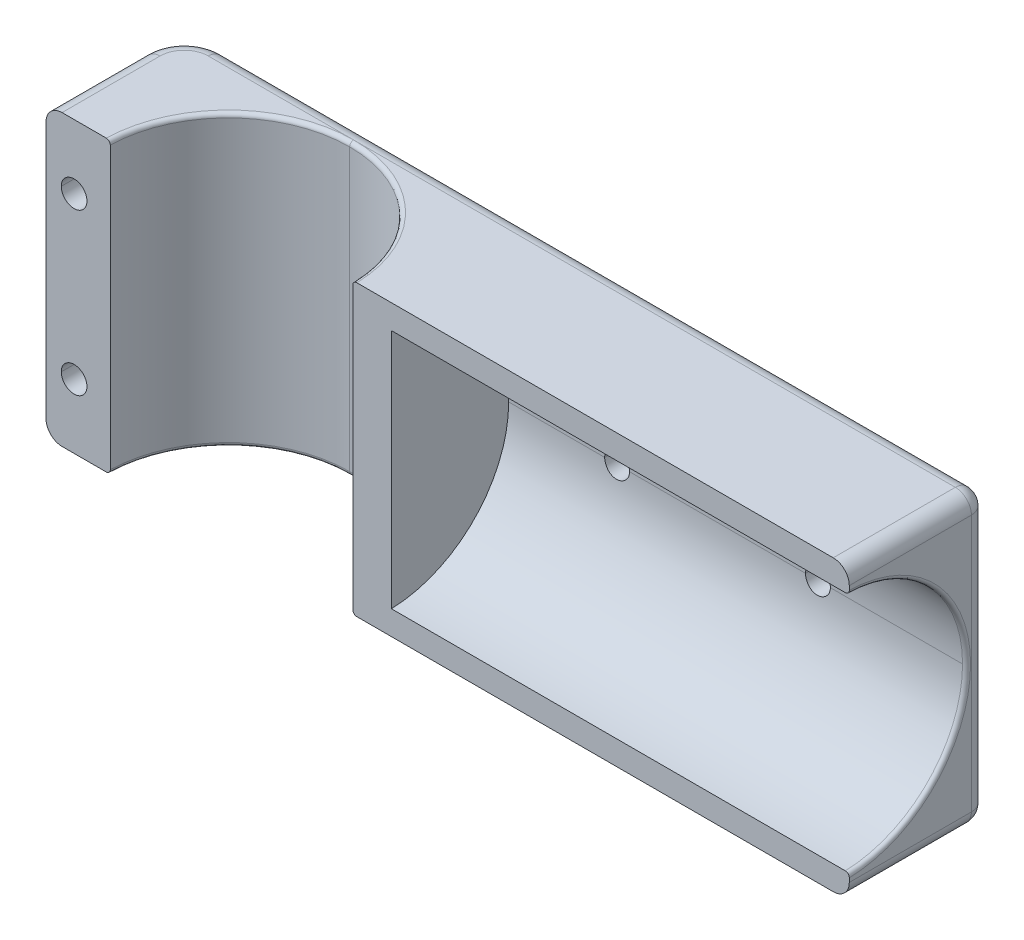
ISO-10303-21;
HEADER;
FILE_DESCRIPTION(('STEP AP214'),'2;1');
FILE_NAME('part.step','',(''),(''),'','','');
FILE_SCHEMA(('AUTOMOTIVE_DESIGN { 1 0 10303 214 1 1 1 1 }'));
ENDSEC;
DATA;
#1=APPLICATION_CONTEXT('core data for automotive mechanical design processes');
#2=APPLICATION_PROTOCOL_DEFINITION('international standard','automotive_design',2000,#1);
#3=PRODUCT_CONTEXT('',#1,'mechanical');
#4=PRODUCT('Part','Part','',(#3));
#5=PRODUCT_RELATED_PRODUCT_CATEGORY('part','',(#4));
#6=PRODUCT_DEFINITION_FORMATION('','',#4);
#7=PRODUCT_DEFINITION_CONTEXT('part definition',#1,'design');
#8=PRODUCT_DEFINITION('design','',#6,#7);
#9=PRODUCT_DEFINITION_SHAPE('','',#8);
#10=(LENGTH_UNIT() NAMED_UNIT(*) SI_UNIT(.MILLI.,.METRE.));
#11=(NAMED_UNIT(*) PLANE_ANGLE_UNIT() SI_UNIT($,.RADIAN.));
#12=(NAMED_UNIT(*) SI_UNIT($,.STERADIAN.) SOLID_ANGLE_UNIT());
#13=UNCERTAINTY_MEASURE_WITH_UNIT(LENGTH_MEASURE(1.E-05),#10,'distance_accuracy_value','');
#14=(GEOMETRIC_REPRESENTATION_CONTEXT(3) GLOBAL_UNCERTAINTY_ASSIGNED_CONTEXT((#13)) GLOBAL_UNIT_ASSIGNED_CONTEXT((#10,
#11,#12)) REPRESENTATION_CONTEXT('',''));
#15=CARTESIAN_POINT('',(0.,0.,0.));
#16=DIRECTION('',(0.,0.,1.));
#17=DIRECTION('',(1.,0.,0.));
#18=AXIS2_PLACEMENT_3D('',#15,#16,#17);
#19=CARTESIAN_POINT('',(-19.6,8.,-9.6));
#20=DIRECTION('',(0.,0.,-1.));
#21=DIRECTION('',(0.,-1.,0.));
#22=AXIS2_PLACEMENT_3D('',#19,#20,#21);
#23=PLANE('',#22);
#24=CARTESIAN_POINT('',(-19.6,8.,-9.6));
#25=DIRECTION('',(0.,0.,1.));
#26=DIRECTION('',(-1.,0.,0.));
#27=AXIS2_PLACEMENT_3D('',#24,#25,#26);
#28=CIRCLE('',#27,1.6);
#29=CARTESIAN_POINT('',(-18.,8.,-9.6));
#30=VERTEX_POINT('',#29);
#31=CARTESIAN_POINT('',(-21.2,8.,-9.6));
#32=VERTEX_POINT('',#31);
#33=EDGE_CURVE('E504',#30,#32,#28,.T.);
#34=ORIENTED_EDGE('',*,*,#33,.T.);
#35=CARTESIAN_POINT('',(-19.6,8.,-9.6));
#36=DIRECTION('',(0.,0.,1.));
#37=DIRECTION('',(-1.,0.,0.));
#38=AXIS2_PLACEMENT_3D('',#35,#36,#37);
#39=CIRCLE('',#38,1.6);
#40=EDGE_CURVE('E349',#32,#30,#39,.T.);
#41=ORIENTED_EDGE('',*,*,#40,.T.);
#42=EDGE_LOOP('',(#34,#41));
#43=FACE_BOUND('',#42,.T.);
#44=CARTESIAN_POINT('',(-19.6,8.,-9.6));
#45=DIRECTION('',(0.,0.,-1.));
#46=DIRECTION('',(-1.,0.,0.));
#47=AXIS2_PLACEMENT_3D('',#44,#45,#46);
#48=CIRCLE('',#47,2.8);
#49=CARTESIAN_POINT('',(-22.4,8.,-9.6));
#50=VERTEX_POINT('',#49);
#51=CARTESIAN_POINT('',(-16.8,8.,-9.6));
#52=VERTEX_POINT('',#51);
#53=EDGE_CURVE('E10',#50,#52,#48,.T.);
#54=ORIENTED_EDGE('',*,*,#53,.T.);
#55=CARTESIAN_POINT('',(-19.6,8.,-9.6));
#56=DIRECTION('',(0.,0.,-1.));
#57=DIRECTION('',(-1.,0.,0.));
#58=AXIS2_PLACEMENT_3D('',#55,#56,#57);
#59=CIRCLE('',#58,2.8);
#60=EDGE_CURVE('E325',#52,#50,#59,.T.);
#61=ORIENTED_EDGE('',*,*,#60,.T.);
#62=EDGE_LOOP('',(#54,#61));
#63=FACE_BOUND('',#62,.T.);
#64=ADVANCED_FACE('F16',(#43,#63),#23,.T.);
#65=CARTESIAN_POINT('',(-19.6,8.,-9.6));
#66=DIRECTION('',(0.,0.,-1.));
#67=DIRECTION('',(-1.,0.,0.));
#68=AXIS2_PLACEMENT_3D('',#65,#66,#67);
#69=CYLINDRICAL_SURFACE('',#68,2.8);
#70=DIRECTION('',(0.,0.,-1.));
#71=VECTOR('',#70,1.);
#72=CARTESIAN_POINT('',(-16.8,8.,-9.6));
#73=LINE('',#72,#71);
#74=CARTESIAN_POINT('',(-16.8,8.,-17.6));
#75=VERTEX_POINT('',#74);
#76=EDGE_CURVE('E330',#52,#75,#73,.T.);
#77=ORIENTED_EDGE('',*,*,#76,.F.);
#78=ORIENTED_EDGE('',*,*,#53,.F.);
#79=DIRECTION('',(0.,0.,-1.));
#80=VECTOR('',#79,1.);
#81=CARTESIAN_POINT('',(-22.4,8.,-9.6));
#82=LINE('',#81,#80);
#83=CARTESIAN_POINT('',(-22.4,8.,-15.1514701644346));
#84=VERTEX_POINT('',#83);
#85=EDGE_CURVE('E342',#50,#84,#82,.T.);
#86=ORIENTED_EDGE('',*,*,#85,.T.);
#87=CARTESIAN_POINT('',(-18.1,10.3643180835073,-17.6));
#88=CARTESIAN_POINT('',(-18.129058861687,10.3827554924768,-17.6000003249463));
#89=CARTESIAN_POINT('',(-18.1584542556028,10.400664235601,-17.5997466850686));
#90=CARTESIAN_POINT('',(-18.217749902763,10.4353158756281,-17.5987008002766));
#91=CARTESIAN_POINT('',(-18.2476475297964,10.4520633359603,-17.5979108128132));
#92=CARTESIAN_POINT('',(-18.307937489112,10.4843927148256,-17.5957651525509));
#93=CARTESIAN_POINT('',(-18.3383281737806,10.4999778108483,-17.5944110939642));
#94=CARTESIAN_POINT('',(-18.3995915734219,10.5299841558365,-17.5911105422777));
#95=CARTESIAN_POINT('',(-18.4304635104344,10.5444070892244,-17.5891649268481));
#96=CARTESIAN_POINT('',(-18.4926762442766,10.572090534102,-17.5846542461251));
#97=CARTESIAN_POINT('',(-18.5240169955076,10.585351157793,-17.5820892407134));
#98=CARTESIAN_POINT('',(-18.5871530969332,10.6107116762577,-17.576312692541));
#99=CARTESIAN_POINT('',(-18.6189489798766,10.6228100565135,-17.5731003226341));
#100=CARTESIAN_POINT('',(-18.6829802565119,10.6458474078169,-17.5660018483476));
#101=CARTESIAN_POINT('',(-18.7152165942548,10.6567832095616,-17.5621139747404));
#102=CARTESIAN_POINT('',(-18.780112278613,10.6774982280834,-17.5536372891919));
#103=CARTESIAN_POINT('',(-18.8127728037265,10.6872726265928,-17.5490457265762));
#104=CARTESIAN_POINT('',(-18.877834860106,10.7054757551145,-17.5392346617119));
#105=CARTESIAN_POINT('',(-18.910232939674,10.7139224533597,-17.534025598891));
#106=CARTESIAN_POINT('',(-18.9752156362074,10.7296320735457,-17.5229142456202));
#107=CARTESIAN_POINT('',(-19.0078003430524,10.7368943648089,-17.517011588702));
#108=CARTESIAN_POINT('',(-19.0731396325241,10.7502378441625,-17.5044987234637));
#109=CARTESIAN_POINT('',(-19.1058944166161,10.7563168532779,-17.4978872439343));
#110=CARTESIAN_POINT('',(-19.1715571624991,10.7672950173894,-17.4839425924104));
#111=CARTESIAN_POINT('',(-19.2044652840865,10.7721904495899,-17.4766072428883));
#112=CARTESIAN_POINT('',(-19.270417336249,10.7808030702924,-17.4612009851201));
#113=CARTESIAN_POINT('',(-19.303461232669,10.7845150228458,-17.4531270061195));
#114=CARTESIAN_POINT('',(-19.3696669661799,10.7907621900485,-17.4362298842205));
#115=CARTESIAN_POINT('',(-19.402828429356,10.7932907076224,-17.4274028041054));
#116=CARTESIAN_POINT('',(-19.4692508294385,10.797172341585,-17.4089861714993));
#117=CARTESIAN_POINT('',(-19.5025109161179,10.7985173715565,-17.3993918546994));
#118=CARTESIAN_POINT('',(-19.5691116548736,10.8000337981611,-17.3794276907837));
#119=CARTESIAN_POINT('',(-19.6024508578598,10.8001958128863,-17.3690523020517));
#120=CARTESIAN_POINT('',(-19.6674585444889,10.79936797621,-17.3480721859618));
#121=CARTESIAN_POINT('',(-19.6991370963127,10.7984274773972,-17.3374966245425));
#122=CARTESIAN_POINT('',(-19.7624080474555,10.7954825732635,-17.3156681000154));
#123=CARTESIAN_POINT('',(-19.7939989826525,10.7934722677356,-17.3044116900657));
#124=CARTESIAN_POINT('',(-19.8570794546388,10.7883891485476,-17.2812186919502));
#125=CARTESIAN_POINT('',(-19.8885669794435,10.7853094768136,-17.2692781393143));
#126=CARTESIAN_POINT('',(-19.9514253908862,10.7780884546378,-17.2447143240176));
#127=CARTESIAN_POINT('',(-19.9827936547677,10.7739393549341,-17.2320866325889));
#128=CARTESIAN_POINT('',(-20.0453980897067,10.7645803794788,-17.2061463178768));
#129=CARTESIAN_POINT('',(-20.0766309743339,10.7593619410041,-17.1928288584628));
#130=CARTESIAN_POINT('',(-20.1389490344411,10.7478650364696,-17.1655070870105));
#131=CARTESIAN_POINT('',(-20.1700302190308,10.7415772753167,-17.1514975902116));
#132=CARTESIAN_POINT('',(-20.2320290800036,10.7279425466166,-17.1227901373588));
#133=CARTESIAN_POINT('',(-20.2629420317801,10.7205856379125,-17.1080867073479));
#134=CARTESIAN_POINT('',(-20.3245884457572,10.704812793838,-17.0779901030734));
#135=CARTESIAN_POINT('',(-20.3553164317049,10.6963863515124,-17.0625912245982));
#136=CARTESIAN_POINT('',(-20.4144844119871,10.6790883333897,-17.032178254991));
#137=CARTESIAN_POINT('',(-20.4429546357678,10.6702699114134,-17.0171926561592));
#138=CARTESIAN_POINT('',(-20.4995786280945,10.6517464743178,-16.9866916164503));
#139=CARTESIAN_POINT('',(-20.5277290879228,10.6420360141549,-16.9711733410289));
#140=CARTESIAN_POINT('',(-20.5837041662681,10.6217285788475,-16.9396144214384));
#141=CARTESIAN_POINT('',(-20.6115249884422,10.611125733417,-16.9235708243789));
#142=CARTESIAN_POINT('',(-20.6668317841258,10.5890340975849,-16.8909687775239));
#143=CARTESIAN_POINT('',(-20.6943134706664,10.5775390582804,-16.8744072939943));
#144=CARTESIAN_POINT('',(-20.7489333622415,10.5536631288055,-16.8407769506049));
#145=CARTESIAN_POINT('',(-20.7760667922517,10.5412756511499,-16.8237050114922));
#146=CARTESIAN_POINT('',(-20.8299806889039,10.5156161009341,-16.7890621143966));
#147=CARTESIAN_POINT('',(-20.8567558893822,10.5023371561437,-16.7714880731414));
#148=CARTESIAN_POINT('',(-20.9369253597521,10.4609717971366,-16.7177702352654));
#149=CARTESIAN_POINT('',(-20.9893751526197,10.4317021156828,-16.6811168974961));
#150=CARTESIAN_POINT('',(-21.0900301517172,10.3713206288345,-16.6079249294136));
#151=CARTESIAN_POINT('',(-21.138318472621,10.340302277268,-16.5714229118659));
#152=CARTESIAN_POINT('',(-21.2326602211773,10.2755535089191,-16.4974411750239));
#153=CARTESIAN_POINT('',(-21.2787039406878,10.2418127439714,-16.459958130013));
#154=CARTESIAN_POINT('',(-21.3685783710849,10.1716221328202,-16.3841605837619));
#155=CARTESIAN_POINT('',(-21.4123945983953,10.1351576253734,-16.3458425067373));
#156=CARTESIAN_POINT('',(-21.4978442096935,10.0595211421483,-16.2685148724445));
#157=CARTESIAN_POINT('',(-21.5394584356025,10.0203306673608,-16.2295022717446));
#158=CARTESIAN_POINT('',(-21.620903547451,9.93890345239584,-16.1505647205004));
#159=CARTESIAN_POINT('',(-21.6606885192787,9.89662441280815,-16.1106360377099));
#160=CARTESIAN_POINT('',(-21.7368472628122,9.81045350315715,-16.0316603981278));
#161=CARTESIAN_POINT('',(-21.7732722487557,9.7666088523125,-15.9926113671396));
#162=CARTESIAN_POINT('',(-21.8428841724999,9.67730774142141,-15.9156391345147));
#163=CARTESIAN_POINT('',(-21.8761171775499,9.63189381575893,-15.8777082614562));
#164=CARTESIAN_POINT('',(-21.9395258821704,9.5394590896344,-15.8031853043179));
#165=CARTESIAN_POINT('',(-21.9697418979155,9.49247548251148,-15.7665815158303));
#166=CARTESIAN_POINT('',(-22.0149037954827,9.41747024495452,-15.7103371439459));
#167=CARTESIAN_POINT('',(-22.0307051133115,9.39022824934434,-15.6903375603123));
#168=CARTESIAN_POINT('',(-22.0611198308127,9.33568708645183,-15.6512501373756));
#169=CARTESIAN_POINT('',(-22.0757530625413,9.30840641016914,-15.6321520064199));
#170=CARTESIAN_POINT('',(-22.1038782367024,9.25378998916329,-15.5949106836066));
#171=CARTESIAN_POINT('',(-22.1173894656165,9.22647232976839,-15.5767555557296));
#172=CARTESIAN_POINT('',(-22.1433153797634,9.1717818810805,-15.5414399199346));
#173=CARTESIAN_POINT('',(-22.1557487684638,9.14442667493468,-15.5242659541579));
#174=CARTESIAN_POINT('',(-22.1795616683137,9.08966172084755,-15.4909489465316));
#175=CARTESIAN_POINT('',(-22.1909592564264,9.06226887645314,-15.474791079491));
#176=CARTESIAN_POINT('',(-22.2127413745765,9.00742966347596,-15.4435387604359));
#177=CARTESIAN_POINT('',(-22.2231432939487,8.97999933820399,-15.4284283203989));
#178=CARTESIAN_POINT('',(-22.2429714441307,8.92508491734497,-15.3993018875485));
#179=CARTESIAN_POINT('',(-22.2524143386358,8.8976158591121,-15.3852689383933));
#180=CARTESIAN_POINT('',(-22.270363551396,8.84262925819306,-15.3583190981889));
#181=CARTESIAN_POINT('',(-22.2788856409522,8.81512545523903,-15.3453846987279));
#182=CARTESIAN_POINT('',(-22.2966157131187,8.75458951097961,-15.318220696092));
#183=CARTESIAN_POINT('',(-22.3056801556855,8.72143683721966,-15.3041641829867));
#184=CARTESIAN_POINT('',(-22.3224550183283,8.65520148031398,-15.2778928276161));
#185=CARTESIAN_POINT('',(-22.330196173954,8.62214268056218,-15.2656375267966));
#186=CARTESIAN_POINT('',(-22.344379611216,8.55609881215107,-15.2429936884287));
#187=CARTESIAN_POINT('',(-22.3508501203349,8.52313361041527,-15.2325653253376));
#188=CARTESIAN_POINT('',(-22.3596621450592,8.47347173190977,-15.2182645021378));
#189=CARTESIAN_POINT('',(-22.3624295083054,8.45703098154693,-15.2137559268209));
#190=CARTESIAN_POINT('',(-22.3676583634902,8.42417197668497,-15.2052095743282));
#191=CARTESIAN_POINT('',(-22.3701228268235,8.40775538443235,-15.2011672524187));
#192=CARTESIAN_POINT('',(-22.3747499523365,8.37494553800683,-15.1935559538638));
#193=CARTESIAN_POINT('',(-22.3769153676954,8.35855367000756,-15.1899826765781));
#194=CARTESIAN_POINT('',(-22.3809482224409,8.32579339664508,-15.1833113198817));
#195=CARTESIAN_POINT('',(-22.3828181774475,8.3094261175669,-15.1802092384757));
#196=CARTESIAN_POINT('',(-22.3862634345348,8.27671532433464,-15.1744818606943));
#197=CARTESIAN_POINT('',(-22.3878409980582,8.2603726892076,-15.1718529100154));
#198=CARTESIAN_POINT('',(-22.3907043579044,8.22771142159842,-15.1670730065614));
#199=CARTESIAN_POINT('',(-22.3919921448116,8.21139344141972,-15.1649187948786));
#200=CARTESIAN_POINT('',(-22.3942783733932,8.17878171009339,-15.1610892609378));
#201=CARTESIAN_POINT('',(-22.3952785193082,8.16248841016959,-15.1594111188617));
#202=CARTESIAN_POINT('',(-22.3969914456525,8.1299262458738,-15.1565342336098));
#203=CARTESIAN_POINT('',(-22.3977056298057,8.11365766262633,-15.155333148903));
#204=CARTESIAN_POINT('',(-22.3988480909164,8.08114506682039,-15.1534107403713));
#205=CARTESIAN_POINT('',(-22.399277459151,8.06490120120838,-15.1526875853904));
#206=CARTESIAN_POINT('',(-22.3998514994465,8.03243828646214,-15.1517204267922));
#207=CARTESIAN_POINT('',(-22.3999969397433,8.01621928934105,-15.1514751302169));
#208=CARTESIAN_POINT('',(-22.4,8.,-15.1514701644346));
#209=B_SPLINE_CURVE_WITH_KNOTS('',3,(#87,#88,#89,#90,#91,#92,#93,#94,#95,#96,#97,#98,#99,#100,
#101,#102,#103,#104,#105,#106,#107,#108,#109,#110,#111,#112,#113,#114,#115,#116,#117,#118,#119,
#120,#121,#122,#123,#124,#125,#126,#127,#128,#129,#130,#131,#132,#133,#134,#135,#136,#137,#138,
#139,#140,#141,#142,#143,#144,#145,#146,#147,#148,#149,#150,#151,#152,#153,#154,#155,#156,#157,
#158,#159,#160,#161,#162,#163,#164,#165,#166,#167,#168,#169,#170,#171,#172,#173,#174,#175,#176,
#177,#178,#179,#180,#181,#182,#183,#184,#185,#186,#187,#188,#189,#190,#191,#192,#193,#194,#195,
#196,#197,#198,#199,#200,#201,#202,#203,#204,#205,#206,#207,#208),.UNSPECIFIED.,.F.,.F.,(4,2,2,
2,2,2,2,2,2,2,2,2,2,2,2,2,2,2,2,2,2,2,2,2,2,2,2,2,2,2,2,2,2,2,2,2,2,2,2,2,2,2,2,2,2,2,2,2,2,2,2,
2,2,2,2,2,2,2,2,2,4),(0.,0.103238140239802,0.206044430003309,0.308558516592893,0.41092124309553,
0.513274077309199,0.6157585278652,0.718515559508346,0.821685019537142,0.923308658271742,
1.024986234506,1.12684931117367,1.22902873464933,1.33165414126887,1.43485348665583,
1.5387526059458,1.64347481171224,1.74368274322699,1.8444491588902,1.94587412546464,
2.04805577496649,2.15109007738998,2.25507064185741,2.36008854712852,2.46623220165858,
2.56629523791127,2.66701578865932,2.76846028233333,2.87069373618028,2.97377967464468,
3.07778006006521,3.28874138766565,3.49269695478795,3.69746802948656,3.9034341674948,
4.11096836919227,4.32225909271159,4.52944959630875,4.73295521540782,4.93321423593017,
5.04511941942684,5.15422417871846,5.26062772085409,5.36443699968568,5.46576718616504,
5.56474210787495,5.66149463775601,5.75616700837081,5.86751304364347,5.97575066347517,
6.08121145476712,6.13301742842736,6.18426583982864,6.23500549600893,6.2852866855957,
6.33516108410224,6.3846816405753,6.43390244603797,6.48287858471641,6.53166596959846,
6.58032116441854),.UNSPECIFIED.);
#210=CARTESIAN_POINT('',(-18.1,10.3643180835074,-17.6));
#211=VERTEX_POINT('',#210);
#212=EDGE_CURVE('E564',#211,#84,#209,.T.);
#213=ORIENTED_EDGE('',*,*,#212,.F.);
#214=CARTESIAN_POINT('',(-19.6,8.,-17.6));
#215=DIRECTION('',(0.,0.,-1.));
#216=DIRECTION('',(-1.,0.,0.));
#217=AXIS2_PLACEMENT_3D('',#214,#215,#216);
#218=CIRCLE('',#217,2.8);
#219=EDGE_CURVE('E333',#211,#75,#218,.T.);
#220=ORIENTED_EDGE('',*,*,#219,.T.);
#221=EDGE_LOOP('',(#77,#78,#86,#213,#220));
#222=FACE_BOUND('',#221,.T.);
#223=ADVANCED_FACE('F331',(#222),#69,.F.);
#224=CARTESIAN_POINT('',(-19.6,28.,-9.6));
#225=DIRECTION('',(0.,0.,-1.));
#226=DIRECTION('',(0.,-1.,0.));
#227=AXIS2_PLACEMENT_3D('',#224,#225,#226);
#228=PLANE('',#227);
#229=CARTESIAN_POINT('',(-19.6,28.,-9.6));
#230=DIRECTION('',(0.,0.,1.));
#231=DIRECTION('',(-1.,0.,0.));
#232=AXIS2_PLACEMENT_3D('',#229,#230,#231);
#233=CIRCLE('',#232,1.6);
#234=CARTESIAN_POINT('',(-18.,28.,-9.6));
#235=VERTEX_POINT('',#234);
#236=CARTESIAN_POINT('',(-21.2,28.,-9.6));
#237=VERTEX_POINT('',#236);
#238=EDGE_CURVE('E420',#235,#237,#233,.T.);
#239=ORIENTED_EDGE('',*,*,#238,.T.);
#240=CARTESIAN_POINT('',(-19.6,28.,-9.6));
#241=DIRECTION('',(0.,0.,1.));
#242=DIRECTION('',(-1.,0.,0.));
#243=AXIS2_PLACEMENT_3D('',#240,#241,#242);
#244=CIRCLE('',#243,1.6);
#245=EDGE_CURVE('E473',#237,#235,#244,.T.);
#246=ORIENTED_EDGE('',*,*,#245,.T.);
#247=EDGE_LOOP('',(#239,#246));
#248=FACE_BOUND('',#247,.T.);
#249=CARTESIAN_POINT('',(-19.6,28.,-9.6));
#250=DIRECTION('',(0.,0.,-1.));
#251=DIRECTION('',(-1.,0.,0.));
#252=AXIS2_PLACEMENT_3D('',#249,#250,#251);
#253=CIRCLE('',#252,2.8);
#254=CARTESIAN_POINT('',(-22.4,28.,-9.6));
#255=VERTEX_POINT('',#254);
#256=CARTESIAN_POINT('',(-16.8,28.,-9.6));
#257=VERTEX_POINT('',#256);
#258=EDGE_CURVE('E25',#255,#257,#253,.T.);
#259=ORIENTED_EDGE('',*,*,#258,.T.);
#260=CARTESIAN_POINT('',(-19.6,28.,-9.6));
#261=DIRECTION('',(0.,0.,-1.));
#262=DIRECTION('',(-1.,0.,0.));
#263=AXIS2_PLACEMENT_3D('',#260,#261,#262);
#264=CIRCLE('',#263,2.8);
#265=EDGE_CURVE('E359',#257,#255,#264,.T.);
#266=ORIENTED_EDGE('',*,*,#265,.T.);
#267=EDGE_LOOP('',(#259,#266));
#268=FACE_BOUND('',#267,.T.);
#269=ADVANCED_FACE('F961',(#248,#268),#228,.T.);
#270=CARTESIAN_POINT('',(-19.6,28.,-9.6));
#271=DIRECTION('',(0.,0.,-1.));
#272=DIRECTION('',(-1.,0.,0.));
#273=AXIS2_PLACEMENT_3D('',#270,#271,#272);
#274=CYLINDRICAL_SURFACE('',#273,2.8);
#275=DIRECTION('',(0.,0.,-1.));
#276=VECTOR('',#275,1.);
#277=CARTESIAN_POINT('',(-16.8,28.,-9.6));
#278=LINE('',#277,#276);
#279=CARTESIAN_POINT('',(-16.8,28.,-17.6));
#280=VERTEX_POINT('',#279);
#281=EDGE_CURVE('E363',#257,#280,#278,.T.);
#282=ORIENTED_EDGE('',*,*,#281,.F.);
#283=ORIENTED_EDGE('',*,*,#258,.F.);
#284=DIRECTION('',(0.,0.,-1.));
#285=VECTOR('',#284,1.);
#286=CARTESIAN_POINT('',(-22.4,28.,-9.6));
#287=LINE('',#286,#285);
#288=CARTESIAN_POINT('',(-22.4,28.,-15.1514701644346));
#289=VERTEX_POINT('',#288);
#290=EDGE_CURVE('E385',#255,#289,#287,.T.);
#291=ORIENTED_EDGE('',*,*,#290,.T.);
#292=CARTESIAN_POINT('',(-18.1,30.3643180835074,-17.6));
#293=CARTESIAN_POINT('',(-18.12905886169,30.3827554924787,-17.6000003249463));
#294=CARTESIAN_POINT('',(-18.1584542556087,30.4006642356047,-17.5997466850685));
#295=CARTESIAN_POINT('',(-18.2177499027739,30.435315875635,-17.5987008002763));
#296=CARTESIAN_POINT('',(-18.2476475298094,30.4520633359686,-17.5979108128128));
#297=CARTESIAN_POINT('',(-18.3079374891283,30.4843927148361,-17.5957651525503));
#298=CARTESIAN_POINT('',(-18.3383281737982,30.4999778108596,-17.5944110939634));
#299=CARTESIAN_POINT('',(-18.3995915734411,30.5299841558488,-17.5911105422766));
#300=CARTESIAN_POINT('',(-18.4304635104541,30.544407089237,-17.5891649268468));
#301=CARTESIAN_POINT('',(-18.4926762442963,30.5720905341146,-17.5846542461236));
#302=CARTESIAN_POINT('',(-18.5240169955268,30.5853511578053,-17.5820892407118));
#303=CARTESIAN_POINT('',(-18.5871530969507,30.610711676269,-17.5763126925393));
#304=CARTESIAN_POINT('',(-18.6189489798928,30.622810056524,-17.5731003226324));
#305=CARTESIAN_POINT('',(-18.6829802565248,30.6458474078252,-17.5660018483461));
#306=CARTESIAN_POINT('',(-18.7152165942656,30.6567832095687,-17.562113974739));
#307=CARTESIAN_POINT('',(-18.7801122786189,30.6774982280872,-17.5536372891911));
#308=CARTESIAN_POINT('',(-18.8127728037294,30.6872726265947,-17.5490457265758));
#309=CARTESIAN_POINT('',(-18.8778348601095,30.7054757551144,-17.5392346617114));
#310=CARTESIAN_POINT('',(-18.9102329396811,30.7139224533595,-17.5340255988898));
#311=CARTESIAN_POINT('',(-18.9752156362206,30.7296320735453,-17.5229142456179));
#312=CARTESIAN_POINT('',(-19.007800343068,30.7368943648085,-17.5170115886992));
#313=CARTESIAN_POINT('',(-19.0731396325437,30.7502378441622,-17.5044987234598));
#314=CARTESIAN_POINT('',(-19.1058944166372,30.7563168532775,-17.49788724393));
#315=CARTESIAN_POINT('',(-19.1715571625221,30.767295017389,-17.4839425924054));
#316=CARTESIAN_POINT('',(-19.20446528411,30.7721904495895,-17.476607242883));
#317=CARTESIAN_POINT('',(-19.2704173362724,30.7808030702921,-17.4612009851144));
#318=CARTESIAN_POINT('',(-19.3034612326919,30.7845150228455,-17.4531270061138));
#319=CARTESIAN_POINT('',(-19.3696669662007,30.7907621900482,-17.436229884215));
#320=CARTESIAN_POINT('',(-19.4028284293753,30.7932907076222,-17.4274028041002));
#321=CARTESIAN_POINT('',(-19.4692508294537,30.7971723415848,-17.408986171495));
#322=CARTESIAN_POINT('',(-19.5025109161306,30.7985173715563,-17.3993918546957));
#323=CARTESIAN_POINT('',(-19.5691116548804,30.8000337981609,-17.3794276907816));
#324=CARTESIAN_POINT('',(-19.6024508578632,30.8001958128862,-17.3690523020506));
#325=CARTESIAN_POINT('',(-19.6674585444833,30.79936797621,-17.3480721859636));
#326=CARTESIAN_POINT('',(-19.6991370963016,30.7984274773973,-17.3374966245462));
#327=CARTESIAN_POINT('',(-19.762408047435,30.7954825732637,-17.3156681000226));
#328=CARTESIAN_POINT('',(-19.7939989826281,30.7934722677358,-17.3044116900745));
#329=CARTESIAN_POINT('',(-19.8570794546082,30.7883891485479,-17.2812186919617));
#330=CARTESIAN_POINT('',(-19.8885669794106,30.7853094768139,-17.2692781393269));
#331=CARTESIAN_POINT('',(-19.9514253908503,30.7780884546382,-17.2447143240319));
#332=CARTESIAN_POINT('',(-19.9827936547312,30.7739393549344,-17.2320866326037));
#333=CARTESIAN_POINT('',(-20.0453980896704,30.7645803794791,-17.2061463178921));
#334=CARTESIAN_POINT('',(-20.0766309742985,30.7593619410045,-17.1928288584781));
#335=CARTESIAN_POINT('',(-20.1389490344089,30.7478650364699,-17.1655070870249));
#336=CARTESIAN_POINT('',(-20.170030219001,30.741577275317,-17.1514975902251));
#337=CARTESIAN_POINT('',(-20.2320290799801,30.7279425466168,-17.1227901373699));
#338=CARTESIAN_POINT('',(-20.2629420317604,30.7205856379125,-17.1080867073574));
#339=CARTESIAN_POINT('',(-20.3245884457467,30.7048127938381,-17.0779901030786));
#340=CARTESIAN_POINT('',(-20.3553164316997,30.6963863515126,-17.0625912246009));
#341=CARTESIAN_POINT('',(-20.4144844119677,30.6790883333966,-17.032178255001));
#342=CARTESIAN_POINT('',(-20.4429546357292,30.6702699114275,-17.0171926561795));
#343=CARTESIAN_POINT('',(-20.4995786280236,30.6517464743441,-16.986691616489));
#344=CARTESIAN_POINT('',(-20.5277290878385,30.642036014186,-16.9711733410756));
#345=CARTESIAN_POINT('',(-20.5837041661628,30.6217285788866,-16.9396144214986));
#346=CARTESIAN_POINT('',(-20.6115249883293,30.611125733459,-16.9235708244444));
#347=CARTESIAN_POINT('',(-20.666831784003,30.5890340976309,-16.8909687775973));
#348=CARTESIAN_POINT('',(-20.6943134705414,30.5775390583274,-16.8744072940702));
#349=CARTESIAN_POINT('',(-20.7489333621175,30.5536631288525,-16.8407769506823));
#350=CARTESIAN_POINT('',(-20.7760667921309,30.5412756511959,-16.8237050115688));
#351=CARTESIAN_POINT('',(-20.8299806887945,30.515616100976,-16.789062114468));
#352=CARTESIAN_POINT('',(-20.8567558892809,30.5023371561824,-16.7714880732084));
#353=CARTESIAN_POINT('',(-20.9369253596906,30.4609717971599,-16.7177702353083));
#354=CARTESIAN_POINT('',(-20.9893751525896,30.4317021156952,-16.681116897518));
#355=CARTESIAN_POINT('',(-21.0900301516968,30.3713206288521,-16.6079249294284));
#356=CARTESIAN_POINT('',(-21.1383184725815,30.3403022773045,-16.5714229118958));
#357=CARTESIAN_POINT('',(-21.2326602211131,30.2755535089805,-16.4974411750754));
#358=CARTESIAN_POINT('',(-21.2787039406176,30.241812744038,-16.4599581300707));
#359=CARTESIAN_POINT('',(-21.368578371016,30.1716221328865,-16.3841605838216));
#360=CARTESIAN_POINT('',(-21.4123945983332,30.1351576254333,-16.3458425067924));
#361=CARTESIAN_POINT('',(-21.4978442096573,30.0595211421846,-16.2685148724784));
#362=CARTESIAN_POINT('',(-21.5394584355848,30.020330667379,-16.2295022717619));
#363=CARTESIAN_POINT('',(-21.620903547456,29.9389034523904,-16.1505647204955));
#364=CARTESIAN_POINT('',(-21.6606885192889,29.8966244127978,-16.1106360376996));
#365=CARTESIAN_POINT('',(-21.7368472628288,29.81045350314,-16.0316603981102));
#366=CARTESIAN_POINT('',(-21.7732722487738,29.7666088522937,-15.9926113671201));
#367=CARTESIAN_POINT('',(-21.8428841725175,29.6773077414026,-15.9156391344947));
#368=CARTESIAN_POINT('',(-21.8761171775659,29.631893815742,-15.8777082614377));
#369=CARTESIAN_POINT('',(-21.9395258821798,29.5394590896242,-15.8031853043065));
#370=CARTESIAN_POINT('',(-21.9697418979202,29.4924754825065,-15.7665815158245));
#371=CARTESIAN_POINT('',(-22.0149037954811,29.4174702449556,-15.7103371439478));
#372=CARTESIAN_POINT('',(-22.0307051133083,29.3902282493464,-15.6903375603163));
#373=CARTESIAN_POINT('',(-22.061119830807,29.3356870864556,-15.6512501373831));
#374=CARTESIAN_POINT('',(-22.0757530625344,29.3084064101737,-15.6321520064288));
#375=CARTESIAN_POINT('',(-22.1038782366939,29.2537899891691,-15.5949106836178));
#376=CARTESIAN_POINT('',(-22.1173894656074,29.2264723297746,-15.5767555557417));
#377=CARTESIAN_POINT('',(-22.1433153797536,29.1717818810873,-15.5414399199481));
#378=CARTESIAN_POINT('',(-22.1557487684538,29.1444266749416,-15.5242659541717));
#379=CARTESIAN_POINT('',(-22.1795616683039,29.0896617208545,-15.4909489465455));
#380=CARTESIAN_POINT('',(-22.1909592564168,29.0622688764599,-15.4747910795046));
#381=CARTESIAN_POINT('',(-22.2127413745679,29.0074296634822,-15.4435387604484));
#382=CARTESIAN_POINT('',(-22.2231432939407,28.9799993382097,-15.4284283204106));
#383=CARTESIAN_POINT('',(-22.2429714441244,28.9250849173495,-15.3993018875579));
#384=CARTESIAN_POINT('',(-22.2524143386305,28.8976158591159,-15.3852689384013));
#385=CARTESIAN_POINT('',(-22.2703635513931,28.8426292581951,-15.3583190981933));
#386=CARTESIAN_POINT('',(-22.2788856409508,28.8151254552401,-15.34538469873));
#387=CARTESIAN_POINT('',(-22.2966157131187,28.754589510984,-15.318220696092));
#388=CARTESIAN_POINT('',(-22.3056801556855,28.7214368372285,-15.3041641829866));
#389=CARTESIAN_POINT('',(-22.3224550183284,28.6552014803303,-15.2778928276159));
#390=CARTESIAN_POINT('',(-22.3301961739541,28.6221426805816,-15.2656375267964));
#391=CARTESIAN_POINT('',(-22.3443796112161,28.5560988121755,-15.2429936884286));
#392=CARTESIAN_POINT('',(-22.350850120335,28.5231336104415,-15.2325653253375));
#393=CARTESIAN_POINT('',(-22.3596621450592,28.4734717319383,-15.2182645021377));
#394=CARTESIAN_POINT('',(-22.3624295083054,28.4570309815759,-15.2137559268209));
#395=CARTESIAN_POINT('',(-22.3676583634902,28.4241719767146,-15.2052095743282));
#396=CARTESIAN_POINT('',(-22.3701228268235,28.4077553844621,-15.2011672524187));
#397=CARTESIAN_POINT('',(-22.3747499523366,28.3749455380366,-15.1935559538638));
#398=CARTESIAN_POINT('',(-22.3769153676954,28.3585536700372,-15.1899826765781));
#399=CARTESIAN_POINT('',(-22.380948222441,28.3257933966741,-15.1833113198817));
#400=CARTESIAN_POINT('',(-22.3828181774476,28.3094261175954,-15.1802092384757));
#401=CARTESIAN_POINT('',(-22.3862634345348,28.2767153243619,-15.1744818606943));
#402=CARTESIAN_POINT('',(-22.3878409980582,28.2603726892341,-15.1718529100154));
#403=CARTESIAN_POINT('',(-22.3907043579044,28.2277114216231,-15.1670730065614));
#404=CARTESIAN_POINT('',(-22.3919921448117,28.2113934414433,-15.1649187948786));
#405=CARTESIAN_POINT('',(-22.3942783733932,28.1787817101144,-15.1610892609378));
#406=CARTESIAN_POINT('',(-22.3952785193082,28.1624884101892,-15.1594111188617));
#407=CARTESIAN_POINT('',(-22.3969914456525,28.1299262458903,-15.1565342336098));
#408=CARTESIAN_POINT('',(-22.3977056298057,28.1136576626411,-15.155333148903));
#409=CARTESIAN_POINT('',(-22.3988480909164,28.0811450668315,-15.1534107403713));
#410=CARTESIAN_POINT('',(-22.399277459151,28.0649012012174,-15.1526875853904));
#411=CARTESIAN_POINT('',(-22.3998514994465,28.0324382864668,-15.1517204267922));
#412=CARTESIAN_POINT('',(-22.3999969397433,28.0162192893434,-15.1514751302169));
#413=CARTESIAN_POINT('',(-22.4,28.,-15.1514701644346));
#414=B_SPLINE_CURVE_WITH_KNOTS('',3,(#292,#293,#294,#295,#296,#297,#298,#299,#300,#301,#302,
#303,#304,#305,#306,#307,#308,#309,#310,#311,#312,#313,#314,#315,#316,#317,#318,#319,#320,#321,
#322,#323,#324,#325,#326,#327,#328,#329,#330,#331,#332,#333,#334,#335,#336,#337,#338,#339,#340,
#341,#342,#343,#344,#345,#346,#347,#348,#349,#350,#351,#352,#353,#354,#355,#356,#357,#358,#359,
#360,#361,#362,#363,#364,#365,#366,#367,#368,#369,#370,#371,#372,#373,#374,#375,#376,#377,#378,
#379,#380,#381,#382,#383,#384,#385,#386,#387,#388,#389,#390,#391,#392,#393,#394,#395,#396,#397,
#398,#399,#400,#401,#402,#403,#404,#405,#406,#407,#408,#409,#410,#411,#412,#413),.UNSPECIFIED.,
.F.,.F.,(4,2,2,2,2,2,2,2,2,2,2,2,2,2,2,2,2,2,2,2,2,2,2,2,2,2,2,2,2,2,2,2,2,2,2,2,2,2,2,2,2,2,2,
2,2,2,2,2,2,2,2,2,2,2,2,2,2,2,2,2,4),(0.,0.103238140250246,0.206044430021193,0.308558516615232,
0.410921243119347,0.513274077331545,0.615758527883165,0.718515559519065,0.821685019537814,
0.923308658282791,1.02498623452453,1.12684931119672,1.22902873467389,1.33165414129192,
1.43485348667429,1.53875260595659,1.64347481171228,1.74368274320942,1.84444915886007,
1.94587412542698,2.04805577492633,2.15109007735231,2.25507064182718,2.36008854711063,
2.46623220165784,2.56629523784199,2.66701578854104,2.76846028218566,2.87069373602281,
2.97377967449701,3.07778005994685,3.2887413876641,3.49269695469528,3.69746802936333,
3.90343416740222,4.11096836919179,4.32225909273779,4.52944959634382,4.73295521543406,
4.93321423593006,5.0451194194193,5.15422417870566,5.2606277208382,5.36443699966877,
5.46576718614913,5.56474210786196,5.66149463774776,5.756167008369,5.86751304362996,
5.97575066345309,6.08121145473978,6.13301742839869,6.18426583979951,6.23500549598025,
6.28528668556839,6.33516108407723,6.38468164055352,6.43390244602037,6.48287858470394,
6.53166596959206,6.58032116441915),.UNSPECIFIED.);
#415=CARTESIAN_POINT('',(-18.1,30.3643180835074,-17.6));
#416=VERTEX_POINT('',#415);
#417=EDGE_CURVE('E414',#416,#289,#414,.T.);
#418=ORIENTED_EDGE('',*,*,#417,.F.);
#419=CARTESIAN_POINT('',(-19.6,28.,-17.6));
#420=DIRECTION('',(0.,0.,-1.));
#421=DIRECTION('',(-1.,0.,0.));
#422=AXIS2_PLACEMENT_3D('',#419,#420,#421);
#423=CIRCLE('',#422,2.8);
#424=EDGE_CURVE('E980',#416,#280,#423,.T.);
#425=ORIENTED_EDGE('',*,*,#424,.T.);
#426=EDGE_LOOP('',(#282,#283,#291,#418,#425));
#427=FACE_BOUND('',#426,.T.);
#428=ADVANCED_FACE('F959',(#427),#274,.F.);
#429=CARTESIAN_POINT('',(33.4,18.,-17.6));
#430=DIRECTION('',(0.,0.,1.));
#431=DIRECTION('',(1.,0.,0.));
#432=AXIS2_PLACEMENT_3D('',#429,#430,#431);
#433=CYLINDRICAL_SURFACE('',#432,1.55);
#434=DIRECTION('',(0.,0.,1.));
#435=VECTOR('',#434,1.);
#436=CARTESIAN_POINT('',(31.85,18.,-17.6));
#437=LINE('',#436,#435);
#438=CARTESIAN_POINT('',(31.85,18.,-17.6));
#439=VERTEX_POINT('',#438);
#440=CARTESIAN_POINT('',(31.85,18.,-15.));
#441=VERTEX_POINT('',#440);
#442=EDGE_CURVE('E384',#439,#441,#437,.T.);
#443=ORIENTED_EDGE('',*,*,#442,.F.);
#444=CARTESIAN_POINT('',(33.4,18.,-17.6));
#445=DIRECTION('',(0.,0.,1.));
#446=DIRECTION('',(1.,0.,0.));
#447=AXIS2_PLACEMENT_3D('',#444,#445,#446);
#448=CIRCLE('',#447,1.55);
#449=CARTESIAN_POINT('',(34.95,18.,-17.6));
#450=VERTEX_POINT('',#449);
#451=EDGE_CURVE('E415',#450,#439,#448,.T.);
#452=ORIENTED_EDGE('',*,*,#451,.F.);
#453=DIRECTION('',(0.,0.,1.));
#454=VECTOR('',#453,1.);
#455=CARTESIAN_POINT('',(34.95,18.,-17.6));
#456=LINE('',#455,#454);
#457=CARTESIAN_POINT('',(34.95,18.,-15.));
#458=VERTEX_POINT('',#457);
#459=EDGE_CURVE('E404',#450,#458,#456,.T.);
#460=ORIENTED_EDGE('',*,*,#459,.T.);
#461=CARTESIAN_POINT('',(31.85,18.,-15.));
#462=CARTESIAN_POINT('',(31.8499992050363,18.0204989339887,-15.0000000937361));
#463=CARTESIAN_POINT('',(31.8503913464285,18.040998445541,-14.9999579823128));
#464=CARTESIAN_POINT('',(31.8519687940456,18.0818421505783,-14.9997905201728));
#465=CARTESIAN_POINT('',(31.8531492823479,18.1021865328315,-14.9996656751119));
#466=CARTESIAN_POINT('',(31.8563032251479,18.1427198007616,-14.9993346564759));
#467=CARTESIAN_POINT('',(31.8582730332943,18.162908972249,-14.999128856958));
#468=CARTESIAN_POINT('',(31.8630041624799,18.2031313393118,-14.9986379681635));
#469=CARTESIAN_POINT('',(31.8657630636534,18.2231648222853,-14.9983531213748));
#470=CARTESIAN_POINT('',(31.8720712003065,18.2630755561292,-14.9977061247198));
#471=CARTESIAN_POINT('',(31.8756192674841,18.2829529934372,-14.9973440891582));
#472=CARTESIAN_POINT('',(31.8835044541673,18.3225514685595,-14.9965446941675));
#473=CARTESIAN_POINT('',(31.8878416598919,18.3422724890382,-14.9961073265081));
#474=CARTESIAN_POINT('',(31.897303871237,18.3815580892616,-14.9951592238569));
#475=CARTESIAN_POINT('',(31.9024301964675,18.4011223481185,-14.9946483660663));
#476=CARTESIAN_POINT('',(31.9134694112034,18.4400944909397,-14.993555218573));
#477=CARTESIAN_POINT('',(31.9193848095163,18.4595016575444,-14.9929727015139));
#478=CARTESIAN_POINT('',(31.9320010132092,18.4981598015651,-14.9917381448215));
#479=CARTESIAN_POINT('',(31.9387054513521,18.5174095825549,-14.9910857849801));
#480=CARTESIAN_POINT('',(31.9528985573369,18.5557531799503,-14.9897134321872));
#481=CARTESIAN_POINT('',(31.9603918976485,18.5748452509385,-14.9889930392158));
#482=CARTESIAN_POINT('',(31.976087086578,18.6126931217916,-14.9874936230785));
#483=CARTESIAN_POINT('',(31.9842876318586,18.6314494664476,-14.9867147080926));
#484=CARTESIAN_POINT('',(32.0013599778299,18.6685149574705,-14.9851069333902));
#485=CARTESIAN_POINT('',(32.0102274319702,18.6868261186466,-14.9842784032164));
#486=CARTESIAN_POINT('',(32.0286324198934,18.7230014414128,-14.9825763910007));
#487=CARTESIAN_POINT('',(32.0381667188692,18.7408672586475,-14.981703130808));
#488=CARTESIAN_POINT('',(32.0579042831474,18.7761522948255,-14.9799165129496));
#489=CARTESIAN_POINT('',(32.0681054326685,18.7935727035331,-14.9790032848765));
#490=CARTESIAN_POINT('',(32.0891755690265,18.8279674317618,-14.9771414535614));
#491=CARTESIAN_POINT('',(32.100043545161,18.8449423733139,-14.9761929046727));
#492=CARTESIAN_POINT('',(32.1224462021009,18.878446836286,-14.9742650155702));
#493=CARTESIAN_POINT('',(32.1339809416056,18.8949763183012,-14.9732856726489));
#494=CARTESIAN_POINT('',(32.1577161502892,18.9275905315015,-14.9713006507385));
#495=CARTESIAN_POINT('',(32.1699176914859,18.9436744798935,-14.9702949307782));
#496=CARTESIAN_POINT('',(32.194985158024,18.9753988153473,-14.9682614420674));
#497=CARTESIAN_POINT('',(32.2078530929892,18.9910376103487,-14.9672336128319));
#498=CARTESIAN_POINT('',(32.2342537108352,19.0218713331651,-14.9651601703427));
#499=CARTESIAN_POINT('',(32.2477892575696,19.0370638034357,-14.9641144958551));
#500=CARTESIAN_POINT('',(32.2755194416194,19.0670105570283,-14.9620090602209));
#501=CARTESIAN_POINT('',(32.2897176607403,19.0817615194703,-14.960949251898));
#502=CARTESIAN_POINT('',(32.3184852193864,19.1105034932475,-14.958843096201));
#503=CARTESIAN_POINT('',(32.3330470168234,19.1245020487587,-14.9577967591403));
#504=CARTESIAN_POINT('',(32.3627210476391,19.1519123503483,-14.9557108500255));
#505=CARTESIAN_POINT('',(32.3778334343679,19.165323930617,-14.9546712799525));
#506=CARTESIAN_POINT('',(32.4086030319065,19.1915661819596,-14.9526032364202));
#507=CARTESIAN_POINT('',(32.4242611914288,19.204395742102,-14.9515747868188));
#508=CARTESIAN_POINT('',(32.4561228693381,19.2294738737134,-14.9495335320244));
#509=CARTESIAN_POINT('',(32.4723280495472,19.2417203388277,-14.9485207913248));
#510=CARTESIAN_POINT('',(32.5052825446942,19.2656340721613,-14.9465151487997));
#511=CARTESIAN_POINT('',(32.5220341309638,19.2772982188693,-14.9455223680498));
#512=CARTESIAN_POINT('',(32.5559632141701,19.2999687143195,-14.9435675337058));
#513=CARTESIAN_POINT('',(32.5731404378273,19.3109754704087,-14.9426054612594));
#514=CARTESIAN_POINT('',(32.6078267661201,19.3322579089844,-14.9407229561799));
#515=CARTESIAN_POINT('',(32.6253337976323,19.3425369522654,-14.9398023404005));
#516=CARTESIAN_POINT('',(32.660678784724,19.3623654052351,-14.938007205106));
#517=CARTESIAN_POINT('',(32.6785153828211,19.3719172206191,-14.9371325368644));
#518=CARTESIAN_POINT('',(32.714518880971,19.39029240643,-14.9354334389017));
#519=CARTESIAN_POINT('',(32.7326850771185,19.3991171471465,-14.9346089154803));
#520=CARTESIAN_POINT('',(32.7693469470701,19.4160399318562,-14.9330138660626));
#521=CARTESIAN_POINT('',(32.7878424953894,19.4241382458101,-14.9322433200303));
#522=CARTESIAN_POINT('',(32.8251431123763,19.4396000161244,-14.9307606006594));
#523=CARTESIAN_POINT('',(32.843948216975,19.446963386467,-14.9300484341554));
#524=CARTESIAN_POINT('',(32.8818430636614,19.4609426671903,-14.9286870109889));
#525=CARTESIAN_POINT('',(32.9009328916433,19.4675583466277,-14.9280377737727));
#526=CARTESIAN_POINT('',(32.9393965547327,19.4800440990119,-14.9268050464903));
#527=CARTESIAN_POINT('',(32.9587708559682,19.4859127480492,-14.9262216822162));
#528=CARTESIAN_POINT('',(32.9978031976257,19.4969056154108,-14.9251232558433));
#529=CARTESIAN_POINT('',(33.0174619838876,19.5020272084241,-14.9246084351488));
#530=CARTESIAN_POINT('',(33.0570628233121,19.5115280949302,-14.9236492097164));
#531=CARTESIAN_POINT('',(33.0770057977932,19.5159035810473,-14.9232051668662));
#532=CARTESIAN_POINT('',(33.1170357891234,19.5238831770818,-14.922392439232));
#533=CARTESIAN_POINT('',(33.1371227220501,19.527487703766,-14.9220237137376));
#534=CARTESIAN_POINT('',(33.1773367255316,19.5338949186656,-14.9213664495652));
#535=CARTESIAN_POINT('',(33.1974632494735,19.5367009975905,-14.9210775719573));
#536=CARTESIAN_POINT('',(33.2377558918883,19.5415129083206,-14.9205812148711));
#537=CARTESIAN_POINT('',(33.257921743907,19.5435209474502,-14.9203735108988));
#538=CARTESIAN_POINT('',(33.2982928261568,19.5467392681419,-14.920040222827));
#539=CARTESIAN_POINT('',(33.3184979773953,19.5479505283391,-14.9199145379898));
#540=CARTESIAN_POINT('',(33.3589474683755,19.5495715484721,-14.9197462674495));
#541=CARTESIAN_POINT('',(33.3791918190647,19.5499810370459,-14.919703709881));
#542=CARTESIAN_POINT('',(33.4198982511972,19.5500189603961,-14.9196997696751));
#543=CARTESIAN_POINT('',(33.440360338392,19.5496389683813,-14.9197392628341));
#544=CARTESIAN_POINT('',(33.481133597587,19.5480894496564,-14.9199001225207));
#545=CARTESIAN_POINT('',(33.5014449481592,19.5469245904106,-14.9200210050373));
#546=CARTESIAN_POINT('',(33.5419164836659,19.5438012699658,-14.9203445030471));
#547=CARTESIAN_POINT('',(33.5620769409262,19.5418463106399,-14.9205467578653));
#548=CARTESIAN_POINT('',(33.6022466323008,19.5371452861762,-14.9210317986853));
#549=CARTESIAN_POINT('',(33.6222561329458,19.5344014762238,-14.9213143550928));
#550=CARTESIAN_POINT('',(33.6621239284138,19.5281235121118,-14.9219586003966));
#551=CARTESIAN_POINT('',(33.681982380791,19.524590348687,-14.9223201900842));
#552=CARTESIAN_POINT('',(33.721548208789,19.5167348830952,-14.9231206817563));
#553=CARTESIAN_POINT('',(33.7412555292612,19.5124123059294,-14.9235596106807));
#554=CARTESIAN_POINT('',(33.7805193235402,19.502979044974,-14.9245126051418));
#555=CARTESIAN_POINT('',(33.8000754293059,19.4978668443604,-14.9250268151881));
#556=CARTESIAN_POINT('',(33.8390371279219,19.4868553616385,-14.9261278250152));
#557=CARTESIAN_POINT('',(33.8584419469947,19.4809533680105,-14.9267148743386));
#558=CARTESIAN_POINT('',(33.8971014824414,19.4683631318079,-14.9279586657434));
#559=CARTESIAN_POINT('',(33.9163549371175,19.4616710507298,-14.928615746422));
#560=CARTESIAN_POINT('',(33.9547122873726,19.4475017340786,-14.9299963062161));
#561=CARTESIAN_POINT('',(33.9738143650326,19.4400196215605,-14.9307201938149));
#562=CARTESIAN_POINT('',(34.011686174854,19.4243456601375,-14.932223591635));
#563=CARTESIAN_POINT('',(34.0304564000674,19.416154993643,-14.9330030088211));
#564=CARTESIAN_POINT('',(34.0675513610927,19.3991006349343,-14.9346104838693));
#565=CARTESIAN_POINT('',(34.0858780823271,19.3902412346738,-14.9354382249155));
#566=CARTESIAN_POINT('',(34.1220863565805,19.3718505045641,-14.9371386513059));
#567=CARTESIAN_POINT('',(34.1399695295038,19.362322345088,-14.9380111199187));
#568=CARTESIAN_POINT('',(34.175291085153,19.342594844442,-14.9397970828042));
#569=CARTESIAN_POINT('',(34.1927306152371,19.3323975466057,-14.9407104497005));
#570=CARTESIAN_POINT('',(34.2271653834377,19.3113326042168,-14.9425740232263));
#571=CARTESIAN_POINT('',(34.2441611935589,19.3004658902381,-14.943524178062));
#572=CARTESIAN_POINT('',(34.2777091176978,19.2780628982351,-14.9454568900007));
#573=CARTESIAN_POINT('',(34.2942611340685,19.2665264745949,-14.9464394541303));
#574=CARTESIAN_POINT('',(34.3269221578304,19.2427848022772,-14.9484322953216));
#575=CARTESIAN_POINT('',(34.3430303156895,19.2305783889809,-14.9494426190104));
#576=CARTESIAN_POINT('',(34.3748043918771,19.205497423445,-14.951486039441));
#577=CARTESIAN_POINT('',(34.390468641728,19.1926207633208,-14.9525192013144));
#578=CARTESIAN_POINT('',(34.4213557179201,19.1661998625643,-14.9546031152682));
#579=CARTESIAN_POINT('',(34.4365760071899,19.1526526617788,-14.9556539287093));
#580=CARTESIAN_POINT('',(34.4665760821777,19.1248913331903,-14.9577676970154));
#581=CARTESIAN_POINT('',(34.4813524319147,19.110673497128,-14.9588306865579));
#582=CARTESIAN_POINT('',(34.5103374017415,19.0816986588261,-14.9609538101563));
#583=CARTESIAN_POINT('',(34.5245465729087,19.0669422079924,-14.9620139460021));
#584=CARTESIAN_POINT('',(34.5522943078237,19.0369789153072,-14.9641203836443));
#585=CARTESIAN_POINT('',(34.5658364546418,19.0217753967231,-14.965166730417));
#586=CARTESIAN_POINT('',(34.592250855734,18.9909188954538,-14.9672414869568));
#587=CARTESIAN_POINT('',(34.6051259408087,18.9752683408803,-14.9682699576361));
#588=CARTESIAN_POINT('',(34.6302069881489,18.9435185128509,-14.9703047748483));
#589=CARTESIAN_POINT('',(34.6424149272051,18.9274208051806,-14.9713111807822));
#590=CARTESIAN_POINT('',(34.6661625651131,18.8947774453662,-14.9732975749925));
#591=CARTESIAN_POINT('',(34.6777032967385,18.8782325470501,-14.9742776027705));
#592=CARTESIAN_POINT('',(34.7001174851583,18.8446955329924,-14.9762068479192));
#593=CARTESIAN_POINT('',(34.7109909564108,18.8277034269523,-14.9771560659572));
#594=CARTESIAN_POINT('',(34.7320716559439,18.7932726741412,-14.9790191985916));
#595=CARTESIAN_POINT('',(34.7422778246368,18.7758333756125,-14.979933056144));
#596=CARTESIAN_POINT('',(34.7620250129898,18.740508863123,-14.9817208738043));
#597=CARTESIAN_POINT('',(34.7715638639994,18.7226224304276,-14.9825947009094));
#598=CARTESIAN_POINT('',(34.7899774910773,18.686404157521,-14.984297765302));
#599=CARTESIAN_POINT('',(34.7988489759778,18.6680706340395,-14.985126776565));
#600=CARTESIAN_POINT('',(34.8159291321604,18.630958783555,-14.9867354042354));
#601=CARTESIAN_POINT('',(34.8241333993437,18.6121784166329,-14.9875146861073));
#602=CARTESIAN_POINT('',(34.8398166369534,18.5743249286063,-14.9890129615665));
#603=CARTESIAN_POINT('',(34.8472959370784,18.5552519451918,-14.9897319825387));
#604=CARTESIAN_POINT('',(34.8614623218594,18.5169462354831,-14.9911017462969));
#605=CARTESIAN_POINT('',(34.8681540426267,18.4977152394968,-14.9917528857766));
#606=CARTESIAN_POINT('',(34.8807463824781,18.4590944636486,-14.9929851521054));
#607=CARTESIAN_POINT('',(34.8866505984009,18.439705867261,-14.9935665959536));
#608=CARTESIAN_POINT('',(34.8976689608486,18.4007706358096,-14.9946577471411));
#609=CARTESIAN_POINT('',(34.9027855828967,18.3812247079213,-14.995167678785));
#610=CARTESIAN_POINT('',(34.9122299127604,18.3419755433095,-14.9961140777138));
#611=CARTESIAN_POINT('',(34.9165589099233,18.3222726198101,-14.9965506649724));
#612=CARTESIAN_POINT('',(34.9244291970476,18.2827101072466,-14.9973486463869));
#613=CARTESIAN_POINT('',(34.9279705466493,18.2628505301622,-14.9977100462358));
#614=CARTESIAN_POINT('',(34.9342667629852,18.2229752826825,-14.9983559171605));
#615=CARTESIAN_POINT('',(34.93702043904,18.2029594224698,-14.9986402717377));
#616=CARTESIAN_POINT('',(34.9417426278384,18.1627720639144,-14.9991303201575));
#617=CARTESIAN_POINT('',(34.9437087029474,18.1426002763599,-14.9993357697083));
#618=CARTESIAN_POINT('',(34.9468566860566,18.1021015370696,-14.9996662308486));
#619=CARTESIAN_POINT('',(34.9480349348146,18.0817742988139,-14.9997908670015));
#620=CARTESIAN_POINT('',(34.9496094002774,18.0409646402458,-14.9999580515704));
#621=CARTESIAN_POINT('',(34.9500007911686,18.0204820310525,-15.0000000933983));
#622=CARTESIAN_POINT('',(34.95,18.,-15.));
#623=B_SPLINE_CURVE_WITH_KNOTS('',3,(#461,#462,#463,#464,#465,#466,#467,#468,#469,#470,#471,
#472,#473,#474,#475,#476,#477,#478,#479,#480,#481,#482,#483,#484,#485,#486,#487,#488,#489,#490,
#491,#492,#493,#494,#495,#496,#497,#498,#499,#500,#501,#502,#503,#504,#505,#506,#507,#508,#509,
#510,#511,#512,#513,#514,#515,#516,#517,#518,#519,#520,#521,#522,#523,#524,#525,#526,#527,#528,
#529,#530,#531,#532,#533,#534,#535,#536,#537,#538,#539,#540,#541,#542,#543,#544,#545,#546,#547,
#548,#549,#550,#551,#552,#553,#554,#555,#556,#557,#558,#559,#560,#561,#562,#563,#564,#565,#566,
#567,#568,#569,#570,#571,#572,#573,#574,#575,#576,#577,#578,#579,#580,#581,#582,#583,#584,#585,
#586,#587,#588,#589,#590,#591,#592,#593,#594,#595,#596,#597,#598,#599,#600,#601,#602,#603,#604,
#605,#606,#607,#608,#609,#610,#611,#612,#613,#614,#615,#616,#617,#618,#619,#620,#621,#622),
.UNSPECIFIED.,.F.,.F.,(4,2,2,2,2,2,2,2,2,2,2,2,2,2,2,2,2,2,2,2,2,2,2,2,2,2,2,2,2,2,2,2,2,2,2,2,
2,2,2,2,2,2,2,2,2,2,2,2,2,2,2,2,2,2,2,2,2,2,2,2,2,2,2,2,2,2,2,2,2,2,2,2,2,2,2,2,2,2,2,2,4),(0.,
0.0614938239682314,0.122615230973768,0.183457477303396,0.244115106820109,0.30468352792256,
0.365258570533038,0.425936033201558,0.486811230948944,0.547978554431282,0.609531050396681,
0.670972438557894,0.732043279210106,0.792836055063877,0.853444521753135,0.913963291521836,
0.97448739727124,1.03511184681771,1.09593117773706,1.1570390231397,1.21852769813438,
1.27919081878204,1.33987096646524,1.4006624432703,1.4616590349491,1.52295358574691,
1.58420975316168,1.64516155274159,1.70590206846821,1.76652535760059,1.82712602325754,
1.88773377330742,1.94836019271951,2.00910049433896,2.07004935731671,2.13130049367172,
2.19251843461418,2.25347238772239,2.31425655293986,2.37496592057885,2.43569583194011,
2.49707729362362,2.55809691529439,2.6188490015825,2.67942910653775,2.73993359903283,
2.80045920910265,2.86110256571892,2.92195973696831,2.98312578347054,3.04469433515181,
3.10616205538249,3.16726424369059,3.22809413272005,3.28874621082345,3.34931579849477,
3.40989860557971,3.47059027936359,3.5314859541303,3.59267981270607,3.65426466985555,
3.71578815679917,3.77693373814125,3.83779402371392,3.8984629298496,3.95903526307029,
4.01960628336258,4.08027125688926,4.14112500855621,4.20226148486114,4.26377333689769,
4.32525708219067,4.38635858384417,4.44717068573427,4.50778756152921,4.56830429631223,
4.62881644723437,4.68941959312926,4.75020888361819,4.81127859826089,4.87272172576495),.UNSPECIFIED.);
#624=EDGE_CURVE('E945',#441,#458,#623,.T.);
#625=ORIENTED_EDGE('',*,*,#624,.F.);
#626=EDGE_LOOP('',(#443,#452,#460,#625));
#627=FACE_BOUND('',#626,.T.);
#628=ADVANCED_FACE('F950',(#627),#433,.F.);
#629=CARTESIAN_POINT('',(58.4,18.,-17.6));
#630=DIRECTION('',(0.,0.,1.));
#631=DIRECTION('',(1.,0.,0.));
#632=AXIS2_PLACEMENT_3D('',#629,#630,#631);
#633=CYLINDRICAL_SURFACE('',#632,1.55);
#634=DIRECTION('',(0.,0.,1.));
#635=VECTOR('',#634,1.);
#636=CARTESIAN_POINT('',(56.85,18.,-17.6));
#637=LINE('',#636,#635);
#638=CARTESIAN_POINT('',(56.85,18.,-17.6));
#639=VERTEX_POINT('',#638);
#640=CARTESIAN_POINT('',(56.85,18.,-15.));
#641=VERTEX_POINT('',#640);
#642=EDGE_CURVE('E403',#639,#641,#637,.T.);
#643=ORIENTED_EDGE('',*,*,#642,.F.);
#644=CARTESIAN_POINT('',(58.4,18.,-17.6));
#645=DIRECTION('',(0.,0.,1.));
#646=DIRECTION('',(1.,0.,0.));
#647=AXIS2_PLACEMENT_3D('',#644,#645,#646);
#648=CIRCLE('',#647,1.55);
#649=CARTESIAN_POINT('',(59.95,18.,-17.6));
#650=VERTEX_POINT('',#649);
#651=EDGE_CURVE('E411',#650,#639,#648,.T.);
#652=ORIENTED_EDGE('',*,*,#651,.F.);
#653=DIRECTION('',(0.,0.,1.));
#654=VECTOR('',#653,1.);
#655=CARTESIAN_POINT('',(59.95,18.,-17.6));
#656=LINE('',#655,#654);
#657=CARTESIAN_POINT('',(59.95,18.,-15.));
#658=VERTEX_POINT('',#657);
#659=EDGE_CURVE('E793',#650,#658,#656,.T.);
#660=ORIENTED_EDGE('',*,*,#659,.T.);
#661=CARTESIAN_POINT('',(56.85,18.,-15.));
#662=CARTESIAN_POINT('',(56.8499992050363,18.020498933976,-15.0000000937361));
#663=CARTESIAN_POINT('',(56.8503913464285,18.0409984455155,-14.9999579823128));
#664=CARTESIAN_POINT('',(56.8519687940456,18.0818421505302,-14.9997905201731));
#665=CARTESIAN_POINT('',(56.853149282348,18.1021865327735,-14.9996656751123));
#666=CARTESIAN_POINT('',(56.856303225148,18.1427198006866,-14.9993346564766));
#667=CARTESIAN_POINT('',(56.8582730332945,18.1629089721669,-14.9991288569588));
#668=CARTESIAN_POINT('',(56.8630041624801,18.2031313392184,-14.9986379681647));
#669=CARTESIAN_POINT('',(56.8657630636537,18.2231648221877,-14.9983531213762));
#670=CARTESIAN_POINT('',(56.8720712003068,18.2630755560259,-14.9977061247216));
#671=CARTESIAN_POINT('',(56.8756192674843,18.2829529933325,-14.9973440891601));
#672=CARTESIAN_POINT('',(56.8835044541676,18.3225514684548,-14.9965446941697));
#673=CARTESIAN_POINT('',(56.8878416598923,18.3422724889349,-14.9961073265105));
#674=CARTESIAN_POINT('',(56.8973038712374,18.3815580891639,-14.9951592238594));
#675=CARTESIAN_POINT('',(56.9024301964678,18.4011223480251,-14.9946483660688));
#676=CARTESIAN_POINT('',(56.9134694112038,18.4400944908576,-14.9935552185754));
#677=CARTESIAN_POINT('',(56.9193848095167,18.4595016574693,-14.9929727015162));
#678=CARTESIAN_POINT('',(56.9320010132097,18.4981598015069,-14.9917381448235));
#679=CARTESIAN_POINT('',(56.9387054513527,18.5174095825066,-14.9910857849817));
#680=CARTESIAN_POINT('',(56.9528985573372,18.5557531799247,-14.9897134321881));
#681=CARTESIAN_POINT('',(56.9603918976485,18.5748452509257,-14.9889930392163));
#682=CARTESIAN_POINT('',(56.9760870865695,18.6126931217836,-14.9874936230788));
#683=CARTESIAN_POINT('',(56.9842876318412,18.6314494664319,-14.9867147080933));
#684=CARTESIAN_POINT('',(57.0013599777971,18.668514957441,-14.9851069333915));
#685=CARTESIAN_POINT('',(57.0102274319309,18.6868261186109,-14.984278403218));
#686=CARTESIAN_POINT('',(57.0286324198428,18.7230014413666,-14.982576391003));
#687=CARTESIAN_POINT('',(57.0381667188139,18.740867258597,-14.9817031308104));
#688=CARTESIAN_POINT('',(57.0579042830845,18.776152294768,-14.9799165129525));
#689=CARTESIAN_POINT('',(57.0681054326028,18.793572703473,-14.9790032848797));
#690=CARTESIAN_POINT('',(57.089175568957,18.8279674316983,-14.977141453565));
#691=CARTESIAN_POINT('',(57.1000435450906,18.8449423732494,-14.9761929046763));
#692=CARTESIAN_POINT('',(57.1224462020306,18.8784468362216,-14.974265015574));
#693=CARTESIAN_POINT('',(57.1339809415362,18.8949763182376,-14.9732856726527));
#694=CARTESIAN_POINT('',(57.1577161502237,18.9275905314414,-14.9713006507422));
#695=CARTESIAN_POINT('',(57.1699176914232,18.943674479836,-14.9702949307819));
#696=CARTESIAN_POINT('',(57.1949851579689,18.9753988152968,-14.9682614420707));
#697=CARTESIAN_POINT('',(57.2078530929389,18.9910376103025,-14.967233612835));
#698=CARTESIAN_POINT('',(57.2342537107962,19.0218713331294,-14.9651601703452));
#699=CARTESIAN_POINT('',(57.2477892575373,19.0370638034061,-14.9641144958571));
#700=CARTESIAN_POINT('',(57.2755194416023,19.0670105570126,-14.962009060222));
#701=CARTESIAN_POINT('',(57.2897176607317,19.0817615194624,-14.9609492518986));
#702=CARTESIAN_POINT('',(57.3184852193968,19.1105034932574,-14.9588430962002));
#703=CARTESIAN_POINT('',(57.3330470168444,19.1245020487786,-14.9577967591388));
#704=CARTESIAN_POINT('',(57.3627210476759,19.151912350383,-14.9557108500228));
#705=CARTESIAN_POINT('',(57.3778334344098,19.1653239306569,-14.9546712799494));
#706=CARTESIAN_POINT('',(57.4086030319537,19.1915661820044,-14.9526032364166));
#707=CARTESIAN_POINT('',(57.424261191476,19.2043957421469,-14.9515747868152));
#708=CARTESIAN_POINT('',(57.4561228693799,19.2294738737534,-14.9495335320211));
#709=CARTESIAN_POINT('',(57.4723280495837,19.241720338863,-14.9485207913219));
#710=CARTESIAN_POINT('',(57.5052825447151,19.2656340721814,-14.946515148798));
#711=CARTESIAN_POINT('',(57.5220341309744,19.2772982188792,-14.9455223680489));
#712=CARTESIAN_POINT('',(57.555963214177,19.2999687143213,-14.9435675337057));
#713=CARTESIAN_POINT('',(57.5731404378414,19.3109754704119,-14.9426054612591));
#714=CARTESIAN_POINT('',(57.6078267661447,19.3322579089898,-14.9407229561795));
#715=CARTESIAN_POINT('',(57.6253337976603,19.3425369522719,-14.9398023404));
#716=CARTESIAN_POINT('',(57.6606787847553,19.3623654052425,-14.9380072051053));
#717=CARTESIAN_POINT('',(57.6785153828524,19.3719172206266,-14.9371325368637));
#718=CARTESIAN_POINT('',(57.7145188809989,19.3902924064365,-14.9354334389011));
#719=CARTESIAN_POINT('',(57.7326850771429,19.3991171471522,-14.9346089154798));
#720=CARTESIAN_POINT('',(57.769346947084,19.4160399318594,-14.9330138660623));
#721=CARTESIAN_POINT('',(57.7878424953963,19.4241382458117,-14.9322433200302));
#722=CARTESIAN_POINT('',(57.8251431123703,19.4396000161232,-14.9307606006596));
#723=CARTESIAN_POINT('',(57.8439482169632,19.4469633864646,-14.9300484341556));
#724=CARTESIAN_POINT('',(57.8818430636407,19.460942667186,-14.9286870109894));
#725=CARTESIAN_POINT('',(57.9009328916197,19.4675583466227,-14.9280377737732));
#726=CARTESIAN_POINT('',(57.9393965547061,19.4800440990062,-14.9268050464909));
#727=CARTESIAN_POINT('',(57.9587708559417,19.4859127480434,-14.9262216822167));
#728=CARTESIAN_POINT('',(57.9978031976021,19.4969056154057,-14.9251232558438));
#729=CARTESIAN_POINT('',(58.0174619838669,19.5020272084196,-14.9246084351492));
#730=CARTESIAN_POINT('',(58.0570628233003,19.5115280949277,-14.9236492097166));
#731=CARTESIAN_POINT('',(58.0770057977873,19.5159035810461,-14.9232051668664));
#732=CARTESIAN_POINT('',(58.1170357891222,19.5238831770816,-14.922392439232));
#733=CARTESIAN_POINT('',(58.1371227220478,19.5274877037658,-14.9220237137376));
#734=CARTESIAN_POINT('',(58.1773367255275,19.5338949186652,-14.9213664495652));
#735=CARTESIAN_POINT('',(58.1974632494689,19.5367009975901,-14.9210775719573));
#736=CARTESIAN_POINT('',(58.2377558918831,19.5415129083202,-14.9205812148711));
#737=CARTESIAN_POINT('',(58.2579217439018,19.5435209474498,-14.9203735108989));
#738=CARTESIAN_POINT('',(58.2982928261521,19.5467392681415,-14.920040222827));
#739=CARTESIAN_POINT('',(58.3184979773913,19.5479505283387,-14.9199145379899));
#740=CARTESIAN_POINT('',(58.3589474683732,19.5495715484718,-14.9197462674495));
#741=CARTESIAN_POINT('',(58.3791918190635,19.5499810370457,-14.919703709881));
#742=CARTESIAN_POINT('',(58.4198982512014,19.5500189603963,-14.9196997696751));
#743=CARTESIAN_POINT('',(58.4403603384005,19.5496389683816,-14.9197392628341));
#744=CARTESIAN_POINT('',(58.4811335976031,19.5480894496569,-14.9199001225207));
#745=CARTESIAN_POINT('',(58.5014449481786,19.5469245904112,-14.9200210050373));
#746=CARTESIAN_POINT('',(58.5419164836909,19.5438012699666,-14.9203445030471));
#747=CARTESIAN_POINT('',(58.5620769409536,19.5418463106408,-14.9205467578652));
#748=CARTESIAN_POINT('',(58.602246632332,19.5371452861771,-14.9210317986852));
#749=CARTESIAN_POINT('',(58.6222561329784,19.5344014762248,-14.9213143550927));
#750=CARTESIAN_POINT('',(58.6621239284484,19.5281235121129,-14.9219586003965));
#751=CARTESIAN_POINT('',(58.681982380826,19.5245903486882,-14.922320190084));
#752=CARTESIAN_POINT('',(58.721548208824,19.5167348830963,-14.9231206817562));
#753=CARTESIAN_POINT('',(58.7412555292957,19.5124123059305,-14.9235596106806));
#754=CARTESIAN_POINT('',(58.7805193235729,19.502979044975,-14.9245126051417));
#755=CARTESIAN_POINT('',(58.8000754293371,19.4978668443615,-14.925026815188));
#756=CARTESIAN_POINT('',(58.8390371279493,19.4868553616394,-14.9261278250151));
#757=CARTESIAN_POINT('',(58.8584419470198,19.4809533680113,-14.9267148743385));
#758=CARTESIAN_POINT('',(58.8971014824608,19.4683631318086,-14.9279586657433));
#759=CARTESIAN_POINT('',(58.9163549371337,19.4616710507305,-14.9286157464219));
#760=CARTESIAN_POINT('',(58.9547122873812,19.447501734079,-14.9299963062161));
#761=CARTESIAN_POINT('',(58.9738143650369,19.4400196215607,-14.9307201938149));
#762=CARTESIAN_POINT('',(59.0116861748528,19.4243456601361,-14.9322235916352));
#763=CARTESIAN_POINT('',(59.0304564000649,19.41615499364,-14.9330030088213));
#764=CARTESIAN_POINT('',(59.0675513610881,19.3991006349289,-14.9346104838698));
#765=CARTESIAN_POINT('',(59.0858780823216,19.3902412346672,-14.9354382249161));
#766=CARTESIAN_POINT('',(59.1220863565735,19.3718505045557,-14.9371386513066));
#767=CARTESIAN_POINT('',(59.1399695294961,19.3623223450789,-14.9380111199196));
#768=CARTESIAN_POINT('',(59.1752910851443,19.3425948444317,-14.9397970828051));
#769=CARTESIAN_POINT('',(59.1927306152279,19.3323975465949,-14.9407104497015));
#770=CARTESIAN_POINT('',(59.227165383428,19.3113326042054,-14.9425740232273));
#771=CARTESIAN_POINT('',(59.2441611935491,19.3004658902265,-14.9435241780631));
#772=CARTESIAN_POINT('',(59.277709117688,19.2780628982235,-14.9454568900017));
#773=CARTESIAN_POINT('',(59.2942611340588,19.2665264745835,-14.9464394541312));
#774=CARTESIAN_POINT('',(59.3269221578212,19.2427848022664,-14.9484322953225));
#775=CARTESIAN_POINT('',(59.3430303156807,19.2305783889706,-14.9494426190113));
#776=CARTESIAN_POINT('',(59.3748043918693,19.2054974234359,-14.9514860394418));
#777=CARTESIAN_POINT('',(59.390468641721,19.1926207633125,-14.9525192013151));
#778=CARTESIAN_POINT('',(59.4213557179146,19.1661998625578,-14.9546031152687));
#779=CARTESIAN_POINT('',(59.4365760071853,19.1526526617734,-14.9556539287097));
#780=CARTESIAN_POINT('',(59.4665760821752,19.1248913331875,-14.9577676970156));
#781=CARTESIAN_POINT('',(59.4813524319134,19.1106734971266,-14.958830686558));
#782=CARTESIAN_POINT('',(59.5103374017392,19.0816986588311,-14.9609538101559));
#783=CARTESIAN_POINT('',(59.5245465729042,19.0669422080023,-14.9620139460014));
#784=CARTESIAN_POINT('',(59.5522943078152,19.0369789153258,-14.964120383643));
#785=CARTESIAN_POINT('',(59.5658364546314,19.0217753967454,-14.9651667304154));
#786=CARTESIAN_POINT('',(59.5922508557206,18.9909188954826,-14.9672414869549));
#787=CARTESIAN_POINT('',(59.605125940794,18.9752683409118,-14.9682699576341));
#788=CARTESIAN_POINT('',(59.6302069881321,18.9435185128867,-14.9703047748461));
#789=CARTESIAN_POINT('',(59.6424149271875,18.9274208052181,-14.9713111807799));
#790=CARTESIAN_POINT('',(59.6661625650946,18.8947774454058,-14.9732975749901));
#791=CARTESIAN_POINT('',(59.6777032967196,18.8782325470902,-14.9742776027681));
#792=CARTESIAN_POINT('',(59.7001174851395,18.8446955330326,-14.9762068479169));
#793=CARTESIAN_POINT('',(59.7109909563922,18.8277034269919,-14.977156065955));
#794=CARTESIAN_POINT('',(59.7320716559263,18.7932726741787,-14.9790191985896));
#795=CARTESIAN_POINT('',(59.7422778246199,18.7758333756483,-14.9799330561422));
#796=CARTESIAN_POINT('',(59.762025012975,18.7405088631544,-14.9817208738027));
#797=CARTESIAN_POINT('',(59.7715638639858,18.7226224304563,-14.982594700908));
#798=CARTESIAN_POINT('',(59.7899774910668,18.6864041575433,-14.984297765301));
#799=CARTESIAN_POINT('',(59.7988489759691,18.668070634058,-14.9851267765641));
#800=CARTESIAN_POINT('',(59.8159291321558,18.6309587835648,-14.986735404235));
#801=CARTESIAN_POINT('',(59.8241333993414,18.6121784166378,-14.9875146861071));
#802=CARTESIAN_POINT('',(59.8398166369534,18.574324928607,-14.9890129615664));
#803=CARTESIAN_POINT('',(59.8472959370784,18.5552519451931,-14.9897319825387));
#804=CARTESIAN_POINT('',(59.8614623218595,18.5169462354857,-14.9911017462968));
#805=CARTESIAN_POINT('',(59.8681540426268,18.4977152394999,-14.9917528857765));
#806=CARTESIAN_POINT('',(59.8807463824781,18.4590944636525,-14.9929851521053));
#807=CARTESIAN_POINT('',(59.8866505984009,18.4397058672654,-14.9935665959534));
#808=CARTESIAN_POINT('',(59.8976689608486,18.4007706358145,-14.994657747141));
#809=CARTESIAN_POINT('',(59.9027855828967,18.3812247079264,-14.9951676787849));
#810=CARTESIAN_POINT('',(59.9122299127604,18.3419755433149,-14.9961140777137));
#811=CARTESIAN_POINT('',(59.9165589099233,18.3222726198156,-14.9965506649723));
#812=CARTESIAN_POINT('',(59.9244291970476,18.2827101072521,-14.9973486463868));
#813=CARTESIAN_POINT('',(59.9279705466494,18.2628505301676,-14.9977100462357));
#814=CARTESIAN_POINT('',(59.9342667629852,18.2229752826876,-14.9983559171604));
#815=CARTESIAN_POINT('',(59.93702043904,18.2029594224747,-14.9986402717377));
#816=CARTESIAN_POINT('',(59.9417426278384,18.1627720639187,-14.9991303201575));
#817=CARTESIAN_POINT('',(59.9437087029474,18.1426002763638,-14.9993357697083));
#818=CARTESIAN_POINT('',(59.9468566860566,18.1021015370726,-14.9996662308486));
#819=CARTESIAN_POINT('',(59.9480349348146,18.0817742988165,-14.9997908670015));
#820=CARTESIAN_POINT('',(59.9496094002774,18.0409646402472,-14.9999580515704));
#821=CARTESIAN_POINT('',(59.9500007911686,18.0204820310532,-15.0000000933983));
#822=CARTESIAN_POINT('',(59.95,18.,-15.));
#823=B_SPLINE_CURVE_WITH_KNOTS('',3,(#661,#662,#663,#664,#665,#666,#667,#668,#669,#670,#671,
#672,#673,#674,#675,#676,#677,#678,#679,#680,#681,#682,#683,#684,#685,#686,#687,#688,#689,#690,
#691,#692,#693,#694,#695,#696,#697,#698,#699,#700,#701,#702,#703,#704,#705,#706,#707,#708,#709,
#710,#711,#712,#713,#714,#715,#716,#717,#718,#719,#720,#721,#722,#723,#724,#725,#726,#727,#728,
#729,#730,#731,#732,#733,#734,#735,#736,#737,#738,#739,#740,#741,#742,#743,#744,#745,#746,#747,
#748,#749,#750,#751,#752,#753,#754,#755,#756,#757,#758,#759,#760,#761,#762,#763,#764,#765,#766,
#767,#768,#769,#770,#771,#772,#773,#774,#775,#776,#777,#778,#779,#780,#781,#782,#783,#784,#785,
#786,#787,#788,#789,#790,#791,#792,#793,#794,#795,#796,#797,#798,#799,#800,#801,#802,#803,#804,
#805,#806,#807,#808,#809,#810,#811,#812,#813,#814,#815,#816,#817,#818,#819,#820,#821,#822),
.UNSPECIFIED.,.F.,.F.,(4,2,2,2,2,2,2,2,2,2,2,2,2,2,2,2,2,2,2,2,2,2,2,2,2,2,2,2,2,2,2,2,2,2,2,2,
2,2,2,2,2,2,2,2,2,2,2,2,2,2,2,2,2,2,2,2,2,2,2,2,2,2,2,2,2,2,2,2,2,2,2,2,2,2,2,2,2,2,2,2,4),(0.,
0.0614938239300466,0.122615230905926,0.183457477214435,0.244115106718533,0.304683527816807,
0.365258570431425,0.425936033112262,0.486811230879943,0.547978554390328,0.609531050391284,
0.67097243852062,0.732043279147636,0.792836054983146,0.853444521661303,0.913963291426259,
0.974487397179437,1.03511184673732,1.09593117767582,1.15703902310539,1.21852769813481,
1.27919081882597,1.33987096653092,1.40066244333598,1.46165903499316,1.52295358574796,
1.58420975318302,1.64516155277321,1.70590206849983,1.76652535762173,1.82712602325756,
1.88773377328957,1.94836019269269,2.00910049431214,2.07004935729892,2.13130049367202,
2.19251843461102,2.2534723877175,2.31425655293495,2.37496592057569,2.43569583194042,
2.4970772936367,2.55809691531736,2.61884900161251,2.67942910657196,2.73993359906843,
2.80045920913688,2.86110256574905,2.92195973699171,2.98312578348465,3.04469433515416,
3.10616205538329,3.16726424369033,3.22809413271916,3.28874621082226,3.3493157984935,
3.40989860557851,3.47059027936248,3.53148595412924,3.59267981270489,3.654264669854,
3.71578815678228,3.77693373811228,3.83779402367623,3.89846292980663,3.95903526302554,
4.01960628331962,4.08027125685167,4.14112500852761,4.20226148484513,4.26377333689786,
4.32525708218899,4.38635858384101,4.44717068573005,4.50778756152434,4.56830429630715,
4.62881644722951,4.68941959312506,4.7502088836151,4.81127859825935,4.87272172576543),.UNSPECIFIED.);
#824=EDGE_CURVE('E1011',#641,#658,#823,.T.);
#825=ORIENTED_EDGE('',*,*,#824,.F.);
#826=EDGE_LOOP('',(#643,#652,#660,#825));
#827=FACE_BOUND('',#826,.T.);
#828=ADVANCED_FACE('F914',(#827),#633,.F.);
#829=CARTESIAN_POINT('',(-26.1036230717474,0.,-0.4));
#830=DIRECTION('',(0.,0.,-1.));
#831=DIRECTION('',(0.,-1.,0.));
#832=AXIS2_PLACEMENT_3D('',#829,#830,#831);
#833=PLANE('',#832);
#834=CARTESIAN_POINT('',(-19.6,8.,-0.4));
#835=DIRECTION('',(0.,0.,1.));
#836=DIRECTION('',(1.,0.,0.));
#837=AXIS2_PLACEMENT_3D('',#834,#835,#836);
#838=CIRCLE('',#837,1.6);
#839=CARTESIAN_POINT('',(-18.,8.,-0.4));
#840=VERTEX_POINT('',#839);
#841=CARTESIAN_POINT('',(-21.2,8.,-0.4));
#842=VERTEX_POINT('',#841);
#843=EDGE_CURVE('E423',#840,#842,#838,.T.);
#844=ORIENTED_EDGE('',*,*,#843,.F.);
#845=CARTESIAN_POINT('',(-19.6,8.,-0.4));
#846=DIRECTION('',(0.,0.,1.));
#847=DIRECTION('',(1.,0.,0.));
#848=AXIS2_PLACEMENT_3D('',#845,#846,#847);
#849=CIRCLE('',#848,1.6);
#850=EDGE_CURVE('E493',#842,#840,#849,.T.);
#851=ORIENTED_EDGE('',*,*,#850,.F.);
#852=EDGE_LOOP('',(#844,#851));
#853=FACE_BOUND('',#852,.T.);
#854=CARTESIAN_POINT('',(-19.6,28.,-0.4));
#855=DIRECTION('',(0.,0.,1.));
#856=DIRECTION('',(1.,0.,0.));
#857=AXIS2_PLACEMENT_3D('',#854,#855,#856);
#858=CIRCLE('',#857,1.6);
#859=CARTESIAN_POINT('',(-18.,28.,-0.4));
#860=VERTEX_POINT('',#859);
#861=CARTESIAN_POINT('',(-21.2,28.,-0.4));
#862=VERTEX_POINT('',#861);
#863=EDGE_CURVE('E416',#860,#862,#858,.T.);
#864=ORIENTED_EDGE('',*,*,#863,.F.);
#865=CARTESIAN_POINT('',(-19.6,28.,-0.4));
#866=DIRECTION('',(0.,0.,1.));
#867=DIRECTION('',(1.,0.,0.));
#868=AXIS2_PLACEMENT_3D('',#865,#866,#867);
#869=CIRCLE('',#868,1.6);
#870=EDGE_CURVE('E458',#862,#860,#869,.T.);
#871=ORIENTED_EDGE('',*,*,#870,.F.);
#872=EDGE_LOOP('',(#864,#871));
#873=FACE_BOUND('',#872,.T.);
#874=CARTESIAN_POINT('',(-21.1,2.,-0.4));
#875=DIRECTION('',(0.,0.,1.));
#876=DIRECTION('',(-1.,0.,0.));
#877=AXIS2_PLACEMENT_3D('',#874,#875,#876);
#878=CIRCLE('',#877,2.);
#879=CARTESIAN_POINT('',(-23.1,2.,-0.4));
#880=VERTEX_POINT('',#879);
#881=CARTESIAN_POINT('',(-21.1,0.,-0.4));
#882=VERTEX_POINT('',#881);
#883=EDGE_CURVE('E465',#880,#882,#878,.T.);
#884=ORIENTED_EDGE('',*,*,#883,.T.);
#885=DIRECTION('',(-1.,0.,0.));
#886=VECTOR('',#885,1.);
#887=CARTESIAN_POINT('',(-26.1036230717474,0.,-0.4));
#888=LINE('',#887,#886);
#889=CARTESIAN_POINT('',(-15.5948709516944,0.,-0.4));
#890=VERTEX_POINT('',#889);
#891=EDGE_CURVE('E445',#890,#882,#888,.T.);
#892=ORIENTED_EDGE('',*,*,#891,.F.);
#893=CARTESIAN_POINT('',(-15.5948709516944,0.,-0.4));
#894=CARTESIAN_POINT('',(-15.4975081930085,0.,-0.4));
#895=CARTESIAN_POINT('',(-15.4031393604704,0.0387215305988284,-0.4));
#896=CARTESIAN_POINT('',(-15.3122627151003,0.0760101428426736,-0.4));
#897=CARTESIAN_POINT('',(-15.2410507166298,0.146594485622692,-0.4));
#898=CARTESIAN_POINT('',(-15.1730114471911,0.214034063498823,-0.4));
#899=CARTESIAN_POINT('',(-15.1333171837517,0.308411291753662,-0.4));
#900=CARTESIAN_POINT('',(-15.0947010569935,0.400225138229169,-0.4));
#901=CARTESIAN_POINT('',(-15.0947010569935,0.5,-0.4));
#902=B_SPLINE_CURVE_WITH_KNOTS('',2,(#893,#894,#895,#896,#897,#898,#899,#900,#901),
.UNSPECIFIED.,.F.,.F.,(3,2,2,2,3),(0.,0.25,0.5,0.75,1.),.UNSPECIFIED.);
#903=CARTESIAN_POINT('',(-15.0947010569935,0.5,-0.4));
#904=VERTEX_POINT('',#903);
#905=EDGE_CURVE('E451',#890,#904,#902,.T.);
#906=ORIENTED_EDGE('',*,*,#905,.T.);
#907=DIRECTION('',(0.,1.,0.));
#908=VECTOR('',#907,1.);
#909=CARTESIAN_POINT('',(-15.0947010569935,36.,-0.4));
#910=LINE('',#909,#908);
#911=CARTESIAN_POINT('',(-15.0947010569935,35.5,-0.4));
#912=VERTEX_POINT('',#911);
#913=EDGE_CURVE('E434',#904,#912,#910,.T.);
#914=ORIENTED_EDGE('',*,*,#913,.T.);
#915=CARTESIAN_POINT('',(-15.0947010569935,35.5,-0.4));
#916=CARTESIAN_POINT('',(-15.0947010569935,35.5971006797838,-0.4));
#917=CARTESIAN_POINT('',(-15.133128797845,35.6910682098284,-0.4));
#918=CARTESIAN_POINT('',(-15.1703500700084,35.7820855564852,-0.4));
#919=CARTESIAN_POINT('',(-15.241253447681,35.8536082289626,-0.4));
#920=CARTESIAN_POINT('',(-15.3089526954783,35.9218987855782,-0.4));
#921=CARTESIAN_POINT('',(-15.4038749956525,35.9616297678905,-0.4));
#922=CARTESIAN_POINT('',(-15.4955462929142,36.,-0.4));
#923=CARTESIAN_POINT('',(-15.5948709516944,36.,-0.4));
#924=B_SPLINE_CURVE_WITH_KNOTS('',2,(#915,#916,#917,#918,#919,#920,#921,#922,#923),
.UNSPECIFIED.,.F.,.F.,(3,2,2,2,3),(0.,0.25,0.5,0.75,1.),.UNSPECIFIED.);
#925=CARTESIAN_POINT('',(-15.5948709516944,36.,-0.4));
#926=VERTEX_POINT('',#925);
#927=EDGE_CURVE('E804',#912,#926,#924,.T.);
#928=ORIENTED_EDGE('',*,*,#927,.T.);
#929=DIRECTION('',(-1.,0.,0.));
#930=VECTOR('',#929,1.);
#931=CARTESIAN_POINT('',(-26.1036230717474,36.,-0.4));
#932=LINE('',#931,#930);
#933=CARTESIAN_POINT('',(-21.1,36.,-0.4));
#934=VERTEX_POINT('',#933);
#935=EDGE_CURVE('E379',#926,#934,#932,.T.);
#936=ORIENTED_EDGE('',*,*,#935,.T.);
#937=CARTESIAN_POINT('',(-21.1,34.,-0.4));
#938=DIRECTION('',(0.,0.,1.));
#939=DIRECTION('',(-1.,0.,0.));
#940=AXIS2_PLACEMENT_3D('',#937,#938,#939);
#941=CIRCLE('',#940,2.);
#942=CARTESIAN_POINT('',(-23.1,34.,-0.4));
#943=VERTEX_POINT('',#942);
#944=EDGE_CURVE('E409',#934,#943,#941,.T.);
#945=ORIENTED_EDGE('',*,*,#944,.T.);
#946=DIRECTION('',(0.,1.,0.));
#947=VECTOR('',#946,1.);
#948=CARTESIAN_POINT('',(-23.1,36.,-0.4));
#949=LINE('',#948,#947);
#950=EDGE_CURVE('E435',#880,#943,#949,.T.);
#951=ORIENTED_EDGE('',*,*,#950,.F.);
#952=EDGE_LOOP('',(#884,#892,#906,#914,#928,#936,#945,#951));
#953=FACE_BOUND('',#952,.T.);
#954=ADVANCED_FACE('F619',(#853,#873,#953),#833,.F.);
#955=CARTESIAN_POINT('',(-26.1036230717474,0.,-0.4));
#956=DIRECTION('',(0.,0.,-1.));
#957=DIRECTION('',(0.,-1.,0.));
#958=AXIS2_PLACEMENT_3D('',#955,#956,#957);
#959=PLANE('',#958);
#960=CARTESIAN_POINT('',(15.0947010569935,0.5,-0.4));
#961=CARTESIAN_POINT('',(15.0947010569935,0.402564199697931,-0.4));
#962=CARTESIAN_POINT('',(15.1332263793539,0.308567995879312,-0.4));
#963=CARTESIAN_POINT('',(15.1704015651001,0.217865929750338,-0.4));
#964=CARTESIAN_POINT('',(15.2412335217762,0.146411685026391,-0.4));
#965=CARTESIAN_POINT('',(15.3088217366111,0.0782296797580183,-0.4));
#966=CARTESIAN_POINT('',(15.4036279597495,0.0384837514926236,-0.4));
#967=CARTESIAN_POINT('',(15.495423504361,0.,-0.4));
#968=CARTESIAN_POINT('',(15.5948709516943,0.,-0.4));
#969=B_SPLINE_CURVE_WITH_KNOTS('',2,(#960,#961,#962,#963,#964,#965,#966,#967,#968),
.UNSPECIFIED.,.F.,.F.,(3,2,2,2,3),(0.,0.25,0.5,0.75,1.),.UNSPECIFIED.);
#970=CARTESIAN_POINT('',(15.0947010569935,0.5,-0.4));
#971=VERTEX_POINT('',#970);
#972=CARTESIAN_POINT('',(15.5948709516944,0.,-0.4));
#973=VERTEX_POINT('',#972);
#974=EDGE_CURVE('E1178',#971,#973,#969,.T.);
#975=ORIENTED_EDGE('',*,*,#974,.T.);
#976=DIRECTION('',(-1.,0.,0.));
#977=VECTOR('',#976,1.);
#978=CARTESIAN_POINT('',(-26.1036230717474,0.,-0.4));
#979=LINE('',#978,#977);
#980=CARTESIAN_POINT('',(74.9,0.,-0.4));
#981=VERTEX_POINT('',#980);
#982=EDGE_CURVE('E517',#981,#973,#979,.T.);
#983=ORIENTED_EDGE('',*,*,#982,.F.);
#984=CARTESIAN_POINT('',(74.9,2.,-0.4));
#985=DIRECTION('',(0.,0.,1.));
#986=DIRECTION('',(-1.,0.,0.));
#987=AXIS2_PLACEMENT_3D('',#984,#985,#986);
#988=CIRCLE('',#987,2.);
#989=CARTESIAN_POINT('',(76.9,2.,-0.4));
#990=VERTEX_POINT('',#989);
#991=EDGE_CURVE('E386',#981,#990,#988,.T.);
#992=ORIENTED_EDGE('',*,*,#991,.T.);
#993=DIRECTION('',(0.,-1.,0.));
#994=VECTOR('',#993,1.);
#995=CARTESIAN_POINT('',(76.9,36.,-0.4));
#996=LINE('',#995,#994);
#997=CARTESIAN_POINT('',(76.9,2.50516214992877,-0.4));
#998=VERTEX_POINT('',#997);
#999=EDGE_CURVE('E529',#998,#990,#996,.T.);
#1000=ORIENTED_EDGE('',*,*,#999,.F.);
#1001=CARTESIAN_POINT('',(76.8999999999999,2.50516214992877,-0.4));
#1002=CARTESIAN_POINT('',(76.8999999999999,2.60177066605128,-0.4));
#1003=CARTESIAN_POINT('',(76.8615605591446,2.6959756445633,-0.4));
#1004=CARTESIAN_POINT('',(76.8243362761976,2.78720259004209,-0.4));
#1005=CARTESIAN_POINT('',(76.7539462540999,2.85844264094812,-0.4));
#1006=CARTESIAN_POINT('',(76.6867300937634,2.92647050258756,-0.4));
#1007=CARTESIAN_POINT('',(76.5912225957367,2.96656498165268,-0.4));
#1008=CARTESIAN_POINT('',(76.4988717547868,3.00533428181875,-0.4));
#1009=CARTESIAN_POINT('',(76.3999999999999,3.00533428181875,-0.4));
#1010=B_SPLINE_CURVE_WITH_KNOTS('',2,(#1001,#1002,#1003,#1004,#1005,#1006,#1007,#1008,#1009),
.UNSPECIFIED.,.F.,.F.,(3,2,2,2,3),(0.,0.25,0.5,0.75,1.),.UNSPECIFIED.);
#1011=CARTESIAN_POINT('',(76.4,3.00533428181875,-0.4));
#1012=VERTEX_POINT('',#1011);
#1013=EDGE_CURVE('E39',#998,#1012,#1010,.T.);
#1014=ORIENTED_EDGE('',*,*,#1013,.T.);
#1015=DIRECTION('',(1.,0.,0.));
#1016=VECTOR('',#1015,1.);
#1017=CARTESIAN_POINT('',(19.9,3.00533428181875,-0.4));
#1018=LINE('',#1017,#1016);
#1019=CARTESIAN_POINT('',(19.9,3.00533428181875,-0.4));
#1020=VERTEX_POINT('',#1019);
#1021=EDGE_CURVE('E581',#1020,#1012,#1018,.T.);
#1022=ORIENTED_EDGE('',*,*,#1021,.F.);
#1023=DIRECTION('',(0.,1.,0.));
#1024=VECTOR('',#1023,1.);
#1025=CARTESIAN_POINT('',(19.9,18.,-0.4));
#1026=LINE('',#1025,#1024);
#1027=CARTESIAN_POINT('',(19.9,32.9946657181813,-0.4));
#1028=VERTEX_POINT('',#1027);
#1029=EDGE_CURVE('E51',#1020,#1028,#1026,.T.);
#1030=ORIENTED_EDGE('',*,*,#1029,.T.);
#1031=DIRECTION('',(-1.,0.,0.));
#1032=VECTOR('',#1031,1.);
#1033=CARTESIAN_POINT('',(19.9,32.9946657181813,-0.4));
#1034=LINE('',#1033,#1032);
#1035=CARTESIAN_POINT('',(76.4,32.9946657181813,-0.4));
#1036=VERTEX_POINT('',#1035);
#1037=EDGE_CURVE('E654',#1036,#1028,#1034,.T.);
#1038=ORIENTED_EDGE('',*,*,#1037,.F.);
#1039=CARTESIAN_POINT('',(76.3999999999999,32.9946657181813,-0.4));
#1040=CARTESIAN_POINT('',(76.4974382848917,32.9946657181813,-0.4));
#1041=CARTESIAN_POINT('',(76.5914407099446,33.0331960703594,-0.4));
#1042=CARTESIAN_POINT('',(76.6821411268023,33.0703729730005,-0.4));
#1043=CARTESIAN_POINT('',(76.7535898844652,33.141200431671,-0.4));
#1044=CARTESIAN_POINT('',(76.8217672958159,33.208784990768,-0.4));
#1045=CARTESIAN_POINT('',(76.8615126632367,33.303584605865,-0.4));
#1046=CARTESIAN_POINT('',(76.8999999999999,33.3953835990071,-0.4));
#1047=CARTESIAN_POINT('',(76.8999999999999,33.4948378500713,-0.4));
#1048=B_SPLINE_CURVE_WITH_KNOTS('',2,(#1039,#1040,#1041,#1042,#1043,#1044,#1045,#1046,#1047),
.UNSPECIFIED.,.F.,.F.,(3,2,2,2,3),(0.,0.25,0.5,0.75,1.),.UNSPECIFIED.);
#1049=CARTESIAN_POINT('',(76.9,33.4948378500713,-0.4));
#1050=VERTEX_POINT('',#1049);
#1051=EDGE_CURVE('E648',#1036,#1050,#1048,.T.);
#1052=ORIENTED_EDGE('',*,*,#1051,.T.);
#1053=DIRECTION('',(0.,-1.,0.));
#1054=VECTOR('',#1053,1.);
#1055=CARTESIAN_POINT('',(76.9,36.,-0.4));
#1056=LINE('',#1055,#1054);
#1057=CARTESIAN_POINT('',(76.9,34.,-0.4));
#1058=VERTEX_POINT('',#1057);
#1059=EDGE_CURVE('E368',#1058,#1050,#1056,.T.);
#1060=ORIENTED_EDGE('',*,*,#1059,.F.);
#1061=CARTESIAN_POINT('',(74.9,34.,-0.4));
#1062=DIRECTION('',(0.,0.,1.));
#1063=DIRECTION('',(-1.,0.,0.));
#1064=AXIS2_PLACEMENT_3D('',#1061,#1062,#1063);
#1065=CIRCLE('',#1064,2.);
#1066=CARTESIAN_POINT('',(74.9,36.,-0.4));
#1067=VERTEX_POINT('',#1066);
#1068=EDGE_CURVE('E355',#1058,#1067,#1065,.T.);
#1069=ORIENTED_EDGE('',*,*,#1068,.T.);
#1070=DIRECTION('',(-1.,0.,0.));
#1071=VECTOR('',#1070,1.);
#1072=CARTESIAN_POINT('',(-26.1036230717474,36.,-0.4));
#1073=LINE('',#1072,#1071);
#1074=CARTESIAN_POINT('',(15.5948709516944,36.,-0.4));
#1075=VERTEX_POINT('',#1074);
#1076=EDGE_CURVE('E533',#1067,#1075,#1073,.T.);
#1077=ORIENTED_EDGE('',*,*,#1076,.T.);
#1078=CARTESIAN_POINT('',(15.5948709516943,36.,-0.4));
#1079=CARTESIAN_POINT('',(15.4982472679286,36.,-0.4));
#1080=CARTESIAN_POINT('',(15.4041302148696,35.9616174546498,-0.4));
#1081=CARTESIAN_POINT('',(15.3128925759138,35.9244091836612,-0.4));
#1082=CARTESIAN_POINT('',(15.2415604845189,35.8539147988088,-0.4));
#1083=CARTESIAN_POINT('',(15.1734371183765,35.7865914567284,-0.4));
#1084=CARTESIAN_POINT('',(15.133387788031,35.6911243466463,-0.4));
#1085=CARTESIAN_POINT('',(15.0947010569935,35.5989053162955,-0.4));
#1086=CARTESIAN_POINT('',(15.0947010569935,35.5,-0.4));
#1087=B_SPLINE_CURVE_WITH_KNOTS('',2,(#1078,#1079,#1080,#1081,#1082,#1083,#1084,#1085,#1086),
.UNSPECIFIED.,.F.,.F.,(3,2,2,2,3),(0.,0.25,0.5,0.75,1.),.UNSPECIFIED.);
#1088=CARTESIAN_POINT('',(15.0947010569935,35.5,-0.4));
#1089=VERTEX_POINT('',#1088);
#1090=EDGE_CURVE('E483',#1075,#1089,#1087,.T.);
#1091=ORIENTED_EDGE('',*,*,#1090,.T.);
#1092=DIRECTION('',(0.,-1.,0.));
#1093=VECTOR('',#1092,1.);
#1094=CARTESIAN_POINT('',(15.0947010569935,36.,-0.4));
#1095=LINE('',#1094,#1093);
#1096=EDGE_CURVE('E477',#1089,#971,#1095,.T.);
#1097=ORIENTED_EDGE('',*,*,#1096,.T.);
#1098=EDGE_LOOP('',(#975,#983,#992,#1000,#1014,#1022,#1030,#1038,#1052,#1060,#1069,#1077,#1091,#1097));
#1099=FACE_BOUND('',#1098,.T.);
#1100=ADVANCED_FACE('F608',(#1099),#959,.F.);
#1101=CARTESIAN_POINT('',(74.9,34.,12.6));
#1102=DIRECTION('',(0.,0.,-1.));
#1103=DIRECTION('',(-1.,0.,0.));
#1104=AXIS2_PLACEMENT_3D('',#1101,#1102,#1103);
#1105=CYLINDRICAL_SURFACE('',#1104,2.);
#1106=ORIENTED_EDGE('',*,*,#1068,.F.);
#1107=DIRECTION('',(0.,0.,1.));
#1108=VECTOR('',#1107,1.);
#1109=CARTESIAN_POINT('',(76.9,34.,-17.6));
#1110=LINE('',#1109,#1108);
#1111=CARTESIAN_POINT('',(76.9,34.,-15.6));
#1112=VERTEX_POINT('',#1111);
#1113=EDGE_CURVE('E364',#1112,#1058,#1110,.T.);
#1114=ORIENTED_EDGE('',*,*,#1113,.F.);
#1115=CARTESIAN_POINT('',(74.9,34.,-15.6));
#1116=DIRECTION('',(0.,0.,1.));
#1117=DIRECTION('',(1.,0.,0.));
#1118=AXIS2_PLACEMENT_3D('',#1115,#1116,#1117);
#1119=CIRCLE('',#1118,2.);
#1120=CARTESIAN_POINT('',(74.9,36.,-15.6));
#1121=VERTEX_POINT('',#1120);
#1122=EDGE_CURVE('E358',#1112,#1121,#1119,.T.);
#1123=ORIENTED_EDGE('',*,*,#1122,.T.);
#1124=DIRECTION('',(0.,0.,-1.));
#1125=VECTOR('',#1124,1.);
#1126=CARTESIAN_POINT('',(74.9,36.,12.6));
#1127=LINE('',#1126,#1125);
#1128=EDGE_CURVE('E446',#1067,#1121,#1127,.T.);
#1129=ORIENTED_EDGE('',*,*,#1128,.F.);
#1130=EDGE_LOOP('',(#1106,#1114,#1123,#1129));
#1131=FACE_BOUND('',#1130,.T.);
#1132=ADVANCED_FACE('F618',(#1131),#1105,.T.);
#1133=CARTESIAN_POINT('',(74.9,34.,-15.6));
#1134=DIRECTION('',(0.,1.,0.));
#1135=DIRECTION('',(0.,0.,1.));
#1136=AXIS2_PLACEMENT_3D('',#1133,#1134,#1135);
#1137=SPHERICAL_SURFACE('',#1136,2.);
#1138=CARTESIAN_POINT('',(74.9,34.,-15.6));
#1139=DIRECTION('',(0.,1.,0.));
#1140=DIRECTION('',(0.,0.,1.));
#1141=AXIS2_PLACEMENT_3D('',#1138,#1139,#1140);
#1142=CIRCLE('',#1141,2.);
#1143=CARTESIAN_POINT('',(74.9,34.,-17.6));
#1144=VERTEX_POINT('',#1143);
#1145=EDGE_CURVE('E389',#1112,#1144,#1142,.T.);
#1146=ORIENTED_EDGE('',*,*,#1145,.T.);
#1147=CARTESIAN_POINT('',(74.9,34.,-15.6));
#1148=DIRECTION('',(-1.,0.,0.));
#1149=DIRECTION('',(0.,0.,1.));
#1150=AXIS2_PLACEMENT_3D('',#1147,#1148,#1149);
#1151=CIRCLE('',#1150,2.);
#1152=EDGE_CURVE('E593',#1121,#1144,#1151,.T.);
#1153=ORIENTED_EDGE('',*,*,#1152,.F.);
#1154=ORIENTED_EDGE('',*,*,#1122,.F.);
#1155=EDGE_LOOP('',(#1146,#1153,#1154));
#1156=FACE_BOUND('',#1155,.T.);
#1157=ADVANCED_FACE('F767',(#1156),#1137,.T.);
#1158=CARTESIAN_POINT('',(74.9,2.,-17.6));
#1159=DIRECTION('',(0.,0.,1.));
#1160=DIRECTION('',(1.,0.,0.));
#1161=AXIS2_PLACEMENT_3D('',#1158,#1159,#1160);
#1162=CYLINDRICAL_SURFACE('',#1161,2.);
#1163=ORIENTED_EDGE('',*,*,#991,.F.);
#1164=DIRECTION('',(0.,0.,1.));
#1165=VECTOR('',#1164,1.);
#1166=CARTESIAN_POINT('',(74.9,0.,15.6));
#1167=LINE('',#1166,#1165);
#1168=CARTESIAN_POINT('',(74.9,0.,-15.6));
#1169=VERTEX_POINT('',#1168);
#1170=EDGE_CURVE('E456',#1169,#981,#1167,.T.);
#1171=ORIENTED_EDGE('',*,*,#1170,.F.);
#1172=CARTESIAN_POINT('',(74.9,2.,-15.6));
#1173=DIRECTION('',(0.,0.,1.));
#1174=DIRECTION('',(1.,0.,0.));
#1175=AXIS2_PLACEMENT_3D('',#1172,#1173,#1174);
#1176=CIRCLE('',#1175,2.);
#1177=CARTESIAN_POINT('',(76.9,2.,-15.6));
#1178=VERTEX_POINT('',#1177);
#1179=EDGE_CURVE('E478',#1169,#1178,#1176,.T.);
#1180=ORIENTED_EDGE('',*,*,#1179,.T.);
#1181=DIRECTION('',(0.,0.,-1.));
#1182=VECTOR('',#1181,1.);
#1183=CARTESIAN_POINT('',(76.9,2.,-15.6));
#1184=LINE('',#1183,#1182);
#1185=EDGE_CURVE('E524',#990,#1178,#1184,.T.);
#1186=ORIENTED_EDGE('',*,*,#1185,.F.);
#1187=EDGE_LOOP('',(#1163,#1171,#1180,#1186));
#1188=FACE_BOUND('',#1187,.T.);
#1189=ADVANCED_FACE('F1238',(#1188),#1162,.T.);
#1190=CARTESIAN_POINT('',(74.9,36.,-15.6));
#1191=DIRECTION('',(0.,-1.,0.));
#1192=DIRECTION('',(0.,0.,-1.));
#1193=AXIS2_PLACEMENT_3D('',#1190,#1191,#1192);
#1194=CYLINDRICAL_SURFACE('',#1193,2.);
#1195=CARTESIAN_POINT('',(74.9,2.,-15.6));
#1196=DIRECTION('',(0.,1.,0.));
#1197=DIRECTION('',(0.,0.,1.));
#1198=AXIS2_PLACEMENT_3D('',#1195,#1196,#1197);
#1199=CIRCLE('',#1198,2.);
#1200=CARTESIAN_POINT('',(74.9,2.,-17.6));
#1201=VERTEX_POINT('',#1200);
#1202=EDGE_CURVE('E482',#1178,#1201,#1199,.T.);
#1203=ORIENTED_EDGE('',*,*,#1202,.T.);
#1204=DIRECTION('',(0.,-1.,0.));
#1205=VECTOR('',#1204,1.);
#1206=CARTESIAN_POINT('',(74.9,36.,-17.6));
#1207=LINE('',#1206,#1205);
#1208=EDGE_CURVE('E467',#1144,#1201,#1207,.T.);
#1209=ORIENTED_EDGE('',*,*,#1208,.F.);
#1210=ORIENTED_EDGE('',*,*,#1145,.F.);
#1211=DIRECTION('',(0.,1.,0.));
#1212=VECTOR('',#1211,1.);
#1213=CARTESIAN_POINT('',(76.9,36.,-15.6));
#1214=LINE('',#1213,#1212);
#1215=EDGE_CURVE('E528',#1178,#1112,#1214,.T.);
#1216=ORIENTED_EDGE('',*,*,#1215,.F.);
#1217=EDGE_LOOP('',(#1203,#1209,#1210,#1216));
#1218=FACE_BOUND('',#1217,.T.);
#1219=ADVANCED_FACE('F1232',(#1218),#1194,.T.);
#1220=CARTESIAN_POINT('',(74.9,2.,-15.6));
#1221=DIRECTION('',(0.,1.,0.));
#1222=DIRECTION('',(0.,0.,1.));
#1223=AXIS2_PLACEMENT_3D('',#1220,#1221,#1222);
#1224=SPHERICAL_SURFACE('',#1223,2.);
#1225=ORIENTED_EDGE('',*,*,#1179,.F.);
#1226=CARTESIAN_POINT('',(74.9,2.,-15.6));
#1227=DIRECTION('',(-1.,0.,0.));
#1228=DIRECTION('',(0.,0.,-1.));
#1229=AXIS2_PLACEMENT_3D('',#1226,#1227,#1228);
#1230=CIRCLE('',#1229,2.);
#1231=EDGE_CURVE('E405',#1201,#1169,#1230,.T.);
#1232=ORIENTED_EDGE('',*,*,#1231,.F.);
#1233=ORIENTED_EDGE('',*,*,#1202,.F.);
#1234=EDGE_LOOP('',(#1225,#1232,#1233));
#1235=FACE_BOUND('',#1234,.T.);
#1236=ADVANCED_FACE('F1149',(#1235),#1224,.T.);
#1237=CARTESIAN_POINT('',(0.,35.5,0.));
#1238=DIRECTION('',(0.,-1.,0.));
#1239=DIRECTION('',(0.,0.,-1.));
#1240=AXIS2_PLACEMENT_3D('',#1237,#1238,#1239);
#1241=TOROIDAL_SURFACE('',#1240,15.6,0.5);
#1242=CARTESIAN_POINT('',(0.,35.5,-15.6));
#1243=DIRECTION('',(-1.,0.,0.));
#1244=DIRECTION('',(0.,0.,1.));
#1245=AXIS2_PLACEMENT_3D('',#1242,#1243,#1244);
#1246=CIRCLE('',#1245,0.5);
#1247=CARTESIAN_POINT('',(0.,35.5,-15.1));
#1248=VERTEX_POINT('',#1247);
#1249=CARTESIAN_POINT('',(0.,36.,-15.6));
#1250=VERTEX_POINT('',#1249);
#1251=EDGE_CURVE('E424',#1248,#1250,#1246,.T.);
#1252=ORIENTED_EDGE('',*,*,#1251,.F.);
#1253=CARTESIAN_POINT('',(0.,35.5,0.));
#1254=DIRECTION('',(0.,1.,0.));
#1255=DIRECTION('',(0.,0.,-1.));
#1256=AXIS2_PLACEMENT_3D('',#1253,#1254,#1255);
#1257=CIRCLE('',#1256,15.1);
#1258=EDGE_CURVE('E398',#1089,#1248,#1257,.T.);
#1259=ORIENTED_EDGE('',*,*,#1258,.F.);
#1260=ORIENTED_EDGE('',*,*,#1090,.F.);
#1261=CARTESIAN_POINT('',(0.,36.,0.));
#1262=DIRECTION('',(0.,-1.,0.));
#1263=DIRECTION('',(0.,0.,-1.));
#1264=AXIS2_PLACEMENT_3D('',#1261,#1262,#1263);
#1265=CIRCLE('',#1264,15.6);
#1266=EDGE_CURVE('E523',#1250,#1075,#1265,.T.);
#1267=ORIENTED_EDGE('',*,*,#1266,.F.);
#1268=EDGE_LOOP('',(#1252,#1259,#1260,#1267));
#1269=FACE_BOUND('',#1268,.T.);
#1270=ADVANCED_FACE('F1146',(#1269),#1241,.T.);
#1271=CARTESIAN_POINT('',(0.,0.5,0.));
#1272=DIRECTION('',(0.,-1.,0.));
#1273=DIRECTION('',(0.,0.,-1.));
#1274=AXIS2_PLACEMENT_3D('',#1271,#1272,#1273);
#1275=TOROIDAL_SURFACE('',#1274,15.6,0.5);
#1276=CARTESIAN_POINT('',(0.,0.5,-15.6));
#1277=DIRECTION('',(-1.,0.,0.));
#1278=DIRECTION('',(0.,0.,1.));
#1279=AXIS2_PLACEMENT_3D('',#1276,#1277,#1278);
#1280=CIRCLE('',#1279,0.5);
#1281=CARTESIAN_POINT('',(0.,0.,-15.6));
#1282=VERTEX_POINT('',#1281);
#1283=CARTESIAN_POINT('',(0.,0.5,-15.1));
#1284=VERTEX_POINT('',#1283);
#1285=EDGE_CURVE('E436',#1282,#1284,#1280,.T.);
#1286=ORIENTED_EDGE('',*,*,#1285,.F.);
#1287=CARTESIAN_POINT('',(0.,0.,0.));
#1288=DIRECTION('',(0.,1.,0.));
#1289=DIRECTION('',(0.,0.,-1.));
#1290=AXIS2_PLACEMENT_3D('',#1287,#1288,#1289);
#1291=CIRCLE('',#1290,15.6);
#1292=EDGE_CURVE('E457',#973,#1282,#1291,.T.);
#1293=ORIENTED_EDGE('',*,*,#1292,.F.);
#1294=ORIENTED_EDGE('',*,*,#974,.F.);
#1295=CARTESIAN_POINT('',(0.,0.5,0.));
#1296=DIRECTION('',(0.,-1.,0.));
#1297=DIRECTION('',(0.,0.,-1.));
#1298=AXIS2_PLACEMENT_3D('',#1295,#1296,#1297);
#1299=CIRCLE('',#1298,15.1);
#1300=EDGE_CURVE('E397',#1284,#971,#1299,.T.);
#1301=ORIENTED_EDGE('',*,*,#1300,.F.);
#1302=EDGE_LOOP('',(#1286,#1293,#1294,#1301));
#1303=FACE_BOUND('',#1302,.T.);
#1304=ADVANCED_FACE('F667',(#1303),#1275,.T.);
#1305=CARTESIAN_POINT('',(76.4,18.,0.));
#1306=DIRECTION('',(-1.,0.,0.));
#1307=DIRECTION('',(0.,0.,1.));
#1308=AXIS2_PLACEMENT_3D('',#1305,#1306,#1307);
#1309=TOROIDAL_SURFACE('',#1308,15.5,0.5);
#1310=ORIENTED_EDGE('',*,*,#1013,.F.);
#1311=CARTESIAN_POINT('',(76.9,18.,0.));
#1312=DIRECTION('',(-1.,0.,0.));
#1313=DIRECTION('',(0.,0.,1.));
#1314=AXIS2_PLACEMENT_3D('',#1311,#1312,#1313);
#1315=CIRCLE('',#1314,15.5);
#1316=EDGE_CURVE('E685',#1050,#998,#1315,.T.);
#1317=ORIENTED_EDGE('',*,*,#1316,.F.);
#1318=ORIENTED_EDGE('',*,*,#1051,.F.);
#1319=CARTESIAN_POINT('',(76.4,18.,0.));
#1320=DIRECTION('',(1.,0.,0.));
#1321=DIRECTION('',(0.,0.,1.));
#1322=AXIS2_PLACEMENT_3D('',#1319,#1320,#1321);
#1323=CIRCLE('',#1322,15.);
#1324=CARTESIAN_POINT('',(76.4,18.,-15.));
#1325=VERTEX_POINT('',#1324);
#1326=EDGE_CURVE('E1044',#1325,#1036,#1323,.T.);
#1327=ORIENTED_EDGE('',*,*,#1326,.F.);
#1328=CARTESIAN_POINT('',(76.4,18.,0.));
#1329=DIRECTION('',(1.,0.,0.));
#1330=DIRECTION('',(0.,0.,1.));
#1331=AXIS2_PLACEMENT_3D('',#1328,#1329,#1330);
#1332=CIRCLE('',#1331,15.);
#1333=EDGE_CURVE('E466',#1012,#1325,#1332,.T.);
#1334=ORIENTED_EDGE('',*,*,#1333,.F.);
#1335=EDGE_LOOP('',(#1310,#1317,#1318,#1327,#1334));
#1336=FACE_BOUND('',#1335,.T.);
#1337=ADVANCED_FACE('F656',(#1336),#1309,.T.);
#1338=CARTESIAN_POINT('',(-18.1,34.,-15.6));
#1339=DIRECTION('',(-1.,0.,0.));
#1340=DIRECTION('',(0.,0.,1.));
#1341=AXIS2_PLACEMENT_3D('',#1338,#1339,#1340);
#1342=CYLINDRICAL_SURFACE('',#1341,2.);
#1343=DIRECTION('',(-1.,0.,0.));
#1344=VECTOR('',#1343,1.);
#1345=CARTESIAN_POINT('',(-18.1,36.,-15.6));
#1346=LINE('',#1345,#1344);
#1347=EDGE_CURVE('E442',#1121,#1250,#1346,.T.);
#1348=ORIENTED_EDGE('',*,*,#1347,.F.);
#1349=ORIENTED_EDGE('',*,*,#1152,.T.);
#1350=DIRECTION('',(1.,0.,0.));
#1351=VECTOR('',#1350,1.);
#1352=CARTESIAN_POINT('',(-18.1,34.,-17.6));
#1353=LINE('',#1352,#1351);
#1354=CARTESIAN_POINT('',(-18.1,34.,-17.6));
#1355=VERTEX_POINT('',#1354);
#1356=EDGE_CURVE('E472',#1355,#1144,#1353,.T.);
#1357=ORIENTED_EDGE('',*,*,#1356,.F.);
#1358=CARTESIAN_POINT('',(-18.1,34.,-15.6));
#1359=DIRECTION('',(1.,0.,0.));
#1360=DIRECTION('',(0.,0.,-1.));
#1361=AXIS2_PLACEMENT_3D('',#1358,#1359,#1360);
#1362=CIRCLE('',#1361,2.);
#1363=CARTESIAN_POINT('',(-18.1,36.,-15.6));
#1364=VERTEX_POINT('',#1363);
#1365=EDGE_CURVE('E590',#1355,#1364,#1362,.T.);
#1366=ORIENTED_EDGE('',*,*,#1365,.T.);
#1367=DIRECTION('',(-1.,0.,0.));
#1368=VECTOR('',#1367,1.);
#1369=CARTESIAN_POINT('',(-18.1,36.,-15.6));
#1370=LINE('',#1369,#1368);
#1371=EDGE_CURVE('E374',#1250,#1364,#1370,.T.);
#1372=ORIENTED_EDGE('',*,*,#1371,.F.);
#1373=EDGE_LOOP('',(#1348,#1349,#1357,#1366,#1372));
#1374=FACE_BOUND('',#1373,.T.);
#1375=ADVANCED_FACE('F666',(#1374),#1342,.T.);
#1376=CARTESIAN_POINT('',(-18.1,34.,-12.6));
#1377=DIRECTION('',(0.,-1.,0.));
#1378=DIRECTION('',(0.,0.,-1.));
#1379=AXIS2_PLACEMENT_3D('',#1376,#1377,#1378);
#1380=TOROIDAL_SURFACE('',#1379,3.,2.);
#1381=CARTESIAN_POINT('',(-21.1,34.,-12.6));
#1382=DIRECTION('',(0.,0.,-1.));
#1383=DIRECTION('',(-1.,0.,0.));
#1384=AXIS2_PLACEMENT_3D('',#1381,#1382,#1383);
#1385=CIRCLE('',#1384,2.);
#1386=CARTESIAN_POINT('',(-23.1,34.,-12.6));
#1387=VERTEX_POINT('',#1386);
#1388=CARTESIAN_POINT('',(-21.1,36.,-12.6));
#1389=VERTEX_POINT('',#1388);
#1390=EDGE_CURVE('E500',#1387,#1389,#1385,.T.);
#1391=ORIENTED_EDGE('',*,*,#1390,.T.);
#1392=CARTESIAN_POINT('',(-18.1,36.,-12.6));
#1393=DIRECTION('',(0.,1.,0.));
#1394=DIRECTION('',(0.,0.,-1.));
#1395=AXIS2_PLACEMENT_3D('',#1392,#1393,#1394);
#1396=CIRCLE('',#1395,3.);
#1397=EDGE_CURVE('E378',#1364,#1389,#1396,.T.);
#1398=ORIENTED_EDGE('',*,*,#1397,.F.);
#1399=ORIENTED_EDGE('',*,*,#1365,.F.);
#1400=CARTESIAN_POINT('',(-18.1,34.,-12.6));
#1401=DIRECTION('',(0.,-1.,0.));
#1402=DIRECTION('',(0.,0.,-1.));
#1403=AXIS2_PLACEMENT_3D('',#1400,#1401,#1402);
#1404=CIRCLE('',#1403,5.);
#1405=EDGE_CURVE('E571',#1387,#1355,#1404,.T.);
#1406=ORIENTED_EDGE('',*,*,#1405,.F.);
#1407=EDGE_LOOP('',(#1391,#1398,#1399,#1406));
#1408=FACE_BOUND('',#1407,.T.);
#1409=ADVANCED_FACE('F1221',(#1408),#1380,.T.);
#1410=CARTESIAN_POINT('',(-21.1,34.,12.6));
#1411=DIRECTION('',(0.,0.,1.));
#1412=DIRECTION('',(1.,0.,0.));
#1413=AXIS2_PLACEMENT_3D('',#1410,#1411,#1412);
#1414=CYLINDRICAL_SURFACE('',#1413,2.);
#1415=ORIENTED_EDGE('',*,*,#944,.F.);
#1416=DIRECTION('',(0.,0.,1.));
#1417=VECTOR('',#1416,1.);
#1418=CARTESIAN_POINT('',(-21.1,36.,12.6));
#1419=LINE('',#1418,#1417);
#1420=EDGE_CURVE('E419',#1389,#934,#1419,.T.);
#1421=ORIENTED_EDGE('',*,*,#1420,.F.);
#1422=ORIENTED_EDGE('',*,*,#1390,.F.);
#1423=DIRECTION('',(0.,0.,-1.));
#1424=VECTOR('',#1423,1.);
#1425=CARTESIAN_POINT('',(-23.1,34.,-12.6));
#1426=LINE('',#1425,#1424);
#1427=EDGE_CURVE('E430',#943,#1387,#1426,.T.);
#1428=ORIENTED_EDGE('',*,*,#1427,.F.);
#1429=EDGE_LOOP('',(#1415,#1421,#1422,#1428));
#1430=FACE_BOUND('',#1429,.T.);
#1431=ADVANCED_FACE('F1220',(#1430),#1414,.T.);
#1432=CARTESIAN_POINT('',(-18.1,2.,-15.6));
#1433=DIRECTION('',(1.,0.,0.));
#1434=DIRECTION('',(0.,0.,-1.));
#1435=AXIS2_PLACEMENT_3D('',#1432,#1433,#1434);
#1436=CYLINDRICAL_SURFACE('',#1435,2.);
#1437=DIRECTION('',(-1.,0.,0.));
#1438=VECTOR('',#1437,1.);
#1439=CARTESIAN_POINT('',(-18.1,2.,-17.6));
#1440=LINE('',#1439,#1438);
#1441=CARTESIAN_POINT('',(-18.1,2.,-17.6));
#1442=VERTEX_POINT('',#1441);
#1443=EDGE_CURVE('E471',#1201,#1442,#1440,.T.);
#1444=ORIENTED_EDGE('',*,*,#1443,.F.);
#1445=ORIENTED_EDGE('',*,*,#1231,.T.);
#1446=DIRECTION('',(1.,0.,0.));
#1447=VECTOR('',#1446,1.);
#1448=CARTESIAN_POINT('',(76.9,0.,-15.6));
#1449=LINE('',#1448,#1447);
#1450=EDGE_CURVE('E452',#1282,#1169,#1449,.T.);
#1451=ORIENTED_EDGE('',*,*,#1450,.F.);
#1452=DIRECTION('',(1.,0.,0.));
#1453=VECTOR('',#1452,1.);
#1454=CARTESIAN_POINT('',(76.9,0.,-15.6));
#1455=LINE('',#1454,#1453);
#1456=CARTESIAN_POINT('',(-18.1,0.,-15.6));
#1457=VERTEX_POINT('',#1456);
#1458=EDGE_CURVE('E369',#1457,#1282,#1455,.T.);
#1459=ORIENTED_EDGE('',*,*,#1458,.F.);
#1460=CARTESIAN_POINT('',(-18.1,2.,-15.6));
#1461=DIRECTION('',(1.,0.,0.));
#1462=DIRECTION('',(0.,0.,-1.));
#1463=AXIS2_PLACEMENT_3D('',#1460,#1461,#1462);
#1464=CIRCLE('',#1463,2.);
#1465=EDGE_CURVE('E410',#1457,#1442,#1464,.T.);
#1466=ORIENTED_EDGE('',*,*,#1465,.T.);
#1467=EDGE_LOOP('',(#1444,#1445,#1451,#1459,#1466));
#1468=FACE_BOUND('',#1467,.T.);
#1469=ADVANCED_FACE('F1102',(#1468),#1436,.T.);
#1470=CARTESIAN_POINT('',(-18.1,2.,-12.6));
#1471=DIRECTION('',(0.,-1.,0.));
#1472=DIRECTION('',(0.,0.,-1.));
#1473=AXIS2_PLACEMENT_3D('',#1470,#1471,#1472);
#1474=TOROIDAL_SURFACE('',#1473,3.,2.);
#1475=CARTESIAN_POINT('',(-21.1,2.,-12.6));
#1476=DIRECTION('',(0.,0.,-1.));
#1477=DIRECTION('',(-1.,0.,0.));
#1478=AXIS2_PLACEMENT_3D('',#1475,#1476,#1477);
#1479=CIRCLE('',#1478,2.);
#1480=CARTESIAN_POINT('',(-21.1,0.,-12.6));
#1481=VERTEX_POINT('',#1480);
#1482=CARTESIAN_POINT('',(-23.1,2.,-12.6));
#1483=VERTEX_POINT('',#1482);
#1484=EDGE_CURVE('E565',#1481,#1483,#1479,.T.);
#1485=ORIENTED_EDGE('',*,*,#1484,.T.);
#1486=CARTESIAN_POINT('',(-18.1,2.,-12.6));
#1487=DIRECTION('',(0.,1.,0.));
#1488=DIRECTION('',(0.,0.,-1.));
#1489=AXIS2_PLACEMENT_3D('',#1486,#1487,#1488);
#1490=CIRCLE('',#1489,5.);
#1491=EDGE_CURVE('E559',#1442,#1483,#1490,.T.);
#1492=ORIENTED_EDGE('',*,*,#1491,.F.);
#1493=ORIENTED_EDGE('',*,*,#1465,.F.);
#1494=CARTESIAN_POINT('',(-18.1,0.,-12.6));
#1495=DIRECTION('',(0.,-1.,0.));
#1496=DIRECTION('',(0.,0.,-1.));
#1497=AXIS2_PLACEMENT_3D('',#1494,#1495,#1496);
#1498=CIRCLE('',#1497,3.);
#1499=EDGE_CURVE('E392',#1481,#1457,#1498,.T.);
#1500=ORIENTED_EDGE('',*,*,#1499,.F.);
#1501=EDGE_LOOP('',(#1485,#1492,#1493,#1500));
#1502=FACE_BOUND('',#1501,.T.);
#1503=ADVANCED_FACE('F829',(#1502),#1474,.T.);
#1504=CARTESIAN_POINT('',(-21.1,2.,-12.6));
#1505=DIRECTION('',(0.,0.,-1.));
#1506=DIRECTION('',(-1.,0.,0.));
#1507=AXIS2_PLACEMENT_3D('',#1504,#1505,#1506);
#1508=CYLINDRICAL_SURFACE('',#1507,2.);
#1509=ORIENTED_EDGE('',*,*,#883,.F.);
#1510=DIRECTION('',(0.,0.,1.));
#1511=VECTOR('',#1510,1.);
#1512=CARTESIAN_POINT('',(-23.1,2.,12.6));
#1513=LINE('',#1512,#1511);
#1514=EDGE_CURVE('E548',#1483,#880,#1513,.T.);
#1515=ORIENTED_EDGE('',*,*,#1514,.F.);
#1516=ORIENTED_EDGE('',*,*,#1484,.F.);
#1517=DIRECTION('',(0.,0.,-1.));
#1518=VECTOR('',#1517,1.);
#1519=CARTESIAN_POINT('',(-21.1,0.,-12.6));
#1520=LINE('',#1519,#1518);
#1521=EDGE_CURVE('E534',#882,#1481,#1520,.T.);
#1522=ORIENTED_EDGE('',*,*,#1521,.F.);
#1523=EDGE_LOOP('',(#1509,#1515,#1516,#1522));
#1524=FACE_BOUND('',#1523,.T.);
#1525=ADVANCED_FACE('F1112',(#1524),#1508,.T.);
#1526=CARTESIAN_POINT('',(19.9,18.,0.));
#1527=DIRECTION('',(1.,0.,0.));
#1528=DIRECTION('',(0.,1.,0.));
#1529=AXIS2_PLACEMENT_3D('',#1526,#1527,#1528);
#1530=PLANE('',#1529);
#1531=ORIENTED_EDGE('',*,*,#1029,.F.);
#1532=CARTESIAN_POINT('',(19.9,18.,0.));
#1533=DIRECTION('',(1.,0.,0.));
#1534=DIRECTION('',(0.,0.,-1.));
#1535=AXIS2_PLACEMENT_3D('',#1532,#1533,#1534);
#1536=CIRCLE('',#1535,15.);
#1537=CARTESIAN_POINT('',(19.9,18.,-15.));
#1538=VERTEX_POINT('',#1537);
#1539=EDGE_CURVE('E578',#1020,#1538,#1536,.T.);
#1540=ORIENTED_EDGE('',*,*,#1539,.T.);
#1541=CARTESIAN_POINT('',(19.9,18.,0.));
#1542=DIRECTION('',(1.,0.,0.));
#1543=DIRECTION('',(0.,0.,-1.));
#1544=AXIS2_PLACEMENT_3D('',#1541,#1542,#1543);
#1545=CIRCLE('',#1544,15.);
#1546=EDGE_CURVE('E447',#1538,#1028,#1545,.T.);
#1547=ORIENTED_EDGE('',*,*,#1546,.T.);
#1548=EDGE_LOOP('',(#1531,#1540,#1547));
#1549=FACE_BOUND('',#1548,.T.);
#1550=ADVANCED_FACE('F828',(#1549),#1530,.T.);
#1551=CARTESIAN_POINT('',(19.9,18.,0.));
#1552=DIRECTION('',(1.,0.,0.));
#1553=DIRECTION('',(0.,0.,-1.));
#1554=AXIS2_PLACEMENT_3D('',#1551,#1552,#1553);
#1555=CYLINDRICAL_SURFACE('',#1554,15.);
#1556=DIRECTION('',(1.,0.,0.));
#1557=VECTOR('',#1556,1.);
#1558=CARTESIAN_POINT('',(19.9,18.,-15.));
#1559=LINE('',#1558,#1557);
#1560=EDGE_CURVE('E450',#1538,#441,#1559,.T.);
#1561=ORIENTED_EDGE('',*,*,#1560,.F.);
#1562=ORIENTED_EDGE('',*,*,#1539,.F.);
#1563=ORIENTED_EDGE('',*,*,#1021,.T.);
#1564=ORIENTED_EDGE('',*,*,#1333,.T.);
#1565=DIRECTION('',(1.,0.,0.));
#1566=VECTOR('',#1565,1.);
#1567=CARTESIAN_POINT('',(19.9,18.,-15.));
#1568=LINE('',#1567,#1566);
#1569=EDGE_CURVE('E1041',#658,#1325,#1568,.T.);
#1570=ORIENTED_EDGE('',*,*,#1569,.F.);
#1571=CARTESIAN_POINT('',(59.95,18.0000000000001,-15.));
#1572=CARTESIAN_POINT('',(59.9500006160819,17.981625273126,-15.0000000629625));
#1573=CARTESIAN_POINT('',(59.9496698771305,17.9632505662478,-14.999966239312));
#1574=CARTESIAN_POINT('',(59.9483478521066,17.9265207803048,-14.9998312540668));
#1575=CARTESIAN_POINT('',(59.9473564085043,17.9081657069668,-14.9997300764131));
#1576=CARTESIAN_POINT('',(59.944713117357,17.8714755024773,-14.999460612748));
#1577=CARTESIAN_POINT('',(59.9430602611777,17.8531404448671,-14.9992922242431));
#1578=CARTESIAN_POINT('',(59.9390951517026,17.8164901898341,-14.9988886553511));
#1579=CARTESIAN_POINT('',(59.9367810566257,17.7981751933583,-14.9986532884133));
#1580=CARTESIAN_POINT('',(59.9321577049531,17.7661594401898,-14.9981834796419));
#1581=CARTESIAN_POINT('',(59.9299888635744,17.7524380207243,-14.9979632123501));
#1582=CARTESIAN_POINT('',(59.92528089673,17.7250066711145,-14.997485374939));
#1583=CARTESIAN_POINT('',(59.9227404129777,17.7112969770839,-14.9972276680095));
#1584=CARTESIAN_POINT('',(59.9154998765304,17.6748953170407,-14.9964937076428));
#1585=CARTESIAN_POINT('',(59.910483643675,17.652266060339,-14.9959857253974));
#1586=CARTESIAN_POINT('',(59.8994790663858,17.6073685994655,-14.9948772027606));
#1587=CARTESIAN_POINT('',(59.8934957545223,17.5850991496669,-14.9942771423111));
#1588=CARTESIAN_POINT('',(59.881850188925,17.5453291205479,-14.9931179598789));
#1589=CARTESIAN_POINT('',(59.8763678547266,17.527775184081,-14.9925751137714));
#1590=CARTESIAN_POINT('',(59.8647838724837,17.4928978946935,-14.9914359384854));
#1591=CARTESIAN_POINT('',(59.8586829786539,17.4755742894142,-14.9908396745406));
#1592=CARTESIAN_POINT('',(59.8458628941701,17.4411577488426,-14.9895961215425));
#1593=CARTESIAN_POINT('',(59.8391436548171,17.4240648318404,-14.9889488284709));
#1594=CARTESIAN_POINT('',(59.8251026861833,17.3901472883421,-14.987607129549));
#1595=CARTESIAN_POINT('',(59.8177814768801,17.3733224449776,-14.9869127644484));
#1596=CARTESIAN_POINT('',(59.8025374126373,17.3399429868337,-14.985479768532));
#1597=CARTESIAN_POINT('',(59.7946143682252,17.3233884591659,-14.9847411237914));
#1598=CARTESIAN_POINT('',(59.778167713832,17.2905494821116,-14.983222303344));
#1599=CARTESIAN_POINT('',(59.7696431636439,17.2742655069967,-14.9824420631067));
#1600=CARTESIAN_POINT('',(59.7497793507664,17.2379144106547,-14.9806420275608));
#1601=CARTESIAN_POINT('',(59.7382753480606,17.2179376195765,-14.9796117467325));
#1602=CARTESIAN_POINT('',(59.7143317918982,17.1784039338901,-14.9774955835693));
#1603=CARTESIAN_POINT('',(59.7018874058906,17.1588499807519,-14.9764094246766));
#1604=CARTESIAN_POINT('',(59.681296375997,17.1280002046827,-14.9746369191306));
#1605=CARTESIAN_POINT('',(59.6734173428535,17.1165240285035,-14.9739640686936));
#1606=CARTESIAN_POINT('',(59.6573862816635,17.0938251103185,-14.972607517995));
#1607=CARTESIAN_POINT('',(59.6492353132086,17.08260161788,-14.9719238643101));
#1608=CARTESIAN_POINT('',(59.6299064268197,17.0567198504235,-14.9703186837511));
#1609=CARTESIAN_POINT('',(59.6186149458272,17.0421464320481,-14.969392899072));
#1610=CARTESIAN_POINT('',(59.5955471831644,17.0134503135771,-14.967529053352));
#1611=CARTESIAN_POINT('',(59.5837722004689,16.9993265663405,-14.9665910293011));
#1612=CARTESIAN_POINT('',(59.5597389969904,16.9715280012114,-14.9647064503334));
#1613=CARTESIAN_POINT('',(59.5474814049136,16.9578526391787,-14.9637599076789));
#1614=CARTESIAN_POINT('',(59.5224800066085,16.93095388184,-14.961862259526));
#1615=CARTESIAN_POINT('',(59.5097361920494,16.9177304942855,-14.9609111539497));
#1616=CARTESIAN_POINT('',(59.4836148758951,16.8915592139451,-14.9589950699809));
#1617=CARTESIAN_POINT('',(59.4702310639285,16.878617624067,-14.9580300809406));
#1618=CARTESIAN_POINT('',(59.4430963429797,16.8532861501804,-14.9561093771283));
#1619=CARTESIAN_POINT('',(59.4293480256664,16.8408934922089,-14.9551536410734));
#1620=CARTESIAN_POINT('',(59.4014812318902,16.816662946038,-14.9532558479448));
#1621=CARTESIAN_POINT('',(59.3873647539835,16.8048227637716,-14.9523137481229));
#1622=CARTESIAN_POINT('',(59.3587632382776,16.7816954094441,-14.9504470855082));
#1623=CARTESIAN_POINT('',(59.344279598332,16.7704065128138,-14.9495224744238));
#1624=CARTESIAN_POINT('',(59.3149440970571,16.7483811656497,-14.947694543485));
#1625=CARTESIAN_POINT('',(59.3000930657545,16.7376436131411,-14.9467911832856));
#1626=CARTESIAN_POINT('',(59.2700234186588,16.7167199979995,-14.9450092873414));
#1627=CARTESIAN_POINT('',(59.2548051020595,16.7065335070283,-14.9441307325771));
#1628=CARTESIAN_POINT('',(59.2240013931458,16.6867111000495,-14.942401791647));
#1629=CARTESIAN_POINT('',(59.2084158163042,16.6770754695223,-14.9415514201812));
#1630=CARTESIAN_POINT('',(59.17687806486,16.6583538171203,-14.9398819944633));
#1631=CARTESIAN_POINT('',(59.1609252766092,16.6492688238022,-14.9390629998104));
#1632=CARTESIAN_POINT('',(59.1286535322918,16.6316474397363,-14.937459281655));
#1633=CARTESIAN_POINT('',(59.1123335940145,16.6231128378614,-14.9366746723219));
#1634=CARTESIAN_POINT('',(59.0793278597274,16.606591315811,-14.9351424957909));
#1635=CARTESIAN_POINT('',(59.0626407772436,16.5986069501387,-14.9343951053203));
#1636=CARTESIAN_POINT('',(59.0289012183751,16.5831846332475,-14.9329399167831));
#1637=CARTESIAN_POINT('',(59.0118472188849,16.5757499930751,-14.9322323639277));
#1638=CARTESIAN_POINT('',(58.9774661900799,16.5614657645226,-14.9308630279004));
#1639=CARTESIAN_POINT('',(58.9601388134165,16.5546170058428,-14.930201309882));
#1640=CARTESIAN_POINT('',(58.9253503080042,16.541574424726,-14.9289329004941));
#1641=CARTESIAN_POINT('',(58.9078905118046,16.5353770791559,-14.9283259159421));
#1642=CARTESIAN_POINT('',(58.8728377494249,16.5236361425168,-14.9271693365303));
#1643=CARTESIAN_POINT('',(58.8552457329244,16.5180897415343,-14.9266194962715));
#1644=CARTESIAN_POINT('',(58.8199288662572,16.5076498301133,-14.9255793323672));
#1645=CARTESIAN_POINT('',(58.8022046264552,16.5027542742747,-14.9250888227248));
#1646=CARTESIAN_POINT('',(58.7666236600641,16.4936150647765,-14.9241691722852));
#1647=CARTESIAN_POINT('',(58.7487672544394,16.4893701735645,-14.9237399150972));
#1648=CARTESIAN_POINT('',(58.7129222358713,16.4815313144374,-14.9229443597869));
#1649=CARTESIAN_POINT('',(58.6949337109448,16.4779369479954,-14.9225780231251));
#1650=CARTESIAN_POINT('',(58.6588246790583,16.4713981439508,-14.921909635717));
#1651=CARTESIAN_POINT('',(58.6407040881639,16.4684541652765,-14.9216076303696));
#1652=CARTESIAN_POINT('',(58.6043310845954,16.4632151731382,-14.9210689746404));
#1653=CARTESIAN_POINT('',(58.5860784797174,16.4609214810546,-14.9208324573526));
#1654=CARTESIAN_POINT('',(58.5494415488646,16.4569820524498,-14.9204255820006));
#1655=CARTESIAN_POINT('',(58.531056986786,16.4553384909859,-14.9202554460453));
#1656=CARTESIAN_POINT('',(58.4941561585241,16.4526986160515,-14.9199819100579));
#1657=CARTESIAN_POINT('',(58.475639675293,16.451705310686,-14.9198788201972));
#1658=CARTESIAN_POINT('',(58.4384750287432,16.4503643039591,-14.9197395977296));
#1659=CARTESIAN_POINT('',(58.4198267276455,16.4500204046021,-14.9197038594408));
#1660=CARTESIAN_POINT('',(58.3825566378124,16.4499805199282,-14.9196997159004));
#1661=CARTESIAN_POINT('',(58.3639348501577,16.4502835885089,-14.9197312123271));
#1662=CARTESIAN_POINT('',(58.3268160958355,16.4515468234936,-14.9198623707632));
#1663=CARTESIAN_POINT('',(58.3083190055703,16.4525033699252,-14.9199616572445));
#1664=CARTESIAN_POINT('',(58.2714498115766,16.4550720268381,-14.9202278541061));
#1665=CARTESIAN_POINT('',(58.2530775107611,16.4566813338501,-14.9203944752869));
#1666=CARTESIAN_POINT('',(58.2164579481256,16.4605549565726,-14.9207946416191));
#1667=CARTESIAN_POINT('',(58.1982104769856,16.4628173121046,-14.9210279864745));
#1668=CARTESIAN_POINT('',(58.1618405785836,16.4679962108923,-14.9215606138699));
#1669=CARTESIAN_POINT('',(58.1437179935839,16.4709116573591,-14.9218597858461));
#1670=CARTESIAN_POINT('',(58.1075978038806,16.4773959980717,-14.9225228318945));
#1671=CARTESIAN_POINT('',(58.0896001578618,16.4809646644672,-14.9228866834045));
#1672=CARTESIAN_POINT('',(58.0537297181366,16.4887547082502,-14.9236775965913));
#1673=CARTESIAN_POINT('',(58.0358570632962,16.4929767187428,-14.9241047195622));
#1674=CARTESIAN_POINT('',(58.0002364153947,16.5020727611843,-14.9250204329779));
#1675=CARTESIAN_POINT('',(57.9824888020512,16.5069482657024,-14.9255091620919));
#1676=CARTESIAN_POINT('',(57.9471179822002,16.5173506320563,-14.926546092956));
#1677=CARTESIAN_POINT('',(57.9294954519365,16.5228797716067,-14.9270945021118));
#1678=CARTESIAN_POINT('',(57.8943745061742,16.5345888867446,-14.928248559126));
#1679=CARTESIAN_POINT('',(57.8768771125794,16.5407718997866,-14.928854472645));
#1680=CARTESIAN_POINT('',(57.8420060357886,16.5537880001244,-14.9301210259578));
#1681=CARTESIAN_POINT('',(57.8246337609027,16.5606248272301,-14.9307819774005));
#1682=CARTESIAN_POINT('',(57.7901997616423,16.5748716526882,-14.9321485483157));
#1683=CARTESIAN_POINT('',(57.7731371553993,16.5822795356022,-14.9328540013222));
#1684=CARTESIAN_POINT('',(57.7393789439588,16.5976500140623,-14.9343052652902));
#1685=CARTESIAN_POINT('',(57.7226818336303,16.6056093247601,-14.9350508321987));
#1686=CARTESIAN_POINT('',(57.6896543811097,16.6220818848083,-14.9365795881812));
#1687=CARTESIAN_POINT('',(57.6733227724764,16.6305926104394,-14.9373626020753));
#1688=CARTESIAN_POINT('',(57.6410260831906,16.6481675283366,-14.9389633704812));
#1689=CARTESIAN_POINT('',(57.6250600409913,16.6572299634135,-14.9397810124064));
#1690=CARTESIAN_POINT('',(57.5934941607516,16.6759077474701,-14.9414479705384));
#1691=CARTESIAN_POINT('',(57.5778937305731,16.6855221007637,-14.9422972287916));
#1692=CARTESIAN_POINT('',(57.5470586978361,16.7053032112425,-14.9440241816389));
#1693=CARTESIAN_POINT('',(57.5318239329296,16.7154697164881,-14.9449018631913));
#1694=CARTESIAN_POINT('',(57.5017197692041,16.7363546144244,-14.9466822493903));
#1695=CARTESIAN_POINT('',(57.4868506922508,16.7470734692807,-14.9475849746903));
#1696=CARTESIAN_POINT('',(57.4574774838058,16.7690626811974,-14.9494118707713));
#1697=CARTESIAN_POINT('',(57.442974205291,16.7803341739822,-14.9503360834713));
#1698=CARTESIAN_POINT('',(57.4143317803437,16.8034279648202,-14.9522021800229));
#1699=CARTESIAN_POINT('',(57.4001940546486,16.815252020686,-14.9531441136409));
#1700=CARTESIAN_POINT('',(57.3722831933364,16.83945162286,-14.9550418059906));
#1701=CARTESIAN_POINT('',(57.3585120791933,16.8518294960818,-14.9559976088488));
#1702=CARTESIAN_POINT('',(57.3313299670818,16.8771324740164,-14.9579186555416));
#1703=CARTESIAN_POINT('',(57.3179215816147,16.8900603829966,-14.9588839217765));
#1704=CARTESIAN_POINT('',(57.2917637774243,16.9161934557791,-14.9607998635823));
#1705=CARTESIAN_POINT('',(57.2790076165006,16.9293918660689,-14.9617505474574));
#1706=CARTESIAN_POINT('',(57.253978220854,16.9562447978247,-14.9636478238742));
#1707=CARTESIAN_POINT('',(57.2417050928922,16.969899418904,-14.9645944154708));
#1708=CARTESIAN_POINT('',(57.2176372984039,16.997660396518,-14.9664795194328));
#1709=CARTESIAN_POINT('',(57.2058433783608,17.0117674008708,-14.9674180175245));
#1710=CARTESIAN_POINT('',(57.1827342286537,17.0404340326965,-14.9692832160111));
#1711=CARTESIAN_POINT('',(57.1714204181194,17.0549948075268,-14.9702098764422));
#1712=CARTESIAN_POINT('',(57.1520501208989,17.0808570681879,-14.9718168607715));
#1713=CARTESIAN_POINT('',(57.1438802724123,17.092073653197,-14.9725014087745));
#1714=CARTESIAN_POINT('',(57.1278091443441,17.1147612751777,-14.973859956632));
#1715=CARTESIAN_POINT('',(57.1199089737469,17.1262331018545,-14.9745339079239));
#1716=CARTESIAN_POINT('',(57.106997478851,17.1455177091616,-14.9756442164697));
#1717=CARTESIAN_POINT('',(57.1019018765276,17.1532740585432,-14.9760848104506));
#1718=CARTESIAN_POINT('',(57.086857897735,17.1766191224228,-14.9773925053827));
#1719=CARTESIAN_POINT('',(57.0771130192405,17.1923404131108,-14.978248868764));
#1720=CARTESIAN_POINT('',(57.0582246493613,17.2240589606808,-14.9799254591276));
#1721=CARTESIAN_POINT('',(57.0490789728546,17.2400549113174,-14.9807458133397));
#1722=CARTESIAN_POINT('',(57.0313884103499,17.2723229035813,-14.9823478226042));
#1723=CARTESIAN_POINT('',(57.0228420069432,17.2885941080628,-14.9831295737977));
#1724=CARTESIAN_POINT('',(57.0063481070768,17.321411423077,-14.9846517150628));
#1725=CARTESIAN_POINT('',(56.9983998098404,17.337957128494,-14.9853921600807));
#1726=CARTESIAN_POINT('',(56.9831061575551,17.3713249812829,-14.9868291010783));
#1727=CARTESIAN_POINT('',(56.9757607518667,17.3881471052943,-14.9875256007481));
#1728=CARTESIAN_POINT('',(56.9615367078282,17.4223425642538,-14.9888828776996));
#1729=CARTESIAN_POINT('',(56.954668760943,17.4397203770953,-14.9895427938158));
#1730=CARTESIAN_POINT('',(56.9415870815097,17.4746074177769,-14.990806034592));
#1731=CARTESIAN_POINT('',(56.9353697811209,17.4921152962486,-14.9914096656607));
#1732=CARTESIAN_POINT('',(56.92359363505,17.5272638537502,-14.9925590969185));
#1733=CARTESIAN_POINT('',(56.9180319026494,17.5449035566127,-14.9931051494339));
#1734=CARTESIAN_POINT('',(56.9075648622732,17.5803146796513,-14.9941380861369));
#1735=CARTESIAN_POINT('',(56.9026574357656,17.5980854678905,-14.99462516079));
#1736=CARTESIAN_POINT('',(56.8934985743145,17.6337583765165,-14.9955388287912));
#1737=CARTESIAN_POINT('',(56.8892458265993,17.6516601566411,-14.9959655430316));
#1738=CARTESIAN_POINT('',(56.8813954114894,17.6875945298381,-14.9967571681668));
#1739=CARTESIAN_POINT('',(56.8777972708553,17.7056270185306,-14.9971221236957));
#1740=CARTESIAN_POINT('',(56.87125524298,17.7418223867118,-14.9977889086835));
#1741=CARTESIAN_POINT('',(56.8683117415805,17.7599853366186,-14.9980907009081));
#1742=CARTESIAN_POINT('',(56.8630781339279,17.7964412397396,-14.9986298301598));
#1743=CARTESIAN_POINT('',(56.8607892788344,17.8147343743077,-14.9988670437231));
#1744=CARTESIAN_POINT('',(56.8568640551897,17.8514503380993,-14.9992756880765));
#1745=CARTESIAN_POINT('',(56.8552297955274,17.8698733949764,-14.9994469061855));
#1746=CARTESIAN_POINT('',(56.8526130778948,17.9068488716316,-14.9997221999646));
#1747=CARTESIAN_POINT('',(56.8516335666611,17.9254015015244,-14.9998259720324));
#1748=CARTESIAN_POINT('',(56.8503248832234,17.9626361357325,-14.9999651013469));
#1749=CARTESIAN_POINT('',(56.8499994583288,17.981318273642,-15.0000000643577));
#1750=CARTESIAN_POINT('',(56.85,18.0000000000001,-15.));
#1751=B_SPLINE_CURVE_WITH_KNOTS('',3,(#1571,#1572,#1573,#1574,#1575,#1576,#1577,#1578,#1579,
#1580,#1581,#1582,#1583,#1584,#1585,#1586,#1587,#1588,#1589,#1590,#1591,#1592,#1593,#1594,#1595,
#1596,#1597,#1598,#1599,#1600,#1601,#1602,#1603,#1604,#1605,#1606,#1607,#1608,#1609,#1610,#1611,
#1612,#1613,#1614,#1615,#1616,#1617,#1618,#1619,#1620,#1621,#1622,#1623,#1624,#1625,#1626,#1627,
#1628,#1629,#1630,#1631,#1632,#1633,#1634,#1635,#1636,#1637,#1638,#1639,#1640,#1641,#1642,#1643,
#1644,#1645,#1646,#1647,#1648,#1649,#1650,#1651,#1652,#1653,#1654,#1655,#1656,#1657,#1658,#1659,
#1660,#1661,#1662,#1663,#1664,#1665,#1666,#1667,#1668,#1669,#1670,#1671,#1672,#1673,#1674,#1675,
#1676,#1677,#1678,#1679,#1680,#1681,#1682,#1683,#1684,#1685,#1686,#1687,#1688,#1689,#1690,#1691,
#1692,#1693,#1694,#1695,#1696,#1697,#1698,#1699,#1700,#1701,#1702,#1703,#1704,#1705,#1706,#1707,
#1708,#1709,#1710,#1711,#1712,#1713,#1714,#1715,#1716,#1717,#1718,#1719,#1720,#1721,#1722,#1723,
#1724,#1725,#1726,#1727,#1728,#1729,#1730,#1731,#1732,#1733,#1734,#1735,#1736,#1737,#1738,#1739,
#1740,#1741,#1742,#1743,#1744,#1745,#1746,#1747,#1748,#1749,#1750),.UNSPECIFIED.,.F.,.F.,(4,2,2,
2,2,2,2,2,2,2,2,2,2,2,2,2,2,2,2,2,2,2,2,2,2,2,2,2,2,2,2,2,2,2,2,2,2,2,2,2,2,2,2,2,2,2,2,2,2,2,2,
2,2,2,2,2,2,2,2,2,2,2,2,2,2,2,2,2,2,2,2,2,2,2,2,2,2,2,2,2,2,2,2,2,2,2,2,2,2,4),(0.,
0.0551211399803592,0.110255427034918,0.165474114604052,0.220848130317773,0.262523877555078,
0.304355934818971,0.373884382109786,0.443062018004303,0.498244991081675,0.553361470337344,
0.608482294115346,0.663555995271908,0.718647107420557,0.773826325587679,0.843029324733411,
0.912615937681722,0.954422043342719,0.99608086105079,1.05144604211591,1.10667113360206,
1.16182651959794,1.2169828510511,1.27289885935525,1.32848924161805,1.38382335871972,
1.43897153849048,1.49400482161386,1.54899469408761,1.60401281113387,1.65913071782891,
1.7144195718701,1.76994987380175,1.82579120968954,1.88171035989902,1.93730955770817,
1.99265916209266,2.04783048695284,2.10289553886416,2.15792674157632,2.212996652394,
2.26817767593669,2.32354178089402,2.37916022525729,2.43510329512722,2.49096461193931,
2.54651896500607,2.60183720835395,2.65699110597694,2.71205306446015,2.76709585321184,
2.8221923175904,2.87741509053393,2.93283630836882,2.98852733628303,3.04455850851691,
3.10039126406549,3.15591607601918,3.21120261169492,3.26632144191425,3.3213437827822,
3.37634122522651,3.43138545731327,3.48654798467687,3.54189985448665,3.59751138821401,
3.65345192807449,3.70858002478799,3.76372023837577,3.81894328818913,3.87431957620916,
3.91599533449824,3.95782572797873,3.98569730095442,4.04123364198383,4.09655466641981,
4.15173013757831,4.20683037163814,4.2619259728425,4.31800648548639,4.37376129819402,
4.42926062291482,4.4845756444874,4.53977826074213,4.59494080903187,4.65013578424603,
4.70543555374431,4.76091207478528,4.81663661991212,4.87267951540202),.UNSPECIFIED.);
#1752=EDGE_CURVE('E811',#658,#641,#1751,.T.);
#1753=ORIENTED_EDGE('',*,*,#1752,.T.);
#1754=DIRECTION('',(1.,0.,0.));
#1755=VECTOR('',#1754,1.);
#1756=CARTESIAN_POINT('',(19.9,18.,-15.));
#1757=LINE('',#1756,#1755);
#1758=EDGE_CURVE('E1027',#458,#641,#1757,.T.);
#1759=ORIENTED_EDGE('',*,*,#1758,.F.);
#1760=CARTESIAN_POINT('',(34.95,18.0000000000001,-15.));
#1761=CARTESIAN_POINT('',(34.9500006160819,17.9816252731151,-15.0000000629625));
#1762=CARTESIAN_POINT('',(34.9496698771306,17.9632505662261,-14.9999662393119));
#1763=CARTESIAN_POINT('',(34.9483478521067,17.9265207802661,-14.9998312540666));
#1764=CARTESIAN_POINT('',(34.9473564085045,17.908165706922,-14.9997300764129));
#1765=CARTESIAN_POINT('',(34.9447131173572,17.8714755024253,-14.9994606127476));
#1766=CARTESIAN_POINT('',(34.9430602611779,17.8531404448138,-14.9992922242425));
#1767=CARTESIAN_POINT('',(34.9390951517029,17.8164901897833,-14.9988886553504));
#1768=CARTESIAN_POINT('',(34.936781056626,17.798175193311,-14.9986532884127));
#1769=CARTESIAN_POINT('',(34.9321577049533,17.7661594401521,-14.9981834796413));
#1770=CARTESIAN_POINT('',(34.9299888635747,17.7524380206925,-14.9979632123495));
#1771=CARTESIAN_POINT('',(34.9252808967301,17.7250066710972,-14.9974853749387));
#1772=CARTESIAN_POINT('',(34.9227404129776,17.7112969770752,-14.9972276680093));
#1773=CARTESIAN_POINT('',(34.9154998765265,17.6748953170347,-14.9964937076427));
#1774=CARTESIAN_POINT('',(34.910483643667,17.6522660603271,-14.9959857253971));
#1775=CARTESIAN_POINT('',(34.8994790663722,17.6073685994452,-14.9948772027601));
#1776=CARTESIAN_POINT('',(34.8934957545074,17.5850991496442,-14.9942771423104));
#1777=CARTESIAN_POINT('',(34.8818501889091,17.5453291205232,-14.9931179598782));
#1778=CARTESIAN_POINT('',(34.8763678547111,17.5277751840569,-14.9925751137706));
#1779=CARTESIAN_POINT('',(34.8647838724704,17.4928978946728,-14.9914359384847));
#1780=CARTESIAN_POINT('',(34.8586829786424,17.4755742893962,-14.99083967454));
#1781=CARTESIAN_POINT('',(34.8458628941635,17.4411577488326,-14.9895961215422));
#1782=CARTESIAN_POINT('',(34.8391436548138,17.4240648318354,-14.9889488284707));
#1783=CARTESIAN_POINT('',(34.8251026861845,17.390147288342,-14.987607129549));
#1784=CARTESIAN_POINT('',(34.8177814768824,17.3733224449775,-14.9869127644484));
#1785=CARTESIAN_POINT('',(34.8025374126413,17.3399429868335,-14.985479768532));
#1786=CARTESIAN_POINT('',(34.7946143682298,17.3233884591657,-14.9847411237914));
#1787=CARTESIAN_POINT('',(34.7781677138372,17.2905494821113,-14.983222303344));
#1788=CARTESIAN_POINT('',(34.7696431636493,17.2742655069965,-14.9824420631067));
#1789=CARTESIAN_POINT('',(34.7497793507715,17.2379144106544,-14.9806420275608));
#1790=CARTESIAN_POINT('',(34.7382753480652,17.2179376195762,-14.9796117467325));
#1791=CARTESIAN_POINT('',(34.7143317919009,17.1784039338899,-14.9774955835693));
#1792=CARTESIAN_POINT('',(34.7018874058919,17.1588499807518,-14.9764094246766));
#1793=CARTESIAN_POINT('',(34.6812963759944,17.12800020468,-14.9746369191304));
#1794=CARTESIAN_POINT('',(34.6734173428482,17.1165240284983,-14.9739640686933));
#1795=CARTESIAN_POINT('',(34.6573862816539,17.0938251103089,-14.9726075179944));
#1796=CARTESIAN_POINT('',(34.6492353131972,17.0826016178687,-14.9719238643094));
#1797=CARTESIAN_POINT('',(34.6299064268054,17.0567198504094,-14.9703186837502));
#1798=CARTESIAN_POINT('',(34.6186149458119,17.0421464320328,-14.969392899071));
#1799=CARTESIAN_POINT('',(34.5955471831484,17.0134503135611,-14.967529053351));
#1800=CARTESIAN_POINT('',(34.5837722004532,16.9993265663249,-14.9665910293));
#1801=CARTESIAN_POINT('',(34.559738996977,16.971528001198,-14.9647064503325));
#1802=CARTESIAN_POINT('',(34.5474814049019,16.9578526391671,-14.9637599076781));
#1803=CARTESIAN_POINT('',(34.5224800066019,16.9309538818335,-14.9618622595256));
#1804=CARTESIAN_POINT('',(34.509736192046,16.9177304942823,-14.9609111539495));
#1805=CARTESIAN_POINT('',(34.4836148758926,16.8915592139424,-14.9589950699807));
#1806=CARTESIAN_POINT('',(34.4702310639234,16.8786176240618,-14.9580300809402));
#1807=CARTESIAN_POINT('',(34.4430963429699,16.8532861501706,-14.9561093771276));
#1808=CARTESIAN_POINT('',(34.4293480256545,16.840893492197,-14.9551536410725));
#1809=CARTESIAN_POINT('',(34.4014812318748,16.8166629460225,-14.9532558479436));
#1810=CARTESIAN_POINT('',(34.3873647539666,16.8048227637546,-14.9523137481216));
#1811=CARTESIAN_POINT('',(34.358763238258,16.7816954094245,-14.9504470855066));
#1812=CARTESIAN_POINT('',(34.3442795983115,16.7704065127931,-14.9495224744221));
#1813=CARTESIAN_POINT('',(34.314944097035,16.7483811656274,-14.9476945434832));
#1814=CARTESIAN_POINT('',(34.3000930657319,16.7376436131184,-14.9467911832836));
#1815=CARTESIAN_POINT('',(34.2700234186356,16.7167199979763,-14.9450092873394));
#1816=CARTESIAN_POINT('',(34.2548051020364,16.7065335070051,-14.9441307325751));
#1817=CARTESIAN_POINT('',(34.2240013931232,16.6867111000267,-14.942401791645));
#1818=CARTESIAN_POINT('',(34.2084158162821,16.6770754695,-14.9415514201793));
#1819=CARTESIAN_POINT('',(34.1768780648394,16.6583538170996,-14.9398819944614));
#1820=CARTESIAN_POINT('',(34.1609252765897,16.6492688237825,-14.9390629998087));
#1821=CARTESIAN_POINT('',(34.1286535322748,16.6316474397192,-14.9374592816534));
#1822=CARTESIAN_POINT('',(34.112333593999,16.6231128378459,-14.9366746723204));
#1823=CARTESIAN_POINT('',(34.0793278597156,16.6065913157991,-14.9351424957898));
#1824=CARTESIAN_POINT('',(34.0626407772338,16.5986069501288,-14.9343951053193));
#1825=CARTESIAN_POINT('',(34.0289012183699,16.5831846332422,-14.9329399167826));
#1826=CARTESIAN_POINT('',(34.0118472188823,16.5757499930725,-14.9322323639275));
#1827=CARTESIAN_POINT('',(33.9774661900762,16.5614657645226,-14.9308630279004));
#1828=CARTESIAN_POINT('',(33.9601388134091,16.5546170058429,-14.930201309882));
#1829=CARTESIAN_POINT('',(33.9253503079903,16.5415744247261,-14.9289329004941));
#1830=CARTESIAN_POINT('',(33.9078905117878,16.535377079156,-14.9283259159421));
#1831=CARTESIAN_POINT('',(33.8728377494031,16.5236361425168,-14.9271693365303));
#1832=CARTESIAN_POINT('',(33.8552457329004,16.5180897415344,-14.9266194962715));
#1833=CARTESIAN_POINT('',(33.8199288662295,16.5076498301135,-14.9255793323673));
#1834=CARTESIAN_POINT('',(33.802204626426,16.5027542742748,-14.9250888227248));
#1835=CARTESIAN_POINT('',(33.7666236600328,16.4936150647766,-14.9241691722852));
#1836=CARTESIAN_POINT('',(33.7487672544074,16.4893701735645,-14.9237399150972));
#1837=CARTESIAN_POINT('',(33.7129222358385,16.4815313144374,-14.9229443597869));
#1838=CARTESIAN_POINT('',(33.6949337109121,16.4779369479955,-14.9225780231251));
#1839=CARTESIAN_POINT('',(33.6588246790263,16.4713981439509,-14.921909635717));
#1840=CARTESIAN_POINT('',(33.6407040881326,16.4684541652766,-14.9216076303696));
#1841=CARTESIAN_POINT('',(33.6043310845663,16.4632151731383,-14.9210689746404));
#1842=CARTESIAN_POINT('',(33.5860784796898,16.4609214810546,-14.9208324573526));
#1843=CARTESIAN_POINT('',(33.5494415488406,16.4569820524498,-14.9204255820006));
#1844=CARTESIAN_POINT('',(33.5310569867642,16.4553384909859,-14.9202554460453));
#1845=CARTESIAN_POINT('',(33.4941561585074,16.4526986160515,-14.9199819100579));
#1846=CARTESIAN_POINT('',(33.4756396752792,16.451705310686,-14.9198788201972));
#1847=CARTESIAN_POINT('',(33.4384750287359,16.4503643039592,-14.9197395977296));
#1848=CARTESIAN_POINT('',(33.4198267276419,16.4500204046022,-14.9197038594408));
#1849=CARTESIAN_POINT('',(33.3825566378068,16.4499805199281,-14.9196997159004));
#1850=CARTESIAN_POINT('',(33.3639348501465,16.4502835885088,-14.9197312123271));
#1851=CARTESIAN_POINT('',(33.3268160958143,16.4515468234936,-14.9198623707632));
#1852=CARTESIAN_POINT('',(33.3083190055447,16.4525033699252,-14.9199616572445));
#1853=CARTESIAN_POINT('',(33.2714498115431,16.455072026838,-14.9202278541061));
#1854=CARTESIAN_POINT('',(33.2530775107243,16.45668133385,-14.9203944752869));
#1855=CARTESIAN_POINT('',(33.2164579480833,16.4605549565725,-14.9207946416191));
#1856=CARTESIAN_POINT('',(33.198210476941,16.4628173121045,-14.9210279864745));
#1857=CARTESIAN_POINT('',(33.1618405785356,16.4679962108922,-14.9215606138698));
#1858=CARTESIAN_POINT('',(33.1437179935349,16.470911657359,-14.9218597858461));
#1859=CARTESIAN_POINT('',(33.1075978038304,16.4773959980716,-14.9225228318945));
#1860=CARTESIAN_POINT('',(33.0896001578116,16.4809646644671,-14.9228866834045));
#1861=CARTESIAN_POINT('',(33.0537297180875,16.4887547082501,-14.9236775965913));
#1862=CARTESIAN_POINT('',(33.0358570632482,16.4929767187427,-14.9241047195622));
#1863=CARTESIAN_POINT('',(33.00023641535,16.5020727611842,-14.9250204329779));
#1864=CARTESIAN_POINT('',(32.9824888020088,16.5069482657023,-14.9255091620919));
#1865=CARTESIAN_POINT('',(32.9471179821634,16.5173506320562,-14.926546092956));
#1866=CARTESIAN_POINT('',(32.9294954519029,16.5228797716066,-14.9270945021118));
#1867=CARTESIAN_POINT('',(32.8943745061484,16.5345888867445,-14.928248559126));
#1868=CARTESIAN_POINT('',(32.8768771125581,16.5407718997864,-14.928854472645));
#1869=CARTESIAN_POINT('',(32.8420060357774,16.5537880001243,-14.9301210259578));
#1870=CARTESIAN_POINT('',(32.8246337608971,16.5606248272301,-14.9307819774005));
#1871=CARTESIAN_POINT('',(32.7901997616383,16.5748716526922,-14.9321485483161));
#1872=CARTESIAN_POINT('',(32.7731371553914,16.5822795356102,-14.932854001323));
#1873=CARTESIAN_POINT('',(32.7393789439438,16.5976500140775,-14.9343052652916));
#1874=CARTESIAN_POINT('',(32.7226818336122,16.6056093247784,-14.9350508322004));
#1875=CARTESIAN_POINT('',(32.6896543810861,16.6220818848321,-14.9365795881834));
#1876=CARTESIAN_POINT('',(32.6733227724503,16.6305926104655,-14.9373626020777));
#1877=CARTESIAN_POINT('',(32.6410260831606,16.6481675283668,-14.9389633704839));
#1878=CARTESIAN_POINT('',(32.6250600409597,16.6572299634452,-14.9397810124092));
#1879=CARTESIAN_POINT('',(32.5934941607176,16.6759077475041,-14.9414479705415));
#1880=CARTESIAN_POINT('',(32.5778937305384,16.6855221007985,-14.9422972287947));
#1881=CARTESIAN_POINT('',(32.5470586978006,16.7053032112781,-14.944024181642));
#1882=CARTESIAN_POINT('',(32.5318239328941,16.7154697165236,-14.9449018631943));
#1883=CARTESIAN_POINT('',(32.5017197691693,16.7363546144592,-14.9466822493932));
#1884=CARTESIAN_POINT('',(32.4868506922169,16.7470734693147,-14.9475849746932));
#1885=CARTESIAN_POINT('',(32.4574774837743,16.769062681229,-14.9494118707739));
#1886=CARTESIAN_POINT('',(32.442974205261,16.7803341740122,-14.9503360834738));
#1887=CARTESIAN_POINT('',(32.4143317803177,16.8034279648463,-14.9522021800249));
#1888=CARTESIAN_POINT('',(32.4001940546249,16.8152520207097,-14.9531441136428));
#1889=CARTESIAN_POINT('',(32.3722831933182,16.8394516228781,-14.955041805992));
#1890=CARTESIAN_POINT('',(32.3585120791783,16.8518294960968,-14.95599760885));
#1891=CARTESIAN_POINT('',(32.331329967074,16.8771324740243,-14.9579186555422));
#1892=CARTESIAN_POINT('',(32.3179215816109,16.8900603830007,-14.9588839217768));
#1893=CARTESIAN_POINT('',(32.2917637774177,16.9161934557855,-14.9607998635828));
#1894=CARTESIAN_POINT('',(32.2790076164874,16.9293918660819,-14.9617505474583));
#1895=CARTESIAN_POINT('',(32.2539782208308,16.956244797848,-14.9636478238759));
#1896=CARTESIAN_POINT('',(32.2417050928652,16.9698994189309,-14.9645944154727));
#1897=CARTESIAN_POINT('',(32.2176372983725,16.9976603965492,-14.9664795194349));
#1898=CARTESIAN_POINT('',(32.2058433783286,17.0117674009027,-14.9674180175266));
#1899=CARTESIAN_POINT('',(32.182734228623,17.040434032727,-14.9692832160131));
#1900=CARTESIAN_POINT('',(32.1714204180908,17.054994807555,-14.970209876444));
#1901=CARTESIAN_POINT('',(32.1520501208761,17.0808570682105,-14.9718168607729));
#1902=CARTESIAN_POINT('',(32.143880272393,17.0920736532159,-14.9725014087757));
#1903=CARTESIAN_POINT('',(32.1278091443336,17.114761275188,-14.9738599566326));
#1904=CARTESIAN_POINT('',(32.1199089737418,17.1262331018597,-14.9745339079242));
#1905=CARTESIAN_POINT('',(32.1069974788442,17.1455177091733,-14.9756442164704));
#1906=CARTESIAN_POINT('',(32.1019018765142,17.1532740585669,-14.976084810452));
#1907=CARTESIAN_POINT('',(32.0868578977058,17.1766191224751,-14.9773925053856));
#1908=CARTESIAN_POINT('',(32.0771130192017,17.1923404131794,-14.9782488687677));
#1909=CARTESIAN_POINT('',(32.0582246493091,17.224058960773,-14.9799254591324));
#1910=CARTESIAN_POINT('',(32.0490789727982,17.2400549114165,-14.9807458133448));
#1911=CARTESIAN_POINT('',(32.0313884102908,17.2723229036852,-14.9823478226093));
#1912=CARTESIAN_POINT('',(32.0228420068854,17.2885941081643,-14.9831295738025));
#1913=CARTESIAN_POINT('',(32.0063481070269,17.3214114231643,-14.9846517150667));
#1914=CARTESIAN_POINT('',(31.9983998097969,17.3379571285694,-14.985392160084));
#1915=CARTESIAN_POINT('',(31.9831061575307,17.3713249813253,-14.9868291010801));
#1916=CARTESIAN_POINT('',(31.9757607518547,17.3881471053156,-14.9875256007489));
#1917=CARTESIAN_POINT('',(31.9615367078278,17.4223425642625,-14.9888828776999));
#1918=CARTESIAN_POINT('',(31.9546687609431,17.439720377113,-14.9895427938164));
#1919=CARTESIAN_POINT('',(31.9415870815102,17.4746074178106,-14.9908060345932));
#1920=CARTESIAN_POINT('',(31.9353697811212,17.4921152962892,-14.9914096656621));
#1921=CARTESIAN_POINT('',(31.9235936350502,17.5272638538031,-14.9925590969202));
#1922=CARTESIAN_POINT('',(31.9180319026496,17.5449035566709,-14.9931051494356));
#1923=CARTESIAN_POINT('',(31.9075648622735,17.5803146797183,-14.9941380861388));
#1924=CARTESIAN_POINT('',(31.9026574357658,17.5980854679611,-14.9946251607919));
#1925=CARTESIAN_POINT('',(31.8934985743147,17.6337583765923,-14.9955388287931));
#1926=CARTESIAN_POINT('',(31.8892458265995,17.6516601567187,-14.9959655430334));
#1927=CARTESIAN_POINT('',(31.8813954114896,17.6875945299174,-14.9967571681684));
#1928=CARTESIAN_POINT('',(31.8777972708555,17.7056270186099,-14.9971221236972));
#1929=CARTESIAN_POINT('',(31.8712552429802,17.7418223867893,-14.9977889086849));
#1930=CARTESIAN_POINT('',(31.8683117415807,17.7599853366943,-14.9980907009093));
#1931=CARTESIAN_POINT('',(31.863078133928,17.7964412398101,-14.9986298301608));
#1932=CARTESIAN_POINT('',(31.8607892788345,17.8147343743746,-14.998867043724));
#1933=CARTESIAN_POINT('',(31.8568640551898,17.8514503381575,-14.9992756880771));
#1934=CARTESIAN_POINT('',(31.8552297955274,17.8698733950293,-14.9994469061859));
#1935=CARTESIAN_POINT('',(31.8526130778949,17.9068488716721,-14.9997221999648));
#1936=CARTESIAN_POINT('',(31.8516335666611,17.9254015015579,-14.9998259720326));
#1937=CARTESIAN_POINT('',(31.8503248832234,17.9626361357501,-14.9999651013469));
#1938=CARTESIAN_POINT('',(31.8499994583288,17.9813182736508,-15.0000000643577));
#1939=CARTESIAN_POINT('',(31.85,18.0000000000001,-15.));
#1940=B_SPLINE_CURVE_WITH_KNOTS('',3,(#1760,#1761,#1762,#1763,#1764,#1765,#1766,#1767,#1768,
#1769,#1770,#1771,#1772,#1773,#1774,#1775,#1776,#1777,#1778,#1779,#1780,#1781,#1782,#1783,#1784,
#1785,#1786,#1787,#1788,#1789,#1790,#1791,#1792,#1793,#1794,#1795,#1796,#1797,#1798,#1799,#1800,
#1801,#1802,#1803,#1804,#1805,#1806,#1807,#1808,#1809,#1810,#1811,#1812,#1813,#1814,#1815,#1816,
#1817,#1818,#1819,#1820,#1821,#1822,#1823,#1824,#1825,#1826,#1827,#1828,#1829,#1830,#1831,#1832,
#1833,#1834,#1835,#1836,#1837,#1838,#1839,#1840,#1841,#1842,#1843,#1844,#1845,#1846,#1847,#1848,
#1849,#1850,#1851,#1852,#1853,#1854,#1855,#1856,#1857,#1858,#1859,#1860,#1861,#1862,#1863,#1864,
#1865,#1866,#1867,#1868,#1869,#1870,#1871,#1872,#1873,#1874,#1875,#1876,#1877,#1878,#1879,#1880,
#1881,#1882,#1883,#1884,#1885,#1886,#1887,#1888,#1889,#1890,#1891,#1892,#1893,#1894,#1895,#1896,
#1897,#1898,#1899,#1900,#1901,#1902,#1903,#1904,#1905,#1906,#1907,#1908,#1909,#1910,#1911,#1912,
#1913,#1914,#1915,#1916,#1917,#1918,#1919,#1920,#1921,#1922,#1923,#1924,#1925,#1926,#1927,#1928,
#1929,#1930,#1931,#1932,#1933,#1934,#1935,#1936,#1937,#1938,#1939),.UNSPECIFIED.,.F.,.F.,(4,2,2,
2,2,2,2,2,2,2,2,2,2,2,2,2,2,2,2,2,2,2,2,2,2,2,2,2,2,2,2,2,2,2,2,2,2,2,2,2,2,2,2,2,2,2,2,2,2,2,2,
2,2,2,2,2,2,2,2,2,2,2,2,2,2,2,2,2,2,2,2,2,2,2,2,2,2,2,2,2,2,2,2,2,2,2,2,2,2,4),(0.,
0.0551211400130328,0.110255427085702,0.165474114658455,0.220848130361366,0.262523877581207,
0.30435593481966,0.373884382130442,0.443062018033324,0.498244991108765,0.553361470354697,
0.608482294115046,0.66355599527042,0.718647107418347,0.773826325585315,0.843029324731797,
0.912615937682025,0.954422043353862,0.996080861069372,1.05144604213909,1.10667113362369,
1.16182651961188,1.21698285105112,1.27289885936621,1.32848924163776,1.38382335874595,
1.43897153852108,1.49400482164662,1.54899469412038,1.60401281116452,1.65913071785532,
1.71441957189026,1.76994987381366,1.82579120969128,1.88171035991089,1.93730955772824,
1.99265916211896,2.04783048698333,2.10289553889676,2.15792674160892,2.21299665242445,
2.2681776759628,2.32354178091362,2.37916022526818,2.43510329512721,2.49096461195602,
2.54651896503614,2.60183720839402,2.65699110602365,2.71205306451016,2.76709585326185,
2.82219231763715,2.87741509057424,2.93283630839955,2.98852733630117,3.04455850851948,
3.10039126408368,3.15591607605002,3.21120261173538,3.26632144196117,3.32134378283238,
3.37634122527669,3.43138545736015,3.48654798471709,3.54189985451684,3.59751138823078,
3.65345192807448,3.70858002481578,3.76372023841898,3.81894328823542,3.87431957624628,
3.91599533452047,3.95782572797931,3.9856973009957,4.04123364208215,4.09655466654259,
4.15173013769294,4.20683037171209,4.26192597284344,4.31800648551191,4.37376129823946,
4.42926062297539,4.48457564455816,4.53977826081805,4.59494080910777,4.65013578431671,
4.70543555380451,4.76091207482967,4.81663661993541,4.87267951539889),.UNSPECIFIED.);
#1941=EDGE_CURVE('E847',#458,#441,#1940,.T.);
#1942=ORIENTED_EDGE('',*,*,#1941,.T.);
#1943=EDGE_LOOP('',(#1561,#1562,#1563,#1564,#1570,#1753,#1759,#1942));
#1944=FACE_BOUND('',#1943,.T.);
#1945=ADVANCED_FACE('F818',(#1944),#1555,.F.);
#1946=CARTESIAN_POINT('',(0.,36.,0.));
#1947=DIRECTION('',(0.,-1.,0.));
#1948=DIRECTION('',(0.,0.,-1.));
#1949=AXIS2_PLACEMENT_3D('',#1946,#1947,#1948);
#1950=CYLINDRICAL_SURFACE('',#1949,15.1);
#1951=DIRECTION('',(0.,-1.,0.));
#1952=VECTOR('',#1951,1.);
#1953=CARTESIAN_POINT('',(0.,36.,-15.1));
#1954=LINE('',#1953,#1952);
#1955=EDGE_CURVE('E393',#1248,#1284,#1954,.T.);
#1956=ORIENTED_EDGE('',*,*,#1955,.F.);
#1957=CARTESIAN_POINT('',(0.,35.5,0.));
#1958=DIRECTION('',(0.,1.,0.));
#1959=DIRECTION('',(0.,0.,-1.));
#1960=AXIS2_PLACEMENT_3D('',#1957,#1958,#1959);
#1961=CIRCLE('',#1960,15.1);
#1962=EDGE_CURVE('E429',#1248,#912,#1961,.T.);
#1963=ORIENTED_EDGE('',*,*,#1962,.T.);
#1964=ORIENTED_EDGE('',*,*,#913,.F.);
#1965=CARTESIAN_POINT('',(0.,0.5,0.));
#1966=DIRECTION('',(0.,-1.,0.));
#1967=DIRECTION('',(0.,0.,-1.));
#1968=AXIS2_PLACEMENT_3D('',#1965,#1966,#1967);
#1969=CIRCLE('',#1968,15.1);
#1970=EDGE_CURVE('E440',#904,#1284,#1969,.T.);
#1971=ORIENTED_EDGE('',*,*,#1970,.T.);
#1972=EDGE_LOOP('',(#1956,#1963,#1964,#1971));
#1973=FACE_BOUND('',#1972,.T.);
#1974=ADVANCED_FACE('F827',(#1973),#1950,.F.);
#1975=CARTESIAN_POINT('',(-23.1,36.,-12.6));
#1976=DIRECTION('',(1.,0.,0.));
#1977=DIRECTION('',(0.,0.,-1.));
#1978=AXIS2_PLACEMENT_3D('',#1975,#1976,#1977);
#1979=PLANE('',#1978);
#1980=ORIENTED_EDGE('',*,*,#1514,.T.);
#1981=ORIENTED_EDGE('',*,*,#950,.T.);
#1982=ORIENTED_EDGE('',*,*,#1427,.T.);
#1983=DIRECTION('',(0.,-1.,0.));
#1984=VECTOR('',#1983,1.);
#1985=CARTESIAN_POINT('',(-23.1,36.,-12.6));
#1986=LINE('',#1985,#1984);
#1987=EDGE_CURVE('E563',#1387,#1483,#1986,.T.);
#1988=ORIENTED_EDGE('',*,*,#1987,.T.);
#1989=EDGE_LOOP('',(#1980,#1981,#1982,#1988));
#1990=FACE_BOUND('',#1989,.T.);
#1991=ADVANCED_FACE('F717',(#1990),#1979,.F.);
#1992=CARTESIAN_POINT('',(-18.1,36.,-12.6));
#1993=DIRECTION('',(0.,-1.,0.));
#1994=DIRECTION('',(0.,0.,-1.));
#1995=AXIS2_PLACEMENT_3D('',#1992,#1993,#1994);
#1996=CYLINDRICAL_SURFACE('',#1995,5.);
#1997=DIRECTION('',(0.,-1.,0.));
#1998=VECTOR('',#1997,1.);
#1999=CARTESIAN_POINT('',(-18.1,36.,-17.6));
#2000=LINE('',#1999,#1998);
#2001=EDGE_CURVE('E556',#1355,#416,#2000,.T.);
#2002=ORIENTED_EDGE('',*,*,#2001,.T.);
#2003=ORIENTED_EDGE('',*,*,#417,.T.);
#2004=CARTESIAN_POINT('',(-22.4,28.,-15.1514701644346));
#2005=CARTESIAN_POINT('',(-22.3999968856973,27.9837194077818,-15.1514752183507));
#2006=CARTESIAN_POINT('',(-22.3998502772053,27.9674391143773,-15.1517224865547));
#2007=CARTESIAN_POINT('',(-22.3992717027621,27.9348531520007,-15.1526972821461));
#2008=CARTESIAN_POINT('',(-22.3988389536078,27.9185475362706,-15.1534261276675));
#2009=CARTESIAN_POINT('',(-22.3976875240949,27.885910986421,-15.1553636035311));
#2010=CARTESIAN_POINT('',(-22.3969677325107,27.8695802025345,-15.1565740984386));
#2011=CARTESIAN_POINT('',(-22.3952413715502,27.8368931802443,-15.1594734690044));
#2012=CARTESIAN_POINT('',(-22.3942333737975,27.8205372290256,-15.1611647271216));
#2013=CARTESIAN_POINT('',(-22.3919292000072,27.7877997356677,-15.1650241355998));
#2014=CARTESIAN_POINT('',(-22.3906312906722,27.7714186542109,-15.167195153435));
#2015=CARTESIAN_POINT('',(-22.3877454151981,27.7386307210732,-15.1720122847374));
#2016=CARTESIAN_POINT('',(-22.3861554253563,27.7222245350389,-15.1746617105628));
#2017=CARTESIAN_POINT('',(-22.3826830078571,27.6893861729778,-15.180433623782));
#2018=CARTESIAN_POINT('',(-22.3807982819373,27.6729548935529,-15.1835598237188));
#2019=CARTESIAN_POINT('',(-22.3767335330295,27.6400661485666,-15.1902829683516));
#2020=CARTESIAN_POINT('',(-22.3745509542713,27.6236098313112,-15.193883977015));
#2021=CARTESIAN_POINT('',(-22.3698870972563,27.5906706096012,-15.2015542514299));
#2022=CARTESIAN_POINT('',(-22.3674030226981,27.5741891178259,-15.2056278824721));
#2023=CARTESIAN_POINT('',(-22.362132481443,27.5411998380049,-15.2142403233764));
#2024=CARTESIAN_POINT('',(-22.3593429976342,27.5246937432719,-15.2187837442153));
#2025=CARTESIAN_POINT('',(-22.3504599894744,27.47483165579,-15.233195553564));
#2026=CARTESIAN_POINT('',(-22.3439373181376,27.441734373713,-15.2437043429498));
#2027=CARTESIAN_POINT('',(-22.3296389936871,27.3754242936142,-15.2665220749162));
#2028=CARTESIAN_POINT('',(-22.3218346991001,27.3422317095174,-15.2788713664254));
#2029=CARTESIAN_POINT('',(-22.3049223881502,27.2757265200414,-15.3053430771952));
#2030=CARTESIAN_POINT('',(-22.2957832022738,27.2424381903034,-15.3195064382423));
#2031=CARTESIAN_POINT('',(-22.2779391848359,27.1817676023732,-15.3468251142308));
#2032=CARTESIAN_POINT('',(-22.2693819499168,27.154261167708,-15.3598029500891));
#2033=CARTESIAN_POINT('',(-22.2513607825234,27.0992692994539,-15.3868393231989));
#2034=CARTESIAN_POINT('',(-22.2418810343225,27.0717976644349,-15.400915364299));
#2035=CARTESIAN_POINT('',(-22.2219775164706,27.0168779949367,-15.4301273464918));
#2036=CARTESIAN_POINT('',(-22.2115370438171,26.9894450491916,-15.4452802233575));
#2037=CARTESIAN_POINT('',(-22.1896760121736,26.934600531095,-15.4766167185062));
#2038=CARTESIAN_POINT('',(-22.1782380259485,26.9072050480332,-15.4928162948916));
#2039=CARTESIAN_POINT('',(-22.1543424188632,26.8524347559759,-15.526215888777));
#2040=CARTESIAN_POINT('',(-22.1418666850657,26.8250768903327,-15.5434306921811));
#2041=CARTESIAN_POINT('',(-22.1158540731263,26.7703810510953,-15.5788270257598));
#2042=CARTESIAN_POINT('',(-22.1022984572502,26.7430606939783,-15.5970219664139));
#2043=CARTESIAN_POINT('',(-22.0740823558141,26.6884388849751,-15.6343418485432));
#2044=CARTESIAN_POINT('',(-22.0594025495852,26.661155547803,-15.6534786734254));
#2045=CARTESIAN_POINT('',(-22.0288926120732,26.6066087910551,-15.6926420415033));
#2046=CARTESIAN_POINT('',(-22.0130426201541,26.5793638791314,-15.7126788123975));
#2047=CARTESIAN_POINT('',(-21.9678961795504,26.5046058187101,-15.7688337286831));
#2048=CARTESIAN_POINT('',(-21.9377558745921,26.4578617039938,-15.8053032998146));
#2049=CARTESIAN_POINT('',(-21.8745217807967,26.3658924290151,-15.87954284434));
#2050=CARTESIAN_POINT('',(-21.8413881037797,26.3207040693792,-15.9173243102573));
#2051=CARTESIAN_POINT('',(-21.772000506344,26.2318403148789,-15.9939848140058));
#2052=CARTESIAN_POINT('',(-21.7357010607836,26.1882069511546,-16.032871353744));
#2053=CARTESIAN_POINT('',(-21.6598214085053,26.1024446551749,-16.1115118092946));
#2054=CARTESIAN_POINT('',(-21.6201906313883,26.0603623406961,-16.1512677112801));
#2055=CARTESIAN_POINT('',(-21.5389562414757,25.9791885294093,-16.2299769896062));
#2056=CARTESIAN_POINT('',(-21.4973908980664,25.9400617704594,-16.2689334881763));
#2057=CARTESIAN_POINT('',(-21.4120401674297,25.8645422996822,-16.3461548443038));
#2058=CARTESIAN_POINT('',(-21.3682735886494,25.8281314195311,-16.3844226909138));
#2059=CARTESIAN_POINT('',(-21.2784993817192,25.7580373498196,-16.4601255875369));
#2060=CARTESIAN_POINT('',(-21.2325059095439,25.7243398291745,-16.4975641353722));
#2061=CARTESIAN_POINT('',(-21.1382653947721,25.6596663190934,-16.5714625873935));
#2062=CARTESIAN_POINT('',(-21.0900277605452,25.6286803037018,-16.6079257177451));
#2063=CARTESIAN_POINT('',(-20.9895829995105,25.5684201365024,-16.6809667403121));
#2064=CARTESIAN_POINT('',(-20.9372979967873,25.5392335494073,-16.7175103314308));
#2065=CARTESIAN_POINT('',(-20.8573816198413,25.4979770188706,-16.7710737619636));
#2066=CARTESIAN_POINT('',(-20.830689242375,25.4847306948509,-16.7885995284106));
#2067=CARTESIAN_POINT('',(-20.7769412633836,25.4591302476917,-16.8231501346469));
#2068=CARTESIAN_POINT('',(-20.7498908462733,25.4467693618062,-16.8401780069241));
#2069=CARTESIAN_POINT('',(-20.6954370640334,25.4229405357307,-16.8737244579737));
#2070=CARTESIAN_POINT('',(-20.6680383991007,25.4114661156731,-16.8902460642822));
#2071=CARTESIAN_POINT('',(-20.6128975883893,25.3894096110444,-16.9227725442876));
#2072=CARTESIAN_POINT('',(-20.5851596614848,25.3788213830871,-16.9387803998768));
#2073=CARTESIAN_POINT('',(-20.5293501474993,25.3585371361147,-16.9702719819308));
#2074=CARTESIAN_POINT('',(-20.5012822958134,25.3488353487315,-16.9857586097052));
#2075=CARTESIAN_POINT('',(-20.4448231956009,25.3303230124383,-17.0162004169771));
#2076=CARTESIAN_POINT('',(-20.4164352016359,25.321507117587,-17.0311583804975));
#2077=CARTESIAN_POINT('',(-20.3573687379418,25.3041887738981,-17.0615533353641));
#2078=CARTESIAN_POINT('',(-20.326658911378,25.2957413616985,-17.0769608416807));
#2079=CARTESIAN_POINT('',(-20.2650464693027,25.2799259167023,-17.1070763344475));
#2080=CARTESIAN_POINT('',(-20.2341493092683,25.2725474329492,-17.1217899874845));
#2081=CARTESIAN_POINT('',(-20.1721796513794,25.2588686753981,-17.1505193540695));
#2082=CARTESIAN_POINT('',(-20.1411118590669,25.2525585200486,-17.1645405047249));
#2083=CARTESIAN_POINT('',(-20.0788181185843,25.2410160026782,-17.1918869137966));
#2084=CARTESIAN_POINT('',(-20.0475961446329,25.2357744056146,-17.205217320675));
#2085=CARTESIAN_POINT('',(-19.9850110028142,25.2263682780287,-17.2311847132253));
#2086=CARTESIAN_POINT('',(-19.9536511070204,25.2221952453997,-17.2438264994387));
#2087=CARTESIAN_POINT('',(-19.8908068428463,25.214925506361,-17.2684195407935));
#2088=CARTESIAN_POINT('',(-19.8593250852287,25.2118211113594,-17.2803751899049));
#2089=CARTESIAN_POINT('',(-19.7962535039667,25.2066877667,-17.3035992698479));
#2090=CARTESIAN_POINT('',(-19.7646656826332,25.2046520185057,-17.314871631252));
#2091=CARTESIAN_POINT('',(-19.7013982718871,25.2016551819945,-17.3367327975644));
#2092=CARTESIAN_POINT('',(-19.6697201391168,25.2006882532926,-17.3473250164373));
#2093=CARTESIAN_POINT('',(-19.6047303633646,25.1998064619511,-17.3683334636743));
#2094=CARTESIAN_POINT('',(-19.5714087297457,25.1999403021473,-17.378720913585));
#2095=CARTESIAN_POINT('',(-19.5048403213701,25.2014000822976,-17.3987104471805));
#2096=CARTESIAN_POINT('',(-19.4715949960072,25.2027166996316,-17.4083180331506));
#2097=CARTESIAN_POINT('',(-19.4051992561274,25.2065409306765,-17.4267622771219));
#2098=CARTESIAN_POINT('',(-19.3720496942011,25.2090405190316,-17.4356036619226));
#2099=CARTESIAN_POINT('',(-19.30586485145,25.2152293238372,-17.4525302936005));
#2100=CARTESIAN_POINT('',(-19.2728299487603,25.218911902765,-17.4606194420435));
#2101=CARTESIAN_POINT('',(-19.206892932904,25.2274652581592,-17.4760567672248));
#2102=CARTESIAN_POINT('',(-19.1739908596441,25.2323308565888,-17.4834079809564));
#2103=CARTESIAN_POINT('',(-19.1083372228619,25.2432488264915,-17.4973849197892));
#2104=CARTESIAN_POINT('',(-19.0755855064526,25.249297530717,-17.5040127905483));
#2105=CARTESIAN_POINT('',(-19.0102493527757,25.2625799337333,-17.516558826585));
#2106=CARTESIAN_POINT('',(-18.9776647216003,25.2698115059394,-17.5224782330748));
#2107=CARTESIAN_POINT('',(-18.9126791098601,25.285459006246,-17.5336233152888));
#2108=CARTESIAN_POINT('',(-18.8802780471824,25.293874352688,-17.5388493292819));
#2109=CARTESIAN_POINT('',(-18.8151057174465,25.3120427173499,-17.5487099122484));
#2110=CARTESIAN_POINT('',(-18.7823385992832,25.3218174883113,-17.5533318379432));
#2111=CARTESIAN_POINT('',(-18.7172308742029,25.3425414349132,-17.561864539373));
#2112=CARTESIAN_POINT('',(-18.6848890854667,25.3534857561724,-17.5657780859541));
#2113=CARTESIAN_POINT('',(-18.6206481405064,25.3765480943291,-17.5729234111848));
#2114=CARTESIAN_POINT('',(-18.5887480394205,25.38866292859,-17.5761569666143));
#2115=CARTESIAN_POINT('',(-18.5254048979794,25.4140643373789,-17.5819715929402));
#2116=CARTESIAN_POINT('',(-18.4939613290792,25.4273494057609,-17.5845534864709));
#2117=CARTESIAN_POINT('',(-18.431544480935,25.4550896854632,-17.5890938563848));
#2118=CARTESIAN_POINT('',(-18.4005712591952,25.4695450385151,-17.5910522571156));
#2119=CARTESIAN_POINT('',(-18.3391069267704,25.4996241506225,-17.5943744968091));
#2120=CARTESIAN_POINT('',(-18.3086166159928,25.5152496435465,-17.5957374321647));
#2121=CARTESIAN_POINT('',(-18.2481291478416,25.5476677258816,-17.5978971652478));
#2122=CARTESIAN_POINT('',(-18.2181336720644,25.5644635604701,-17.5986923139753));
#2123=CARTESIAN_POINT('',(-18.1586441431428,25.5992198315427,-17.5997450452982));
#2124=CARTESIAN_POINT('',(-18.1291527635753,25.6171849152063,-17.6000003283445));
#2125=CARTESIAN_POINT('',(-18.1,25.6356819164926,-17.6));
#2126=B_SPLINE_CURVE_WITH_KNOTS('',3,(#2004,#2005,#2006,#2007,#2008,#2009,#2010,#2011,#2012,
#2013,#2014,#2015,#2016,#2017,#2018,#2019,#2020,#2021,#2022,#2023,#2024,#2025,#2026,#2027,#2028,
#2029,#2030,#2031,#2032,#2033,#2034,#2035,#2036,#2037,#2038,#2039,#2040,#2041,#2042,#2043,#2044,
#2045,#2046,#2047,#2048,#2049,#2050,#2051,#2052,#2053,#2054,#2055,#2056,#2057,#2058,#2059,#2060,
#2061,#2062,#2063,#2064,#2065,#2066,#2067,#2068,#2069,#2070,#2071,#2072,#2073,#2074,#2075,#2076,
#2077,#2078,#2079,#2080,#2081,#2082,#2083,#2084,#2085,#2086,#2087,#2088,#2089,#2090,#2091,#2092,
#2093,#2094,#2095,#2096,#2097,#2098,#2099,#2100,#2101,#2102,#2103,#2104,#2105,#2106,#2107,#2108,
#2109,#2110,#2111,#2112,#2113,#2114,#2115,#2116,#2117,#2118,#2119,#2120,#2121,#2122,#2123,#2124,
#2125),.UNSPECIFIED.,.F.,.F.,(4,2,2,2,2,2,2,2,2,2,2,2,2,2,2,2,2,2,2,2,2,2,2,2,2,2,2,2,2,2,2,2,2,
2,2,2,2,2,2,2,2,2,2,2,2,2,2,2,2,2,2,2,2,2,2,2,2,2,2,2,4),(0.,0.0488390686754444,
0.0978123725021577,0.14697713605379,0.196389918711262,0.246106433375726,0.296181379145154,
0.346668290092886,0.397619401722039,0.449085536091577,0.501116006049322,0.607047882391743,
0.715789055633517,0.82767414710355,0.922435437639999,1.01928327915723,1.11835963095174,
1.2197970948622,1.32371923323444,1.43024096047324,1.5394689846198,1.65150227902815,
1.85093390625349,2.05359146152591,2.25990696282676,2.47028987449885,2.67753303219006,
2.8832349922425,3.08776745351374,3.29150851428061,3.50182734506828,3.60552506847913,
3.70832011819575,3.81027390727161,3.91144938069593,4.01191094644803,4.1117243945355,
4.21784703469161,4.32284964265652,4.42682055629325,4.52985076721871,4.63203378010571,
4.7334654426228,4.83424374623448,4.93446859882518,5.03915091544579,5.14301529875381,
5.24618494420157,5.34878554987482,5.45094491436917,5.5527924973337,5.65445894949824,
5.75607562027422,5.85956091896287,5.96263224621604,6.06543081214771,6.16809895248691,
6.27077954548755,6.37361541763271,6.47674875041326,6.58032050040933),.UNSPECIFIED.);
#2127=CARTESIAN_POINT('',(-18.1,25.6356819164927,-17.6));
#2128=VERTEX_POINT('',#2127);
#2129=EDGE_CURVE('E746',#289,#2128,#2126,.T.);
#2130=ORIENTED_EDGE('',*,*,#2129,.T.);
#2131=DIRECTION('',(0.,-1.,0.));
#2132=VECTOR('',#2131,1.);
#2133=CARTESIAN_POINT('',(-18.1,36.,-17.6));
#2134=LINE('',#2133,#2132);
#2135=EDGE_CURVE('E544',#2128,#211,#2134,.T.);
#2136=ORIENTED_EDGE('',*,*,#2135,.T.);
#2137=ORIENTED_EDGE('',*,*,#212,.T.);
#2138=CARTESIAN_POINT('',(-22.4,8.,-15.1514701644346));
#2139=CARTESIAN_POINT('',(-22.3999968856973,7.98371940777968,-15.1514752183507));
#2140=CARTESIAN_POINT('',(-22.3998502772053,7.96743911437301,-15.1517224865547));
#2141=CARTESIAN_POINT('',(-22.3992717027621,7.93485315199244,-15.1526972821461));
#2142=CARTESIAN_POINT('',(-22.3988389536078,7.91854753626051,-15.1534261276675));
#2143=CARTESIAN_POINT('',(-22.3976875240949,7.88591098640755,-15.1553636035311));
#2144=CARTESIAN_POINT('',(-22.3969677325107,7.86958020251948,-15.1565740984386));
#2145=CARTESIAN_POINT('',(-22.3952413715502,7.83689318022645,-15.1594734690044));
#2146=CARTESIAN_POINT('',(-22.3942333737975,7.82053722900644,-15.1611647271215));
#2147=CARTESIAN_POINT('',(-22.3919292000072,7.78779973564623,-15.1650241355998));
#2148=CARTESIAN_POINT('',(-22.3906312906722,7.77141865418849,-15.167195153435));
#2149=CARTESIAN_POINT('',(-22.3877454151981,7.73863072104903,-15.1720122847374));
#2150=CARTESIAN_POINT('',(-22.3861554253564,7.72222453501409,-15.1746617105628));
#2151=CARTESIAN_POINT('',(-22.3826830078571,7.68938617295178,-15.180433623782));
#2152=CARTESIAN_POINT('',(-22.3807982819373,7.67295489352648,-15.1835598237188));
#2153=CARTESIAN_POINT('',(-22.3767335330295,7.64006614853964,-15.1902829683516));
#2154=CARTESIAN_POINT('',(-22.3745509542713,7.62360983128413,-15.193883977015));
#2155=CARTESIAN_POINT('',(-22.3698870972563,7.59067060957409,-15.2015542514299));
#2156=CARTESIAN_POINT('',(-22.3674030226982,7.57418911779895,-15.2056278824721));
#2157=CARTESIAN_POINT('',(-22.362132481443,7.54119983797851,-15.2142403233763));
#2158=CARTESIAN_POINT('',(-22.3593429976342,7.52469374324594,-15.2187837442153));
#2159=CARTESIAN_POINT('',(-22.3504599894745,7.47483165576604,-15.2331955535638));
#2160=CARTESIAN_POINT('',(-22.3439373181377,7.44173437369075,-15.2437043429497));
#2161=CARTESIAN_POINT('',(-22.3296389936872,7.37542429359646,-15.266522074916));
#2162=CARTESIAN_POINT('',(-22.3218346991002,7.34223170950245,-15.2788713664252));
#2163=CARTESIAN_POINT('',(-22.3049223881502,7.27572652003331,-15.3053430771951));
#2164=CARTESIAN_POINT('',(-22.2957832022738,7.2424381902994,-15.3195064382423));
#2165=CARTESIAN_POINT('',(-22.2779391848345,7.1817676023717,-15.346825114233));
#2166=CARTESIAN_POINT('',(-22.2693819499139,7.15426116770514,-15.3598029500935));
#2167=CARTESIAN_POINT('',(-22.251360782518,7.09926929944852,-15.386839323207));
#2168=CARTESIAN_POINT('',(-22.241881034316,7.07179766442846,-15.4009153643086));
#2169=CARTESIAN_POINT('',(-22.2219775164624,7.01687799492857,-15.4301273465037));
#2170=CARTESIAN_POINT('',(-22.2115370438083,6.98944504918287,-15.4452802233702));
#2171=CARTESIAN_POINT('',(-22.1896760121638,6.93460053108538,-15.4766167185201));
#2172=CARTESIAN_POINT('',(-22.1782380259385,6.90720504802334,-15.4928162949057));
#2173=CARTESIAN_POINT('',(-22.154342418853,6.8524347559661,-15.5262158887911));
#2174=CARTESIAN_POINT('',(-22.1418666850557,6.82507689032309,-15.5434306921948));
#2175=CARTESIAN_POINT('',(-22.1158540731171,6.77038105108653,-15.5788270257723));
#2176=CARTESIAN_POINT('',(-22.1022984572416,6.74306069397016,-15.5970219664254));
#2177=CARTESIAN_POINT('',(-22.0740823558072,6.68843888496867,-15.6343418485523));
#2178=CARTESIAN_POINT('',(-22.0594025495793,6.66115554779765,-15.653478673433));
#2179=CARTESIAN_POINT('',(-22.02889261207,6.60660879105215,-15.6926420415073));
#2180=CARTESIAN_POINT('',(-22.0130426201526,6.57936387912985,-15.7126788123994));
#2181=CARTESIAN_POINT('',(-21.9678961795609,6.50460581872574,-15.76883372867));
#2182=CARTESIAN_POINT('',(-21.9377558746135,6.45786170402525,-15.8053032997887));
#2183=CARTESIAN_POINT('',(-21.8745217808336,6.36589242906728,-15.8795428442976));
#2184=CARTESIAN_POINT('',(-21.8413881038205,6.3207040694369,-15.9173243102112));
#2185=CARTESIAN_POINT('',(-21.7720005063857,6.23184031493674,-15.9939848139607));
#2186=CARTESIAN_POINT('',(-21.7357010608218,6.18820695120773,-16.0328713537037));
#2187=CARTESIAN_POINT('',(-21.659821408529,6.10244465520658,-16.1115118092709));
#2188=CARTESIAN_POINT('',(-21.6201906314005,6.06036234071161,-16.1512677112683));
#2189=CARTESIAN_POINT('',(-21.5389562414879,5.97918852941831,-16.2299769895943));
#2190=CARTESIAN_POINT('',(-21.4973908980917,5.94006177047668,-16.2689334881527));
#2191=CARTESIAN_POINT('',(-21.4120401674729,5.86454229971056,-16.3461548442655));
#2192=CARTESIAN_POINT('',(-21.3682735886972,5.82813141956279,-16.3844226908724));
#2193=CARTESIAN_POINT('',(-21.278499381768,5.7580373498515,-16.4601255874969));
#2194=CARTESIAN_POINT('',(-21.2325059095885,5.72433982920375,-16.4975641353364));
#2195=CARTESIAN_POINT('',(-21.1382653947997,5.65966631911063,-16.5714625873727));
#2196=CARTESIAN_POINT('',(-21.0900277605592,5.62868030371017,-16.6079257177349));
#2197=CARTESIAN_POINT('',(-20.9895829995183,5.5684201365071,-16.6809667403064));
#2198=CARTESIAN_POINT('',(-20.9372979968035,5.53923354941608,-16.7175103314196));
#2199=CARTESIAN_POINT('',(-20.8573816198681,5.49797701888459,-16.7710737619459));
#2200=CARTESIAN_POINT('',(-20.8306892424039,5.48473069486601,-16.7885995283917));
#2201=CARTESIAN_POINT('',(-20.7769412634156,5.45913024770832,-16.8231501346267));
#2202=CARTESIAN_POINT('',(-20.7498908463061,5.44676936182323,-16.8401780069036));
#2203=CARTESIAN_POINT('',(-20.6954370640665,5.4229405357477,-16.8737244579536));
#2204=CARTESIAN_POINT('',(-20.6680383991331,5.41146611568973,-16.8902460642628));
#2205=CARTESIAN_POINT('',(-20.6128975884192,5.38940961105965,-16.9227725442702));
#2206=CARTESIAN_POINT('',(-20.5851596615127,5.37882138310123,-16.9387803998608));
#2207=CARTESIAN_POINT('',(-20.5293501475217,5.35853713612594,-16.9702719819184));
#2208=CARTESIAN_POINT('',(-20.5012822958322,5.34883534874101,-16.985758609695));
#2209=CARTESIAN_POINT('',(-20.4448231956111,5.33032301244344,-17.0162004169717));
#2210=CARTESIAN_POINT('',(-20.4164352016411,5.32150711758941,-17.0311583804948));
#2211=CARTESIAN_POINT('',(-20.3573687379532,5.30418877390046,-17.0615533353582));
#2212=CARTESIAN_POINT('',(-20.3266589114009,5.29574136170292,-17.0769608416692));
#2213=CARTESIAN_POINT('',(-20.2650464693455,5.27992591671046,-17.1070763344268));
#2214=CARTESIAN_POINT('',(-20.2341493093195,5.27254743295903,-17.1217899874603));
#2215=CARTESIAN_POINT('',(-20.1721796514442,5.25886867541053,-17.15051935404));
#2216=CARTESIAN_POINT('',(-20.1411118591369,5.25255852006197,-17.1645405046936));
#2217=CARTESIAN_POINT('',(-20.0788181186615,5.24101600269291,-17.1918869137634));
#2218=CARTESIAN_POINT('',(-20.0475961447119,5.23577440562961,-17.2052173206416));
#2219=CARTESIAN_POINT('',(-19.9850110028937,5.22636827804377,-17.2311847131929));
#2220=CARTESIAN_POINT('',(-19.9536511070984,5.22219524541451,-17.2438264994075));
#2221=CARTESIAN_POINT('',(-19.8908068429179,5.21492550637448,-17.2684195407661));
#2222=CARTESIAN_POINT('',(-19.8593250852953,5.21182111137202,-17.2803751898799));
#2223=CARTESIAN_POINT('',(-19.79625350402,5.20668776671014,-17.3035992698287));
#2224=CARTESIAN_POINT('',(-19.7646656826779,5.2046520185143,-17.3148716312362));
#2225=CARTESIAN_POINT('',(-19.7013982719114,5.20165518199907,-17.3367327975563));
#2226=CARTESIAN_POINT('',(-19.669720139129,5.20068825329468,-17.3473250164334));
#2227=CARTESIAN_POINT('',(-19.6047303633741,5.19980646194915,-17.3683334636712));
#2228=CARTESIAN_POINT('',(-19.5714087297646,5.19994030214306,-17.3787209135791));
#2229=CARTESIAN_POINT('',(-19.5048403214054,5.20140008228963,-17.3987104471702));
#2230=CARTESIAN_POINT('',(-19.4715949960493,5.20271669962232,-17.4083180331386));
#2231=CARTESIAN_POINT('',(-19.4051992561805,5.20654093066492,-17.4267622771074));
#2232=CARTESIAN_POINT('',(-19.3720496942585,5.20904051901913,-17.4356036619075));
#2233=CARTESIAN_POINT('',(-19.305864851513,5.21522932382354,-17.4525302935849));
#2234=CARTESIAN_POINT('',(-19.2728299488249,5.21891190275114,-17.4606194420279));
#2235=CARTESIAN_POINT('',(-19.2068929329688,5.22746525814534,-17.4760567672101));
#2236=CARTESIAN_POINT('',(-19.1739908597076,5.23233085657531,-17.4834079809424));
#2237=CARTESIAN_POINT('',(-19.1083372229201,5.24324882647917,-17.4973849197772));
#2238=CARTESIAN_POINT('',(-19.0755855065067,5.24929753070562,-17.5040127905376));
#2239=CARTESIAN_POINT('',(-19.0102493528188,5.26257993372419,-17.5165588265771));
#2240=CARTESIAN_POINT('',(-18.9776647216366,5.26981150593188,-17.5224782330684));
#2241=CARTESIAN_POINT('',(-18.9126791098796,5.28545900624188,-17.5336233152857));
#2242=CARTESIAN_POINT('',(-18.8802780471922,5.29387435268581,-17.5388493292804));
#2243=CARTESIAN_POINT('',(-18.8151057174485,5.31204271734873,-17.5487099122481));
#2244=CARTESIAN_POINT('',(-18.782338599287,5.32181748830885,-17.5533318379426));
#2245=CARTESIAN_POINT('',(-18.71723087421,5.34254143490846,-17.5618645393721));
#2246=CARTESIAN_POINT('',(-18.6848890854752,5.35348575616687,-17.5657780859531));
#2247=CARTESIAN_POINT('',(-18.620648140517,5.37654809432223,-17.5729234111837));
#2248=CARTESIAN_POINT('',(-18.588748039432,5.38866292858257,-17.5761569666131));
#2249=CARTESIAN_POINT('',(-18.525404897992,5.41406433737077,-17.5819715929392));
#2250=CARTESIAN_POINT('',(-18.4939613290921,5.42734940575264,-17.5845534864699));
#2251=CARTESIAN_POINT('',(-18.4315444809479,5.45508968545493,-17.589093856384));
#2252=CARTESIAN_POINT('',(-18.4005712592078,5.46954503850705,-17.5910522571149));
#2253=CARTESIAN_POINT('',(-18.3391069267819,5.49962415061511,-17.5943744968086));
#2254=CARTESIAN_POINT('',(-18.3086166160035,5.51524964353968,-17.5957374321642));
#2255=CARTESIAN_POINT('',(-18.2481291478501,5.54766772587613,-17.5978971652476));
#2256=CARTESIAN_POINT('',(-18.2181336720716,5.56446356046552,-17.5986923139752));
#2257=CARTESIAN_POINT('',(-18.1586441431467,5.59921983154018,-17.5997450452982));
#2258=CARTESIAN_POINT('',(-18.1291527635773,5.61718491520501,-17.6000003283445));
#2259=CARTESIAN_POINT('',(-18.1,5.6356819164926,-17.6));
#2260=B_SPLINE_CURVE_WITH_KNOTS('',3,(#2138,#2139,#2140,#2141,#2142,#2143,#2144,#2145,#2146,
#2147,#2148,#2149,#2150,#2151,#2152,#2153,#2154,#2155,#2156,#2157,#2158,#2159,#2160,#2161,#2162,
#2163,#2164,#2165,#2166,#2167,#2168,#2169,#2170,#2171,#2172,#2173,#2174,#2175,#2176,#2177,#2178,
#2179,#2180,#2181,#2182,#2183,#2184,#2185,#2186,#2187,#2188,#2189,#2190,#2191,#2192,#2193,#2194,
#2195,#2196,#2197,#2198,#2199,#2200,#2201,#2202,#2203,#2204,#2205,#2206,#2207,#2208,#2209,#2210,
#2211,#2212,#2213,#2214,#2215,#2216,#2217,#2218,#2219,#2220,#2221,#2222,#2223,#2224,#2225,#2226,
#2227,#2228,#2229,#2230,#2231,#2232,#2233,#2234,#2235,#2236,#2237,#2238,#2239,#2240,#2241,#2242,
#2243,#2244,#2245,#2246,#2247,#2248,#2249,#2250,#2251,#2252,#2253,#2254,#2255,#2256,#2257,#2258,
#2259),.UNSPECIFIED.,.F.,.F.,(4,2,2,2,2,2,2,2,2,2,2,2,2,2,2,2,2,2,2,2,2,2,2,2,2,2,2,2,2,2,2,2,2,
2,2,2,2,2,2,2,2,2,2,2,2,2,2,2,2,2,2,2,2,2,2,2,2,2,2,2,4),(0.,0.0488390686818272,
0.0978123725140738,0.146977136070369,0.196389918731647,0.246106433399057,0.296181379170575,
0.346668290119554,0.397619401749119,0.449085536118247,0.501116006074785,0.607047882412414,
0.715789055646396,0.827674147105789,0.922435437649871,1.01928327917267,1.1183596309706,
1.21979709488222,1.32371923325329,1.43024096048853,1.53946898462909,1.65150227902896,
1.85093390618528,2.0535914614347,2.25990696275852,2.47028987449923,2.67753303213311,
2.88323499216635,3.08776745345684,3.29150851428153,3.50182734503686,3.60552506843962,
3.70832011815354,3.81027390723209,3.91144938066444,4.01191094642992,4.11172439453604,
4.21784703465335,4.32284964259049,4.42682055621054,4.52985076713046,4.63203378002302,
4.73346544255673,4.83424374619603,4.93446859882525,5.03915091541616,5.14301529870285,
5.24618494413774,5.34878554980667,5.45094491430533,5.55279249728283,5.65445894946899,
5.75607562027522,5.8595609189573,5.96263224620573,6.06543081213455,6.16809895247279,
6.2707795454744,6.37361541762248,6.47674875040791,6.58032050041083),.UNSPECIFIED.);
#2261=CARTESIAN_POINT('',(-18.1,5.63568191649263,-17.6));
#2262=VERTEX_POINT('',#2261);
#2263=EDGE_CURVE('E985',#84,#2262,#2260,.T.);
#2264=ORIENTED_EDGE('',*,*,#2263,.T.);
#2265=DIRECTION('',(0.,-1.,0.));
#2266=VECTOR('',#2265,1.);
#2267=CARTESIAN_POINT('',(-18.1,36.,-17.6));
#2268=LINE('',#2267,#2266);
#2269=EDGE_CURVE('E552',#2262,#1442,#2268,.T.);
#2270=ORIENTED_EDGE('',*,*,#2269,.T.);
#2271=ORIENTED_EDGE('',*,*,#1491,.T.);
#2272=ORIENTED_EDGE('',*,*,#1987,.F.);
#2273=ORIENTED_EDGE('',*,*,#1405,.T.);
#2274=EDGE_LOOP('',(#2002,#2003,#2130,#2136,#2137,#2264,#2270,#2271,#2272,#2273));
#2275=FACE_BOUND('',#2274,.T.);
#2276=ADVANCED_FACE('F706',(#2275),#1996,.T.);
#2277=CARTESIAN_POINT('',(-18.1,36.,-17.6));
#2278=DIRECTION('',(0.,0.,1.));
#2279=DIRECTION('',(1.,0.,0.));
#2280=AXIS2_PLACEMENT_3D('',#2277,#2278,#2279);
#2281=PLANE('',#2280);
#2282=ORIENTED_EDGE('',*,*,#651,.T.);
#2283=CARTESIAN_POINT('',(58.4,18.,-17.6));
#2284=DIRECTION('',(0.,0.,1.));
#2285=DIRECTION('',(1.,0.,0.));
#2286=AXIS2_PLACEMENT_3D('',#2283,#2284,#2285);
#2287=CIRCLE('',#2286,1.55);
#2288=EDGE_CURVE('E399',#639,#650,#2287,.T.);
#2289=ORIENTED_EDGE('',*,*,#2288,.T.);
#2290=EDGE_LOOP('',(#2282,#2289));
#2291=FACE_BOUND('',#2290,.T.);
#2292=ORIENTED_EDGE('',*,*,#451,.T.);
#2293=CARTESIAN_POINT('',(33.4,18.,-17.6));
#2294=DIRECTION('',(0.,0.,1.));
#2295=DIRECTION('',(1.,0.,0.));
#2296=AXIS2_PLACEMENT_3D('',#2293,#2294,#2295);
#2297=CIRCLE('',#2296,1.55);
#2298=EDGE_CURVE('E380',#439,#450,#2297,.T.);
#2299=ORIENTED_EDGE('',*,*,#2298,.T.);
#2300=EDGE_LOOP('',(#2292,#2299));
#2301=FACE_BOUND('',#2300,.T.);
#2302=ORIENTED_EDGE('',*,*,#2135,.F.);
#2303=CARTESIAN_POINT('',(-19.6,28.,-17.6));
#2304=DIRECTION('',(0.,0.,-1.));
#2305=DIRECTION('',(-1.,0.,0.));
#2306=AXIS2_PLACEMENT_3D('',#2303,#2304,#2305);
#2307=CIRCLE('',#2306,2.8);
#2308=EDGE_CURVE('E373',#280,#2128,#2307,.T.);
#2309=ORIENTED_EDGE('',*,*,#2308,.F.);
#2310=ORIENTED_EDGE('',*,*,#424,.F.);
#2311=ORIENTED_EDGE('',*,*,#2001,.F.);
#2312=ORIENTED_EDGE('',*,*,#1356,.T.);
#2313=ORIENTED_EDGE('',*,*,#1208,.T.);
#2314=ORIENTED_EDGE('',*,*,#1443,.T.);
#2315=ORIENTED_EDGE('',*,*,#2269,.F.);
#2316=CARTESIAN_POINT('',(-19.6,8.,-17.6));
#2317=DIRECTION('',(0.,0.,-1.));
#2318=DIRECTION('',(-1.,0.,0.));
#2319=AXIS2_PLACEMENT_3D('',#2316,#2317,#2318);
#2320=CIRCLE('',#2319,2.8);
#2321=EDGE_CURVE('E338',#75,#2262,#2320,.T.);
#2322=ORIENTED_EDGE('',*,*,#2321,.F.);
#2323=ORIENTED_EDGE('',*,*,#219,.F.);
#2324=EDGE_LOOP('',(#2302,#2309,#2310,#2311,#2312,#2313,#2314,#2315,#2322,#2323));
#2325=FACE_BOUND('',#2324,.T.);
#2326=ADVANCED_FACE('F716',(#2291,#2301,#2325),#2281,.F.);
#2327=CARTESIAN_POINT('',(76.9,36.,-17.6));
#2328=DIRECTION('',(-1.,0.,0.));
#2329=DIRECTION('',(0.,0.,1.));
#2330=AXIS2_PLACEMENT_3D('',#2327,#2328,#2329);
#2331=PLANE('',#2330);
#2332=ORIENTED_EDGE('',*,*,#1113,.T.);
#2333=ORIENTED_EDGE('',*,*,#1059,.T.);
#2334=ORIENTED_EDGE('',*,*,#1316,.T.);
#2335=ORIENTED_EDGE('',*,*,#999,.T.);
#2336=ORIENTED_EDGE('',*,*,#1185,.T.);
#2337=ORIENTED_EDGE('',*,*,#1215,.T.);
#2338=EDGE_LOOP('',(#2332,#2333,#2334,#2335,#2336,#2337));
#2339=FACE_BOUND('',#2338,.T.);
#2340=ADVANCED_FACE('F1067',(#2339),#2331,.F.);
#2341=CARTESIAN_POINT('',(-18.1,0.,12.6));
#2342=DIRECTION('',(0.,-1.,0.));
#2343=DIRECTION('',(0.,0.,-1.));
#2344=AXIS2_PLACEMENT_3D('',#2341,#2342,#2343);
#2345=PLANE('',#2344);
#2346=ORIENTED_EDGE('',*,*,#891,.T.);
#2347=ORIENTED_EDGE('',*,*,#1521,.T.);
#2348=ORIENTED_EDGE('',*,*,#1499,.T.);
#2349=ORIENTED_EDGE('',*,*,#1458,.T.);
#2350=CARTESIAN_POINT('',(0.,0.,0.));
#2351=DIRECTION('',(0.,1.,0.));
#2352=DIRECTION('',(0.,0.,-1.));
#2353=AXIS2_PLACEMENT_3D('',#2350,#2351,#2352);
#2354=CIRCLE('',#2353,15.6);
#2355=EDGE_CURVE('E441',#1282,#890,#2354,.T.);
#2356=ORIENTED_EDGE('',*,*,#2355,.T.);
#2357=EDGE_LOOP('',(#2346,#2347,#2348,#2349,#2356));
#2358=FACE_BOUND('',#2357,.T.);
#2359=ADVANCED_FACE('F1217',(#2358),#2345,.T.);
#2360=CARTESIAN_POINT('',(-18.1,36.,12.6));
#2361=DIRECTION('',(0.,-1.,0.));
#2362=DIRECTION('',(0.,0.,-1.));
#2363=AXIS2_PLACEMENT_3D('',#2360,#2361,#2362);
#2364=PLANE('',#2363);
#2365=ORIENTED_EDGE('',*,*,#1266,.T.);
#2366=ORIENTED_EDGE('',*,*,#1076,.F.);
#2367=ORIENTED_EDGE('',*,*,#1128,.T.);
#2368=ORIENTED_EDGE('',*,*,#1347,.T.);
#2369=EDGE_LOOP('',(#2365,#2366,#2367,#2368));
#2370=FACE_BOUND('',#2369,.T.);
#2371=ADVANCED_FACE('F1151',(#2370),#2364,.F.);
#2372=CARTESIAN_POINT('',(-18.1,0.,12.6));
#2373=DIRECTION('',(0.,-1.,0.));
#2374=DIRECTION('',(0.,0.,-1.));
#2375=AXIS2_PLACEMENT_3D('',#2372,#2373,#2374);
#2376=PLANE('',#2375);
#2377=ORIENTED_EDGE('',*,*,#982,.T.);
#2378=ORIENTED_EDGE('',*,*,#1292,.T.);
#2379=ORIENTED_EDGE('',*,*,#1450,.T.);
#2380=ORIENTED_EDGE('',*,*,#1170,.T.);
#2381=EDGE_LOOP('',(#2377,#2378,#2379,#2380));
#2382=FACE_BOUND('',#2381,.T.);
#2383=ADVANCED_FACE('F776',(#2382),#2376,.T.);
#2384=CARTESIAN_POINT('',(-18.1,36.,12.6));
#2385=DIRECTION('',(0.,-1.,0.));
#2386=DIRECTION('',(0.,0.,-1.));
#2387=AXIS2_PLACEMENT_3D('',#2384,#2385,#2386);
#2388=PLANE('',#2387);
#2389=ORIENTED_EDGE('',*,*,#1420,.T.);
#2390=ORIENTED_EDGE('',*,*,#935,.F.);
#2391=CARTESIAN_POINT('',(0.,36.,0.));
#2392=DIRECTION('',(0.,-1.,0.));
#2393=DIRECTION('',(0.,0.,-1.));
#2394=AXIS2_PLACEMENT_3D('',#2391,#2392,#2393);
#2395=CIRCLE('',#2394,15.6);
#2396=EDGE_CURVE('E428',#926,#1250,#2395,.T.);
#2397=ORIENTED_EDGE('',*,*,#2396,.T.);
#2398=ORIENTED_EDGE('',*,*,#1371,.T.);
#2399=ORIENTED_EDGE('',*,*,#1397,.T.);
#2400=EDGE_LOOP('',(#2389,#2390,#2397,#2398,#2399));
#2401=FACE_BOUND('',#2400,.T.);
#2402=ADVANCED_FACE('F1142',(#2401),#2388,.F.);
#2403=CARTESIAN_POINT('',(-19.6,28.,-17.6));
#2404=DIRECTION('',(0.,0.,1.));
#2405=DIRECTION('',(1.,0.,0.));
#2406=AXIS2_PLACEMENT_3D('',#2403,#2404,#2405);
#2407=CYLINDRICAL_SURFACE('',#2406,1.6);
#2408=DIRECTION('',(0.,0.,1.));
#2409=VECTOR('',#2408,1.);
#2410=CARTESIAN_POINT('',(-21.2,28.,-17.6));
#2411=LINE('',#2410,#2409);
#2412=EDGE_CURVE('E462',#237,#862,#2411,.T.);
#2413=ORIENTED_EDGE('',*,*,#2412,.F.);
#2414=ORIENTED_EDGE('',*,*,#238,.F.);
#2415=DIRECTION('',(0.,0.,1.));
#2416=VECTOR('',#2415,1.);
#2417=CARTESIAN_POINT('',(-18.,28.,-17.6));
#2418=LINE('',#2417,#2416);
#2419=EDGE_CURVE('E353',#235,#860,#2418,.T.);
#2420=ORIENTED_EDGE('',*,*,#2419,.T.);
#2421=ORIENTED_EDGE('',*,*,#863,.T.);
#2422=EDGE_LOOP('',(#2413,#2414,#2420,#2421));
#2423=FACE_BOUND('',#2422,.T.);
#2424=ADVANCED_FACE('F622',(#2423),#2407,.F.);
#2425=CARTESIAN_POINT('',(-19.6,8.,-17.6));
#2426=DIRECTION('',(0.,0.,1.));
#2427=DIRECTION('',(1.,0.,0.));
#2428=AXIS2_PLACEMENT_3D('',#2425,#2426,#2427);
#2429=CYLINDRICAL_SURFACE('',#2428,1.6);
#2430=DIRECTION('',(0.,0.,1.));
#2431=VECTOR('',#2430,1.);
#2432=CARTESIAN_POINT('',(-21.2,8.,-17.6));
#2433=LINE('',#2432,#2431);
#2434=EDGE_CURVE('E352',#32,#842,#2433,.T.);
#2435=ORIENTED_EDGE('',*,*,#2434,.F.);
#2436=ORIENTED_EDGE('',*,*,#33,.F.);
#2437=DIRECTION('',(0.,0.,1.));
#2438=VECTOR('',#2437,1.);
#2439=CARTESIAN_POINT('',(-18.,8.,-17.6));
#2440=LINE('',#2439,#2438);
#2441=EDGE_CURVE('E497',#30,#840,#2440,.T.);
#2442=ORIENTED_EDGE('',*,*,#2441,.T.);
#2443=ORIENTED_EDGE('',*,*,#843,.T.);
#2444=EDGE_LOOP('',(#2435,#2436,#2442,#2443));
#2445=FACE_BOUND('',#2444,.T.);
#2446=ADVANCED_FACE('F860',(#2445),#2429,.F.);
#2447=CARTESIAN_POINT('',(-19.6,8.,-17.6));
#2448=DIRECTION('',(0.,0.,1.));
#2449=DIRECTION('',(1.,0.,0.));
#2450=AXIS2_PLACEMENT_3D('',#2447,#2448,#2449);
#2451=CYLINDRICAL_SURFACE('',#2450,1.6);
#2452=ORIENTED_EDGE('',*,*,#40,.F.);
#2453=ORIENTED_EDGE('',*,*,#2434,.T.);
#2454=ORIENTED_EDGE('',*,*,#850,.T.);
#2455=ORIENTED_EDGE('',*,*,#2441,.F.);
#2456=EDGE_LOOP('',(#2452,#2453,#2454,#2455));
#2457=FACE_BOUND('',#2456,.T.);
#2458=ADVANCED_FACE('F620',(#2457),#2451,.F.);
#2459=CARTESIAN_POINT('',(-19.6,28.,-17.6));
#2460=DIRECTION('',(0.,0.,1.));
#2461=DIRECTION('',(1.,0.,0.));
#2462=AXIS2_PLACEMENT_3D('',#2459,#2460,#2461);
#2463=CYLINDRICAL_SURFACE('',#2462,1.6);
#2464=ORIENTED_EDGE('',*,*,#245,.F.);
#2465=ORIENTED_EDGE('',*,*,#2412,.T.);
#2466=ORIENTED_EDGE('',*,*,#870,.T.);
#2467=ORIENTED_EDGE('',*,*,#2419,.F.);
#2468=EDGE_LOOP('',(#2464,#2465,#2466,#2467));
#2469=FACE_BOUND('',#2468,.T.);
#2470=ADVANCED_FACE('F1263',(#2469),#2463,.F.);
#2471=CARTESIAN_POINT('',(0.,36.,0.));
#2472=DIRECTION('',(0.,-1.,0.));
#2473=DIRECTION('',(0.,0.,-1.));
#2474=AXIS2_PLACEMENT_3D('',#2471,#2472,#2473);
#2475=CYLINDRICAL_SURFACE('',#2474,15.1);
#2476=ORIENTED_EDGE('',*,*,#1258,.T.);
#2477=ORIENTED_EDGE('',*,*,#1955,.T.);
#2478=ORIENTED_EDGE('',*,*,#1300,.T.);
#2479=ORIENTED_EDGE('',*,*,#1096,.F.);
#2480=EDGE_LOOP('',(#2476,#2477,#2478,#2479));
#2481=FACE_BOUND('',#2480,.T.);
#2482=ADVANCED_FACE('F1212',(#2481),#2475,.F.);
#2483=CARTESIAN_POINT('',(19.9,18.,0.));
#2484=DIRECTION('',(1.,0.,0.));
#2485=DIRECTION('',(0.,0.,-1.));
#2486=AXIS2_PLACEMENT_3D('',#2483,#2484,#2485);
#2487=CYLINDRICAL_SURFACE('',#2486,15.);
#2488=ORIENTED_EDGE('',*,*,#1546,.F.);
#2489=ORIENTED_EDGE('',*,*,#1560,.T.);
#2490=ORIENTED_EDGE('',*,*,#624,.T.);
#2491=ORIENTED_EDGE('',*,*,#1758,.T.);
#2492=ORIENTED_EDGE('',*,*,#824,.T.);
#2493=ORIENTED_EDGE('',*,*,#1569,.T.);
#2494=ORIENTED_EDGE('',*,*,#1326,.T.);
#2495=ORIENTED_EDGE('',*,*,#1037,.T.);
#2496=EDGE_LOOP('',(#2488,#2489,#2490,#2491,#2492,#2493,#2494,#2495));
#2497=FACE_BOUND('',#2496,.T.);
#2498=ADVANCED_FACE('F864',(#2497),#2487,.F.);
#2499=CARTESIAN_POINT('',(0.,0.5,0.));
#2500=DIRECTION('',(0.,-1.,0.));
#2501=DIRECTION('',(0.,0.,-1.));
#2502=AXIS2_PLACEMENT_3D('',#2499,#2500,#2501);
#2503=TOROIDAL_SURFACE('',#2502,15.6,0.5);
#2504=ORIENTED_EDGE('',*,*,#2355,.F.);
#2505=ORIENTED_EDGE('',*,*,#1285,.T.);
#2506=ORIENTED_EDGE('',*,*,#1970,.F.);
#2507=ORIENTED_EDGE('',*,*,#905,.F.);
#2508=EDGE_LOOP('',(#2504,#2505,#2506,#2507));
#2509=FACE_BOUND('',#2508,.T.);
#2510=ADVANCED_FACE('F774',(#2509),#2503,.T.);
#2511=CARTESIAN_POINT('',(0.,35.5,0.));
#2512=DIRECTION('',(0.,-1.,0.));
#2513=DIRECTION('',(0.,0.,-1.));
#2514=AXIS2_PLACEMENT_3D('',#2511,#2512,#2513);
#2515=TOROIDAL_SURFACE('',#2514,15.6,0.5);
#2516=ORIENTED_EDGE('',*,*,#1962,.F.);
#2517=ORIENTED_EDGE('',*,*,#1251,.T.);
#2518=ORIENTED_EDGE('',*,*,#2396,.F.);
#2519=ORIENTED_EDGE('',*,*,#927,.F.);
#2520=EDGE_LOOP('',(#2516,#2517,#2518,#2519));
#2521=FACE_BOUND('',#2520,.T.);
#2522=ADVANCED_FACE('F769',(#2521),#2515,.T.);
#2523=CARTESIAN_POINT('',(58.4,18.,-17.6));
#2524=DIRECTION('',(0.,0.,1.));
#2525=DIRECTION('',(1.,0.,0.));
#2526=AXIS2_PLACEMENT_3D('',#2523,#2524,#2525);
#2527=CYLINDRICAL_SURFACE('',#2526,1.55);
#2528=ORIENTED_EDGE('',*,*,#2288,.F.);
#2529=ORIENTED_EDGE('',*,*,#642,.T.);
#2530=ORIENTED_EDGE('',*,*,#1752,.F.);
#2531=ORIENTED_EDGE('',*,*,#659,.F.);
#2532=EDGE_LOOP('',(#2528,#2529,#2530,#2531));
#2533=FACE_BOUND('',#2532,.T.);
#2534=ADVANCED_FACE('F773',(#2533),#2527,.F.);
#2535=CARTESIAN_POINT('',(33.4,18.,-17.6));
#2536=DIRECTION('',(0.,0.,1.));
#2537=DIRECTION('',(1.,0.,0.));
#2538=AXIS2_PLACEMENT_3D('',#2535,#2536,#2537);
#2539=CYLINDRICAL_SURFACE('',#2538,1.55);
#2540=ORIENTED_EDGE('',*,*,#2298,.F.);
#2541=ORIENTED_EDGE('',*,*,#442,.T.);
#2542=ORIENTED_EDGE('',*,*,#1941,.F.);
#2543=ORIENTED_EDGE('',*,*,#459,.F.);
#2544=EDGE_LOOP('',(#2540,#2541,#2542,#2543));
#2545=FACE_BOUND('',#2544,.T.);
#2546=ADVANCED_FACE('F762',(#2545),#2539,.F.);
#2547=CARTESIAN_POINT('',(-19.6,28.,-9.6));
#2548=DIRECTION('',(0.,0.,-1.));
#2549=DIRECTION('',(-1.,0.,0.));
#2550=AXIS2_PLACEMENT_3D('',#2547,#2548,#2549);
#2551=CYLINDRICAL_SURFACE('',#2550,2.8);
#2552=ORIENTED_EDGE('',*,*,#265,.F.);
#2553=ORIENTED_EDGE('',*,*,#281,.T.);
#2554=ORIENTED_EDGE('',*,*,#2308,.T.);
#2555=ORIENTED_EDGE('',*,*,#2129,.F.);
#2556=ORIENTED_EDGE('',*,*,#290,.F.);
#2557=EDGE_LOOP('',(#2552,#2553,#2554,#2555,#2556));
#2558=FACE_BOUND('',#2557,.T.);
#2559=ADVANCED_FACE('F752',(#2558),#2551,.F.);
#2560=CARTESIAN_POINT('',(-19.6,8.,-9.6));
#2561=DIRECTION('',(0.,0.,-1.));
#2562=DIRECTION('',(-1.,0.,0.));
#2563=AXIS2_PLACEMENT_3D('',#2560,#2561,#2562);
#2564=CYLINDRICAL_SURFACE('',#2563,2.8);
#2565=ORIENTED_EDGE('',*,*,#60,.F.);
#2566=ORIENTED_EDGE('',*,*,#76,.T.);
#2567=ORIENTED_EDGE('',*,*,#2321,.T.);
#2568=ORIENTED_EDGE('',*,*,#2263,.F.);
#2569=ORIENTED_EDGE('',*,*,#85,.F.);
#2570=EDGE_LOOP('',(#2565,#2566,#2567,#2568,#2569));
#2571=FACE_BOUND('',#2570,.T.);
#2572=ADVANCED_FACE('F340',(#2571),#2564,.F.);
#2573=CLOSED_SHELL('',(#64,#223,#269,#428,#628,#828,#954,#1100,#1132,#1157,#1189,#1219,#1236,
#1270,#1304,#1337,#1375,#1409,#1431,#1469,#1503,#1525,#1550,#1945,#1974,#1991,#2276,#2326,#2340,
#2359,#2371,#2383,#2402,#2424,#2446,#2458,#2470,#2482,#2498,#2510,#2522,#2534,#2546,#2559,#2572));
#2574=MANIFOLD_SOLID_BREP('B1',#2573);
#2575=ADVANCED_BREP_SHAPE_REPRESENTATION('',(#18,#2574),#14);
#2576=SHAPE_DEFINITION_REPRESENTATION(#9,#2575);
ENDSEC;
END-ISO-10303-21;
